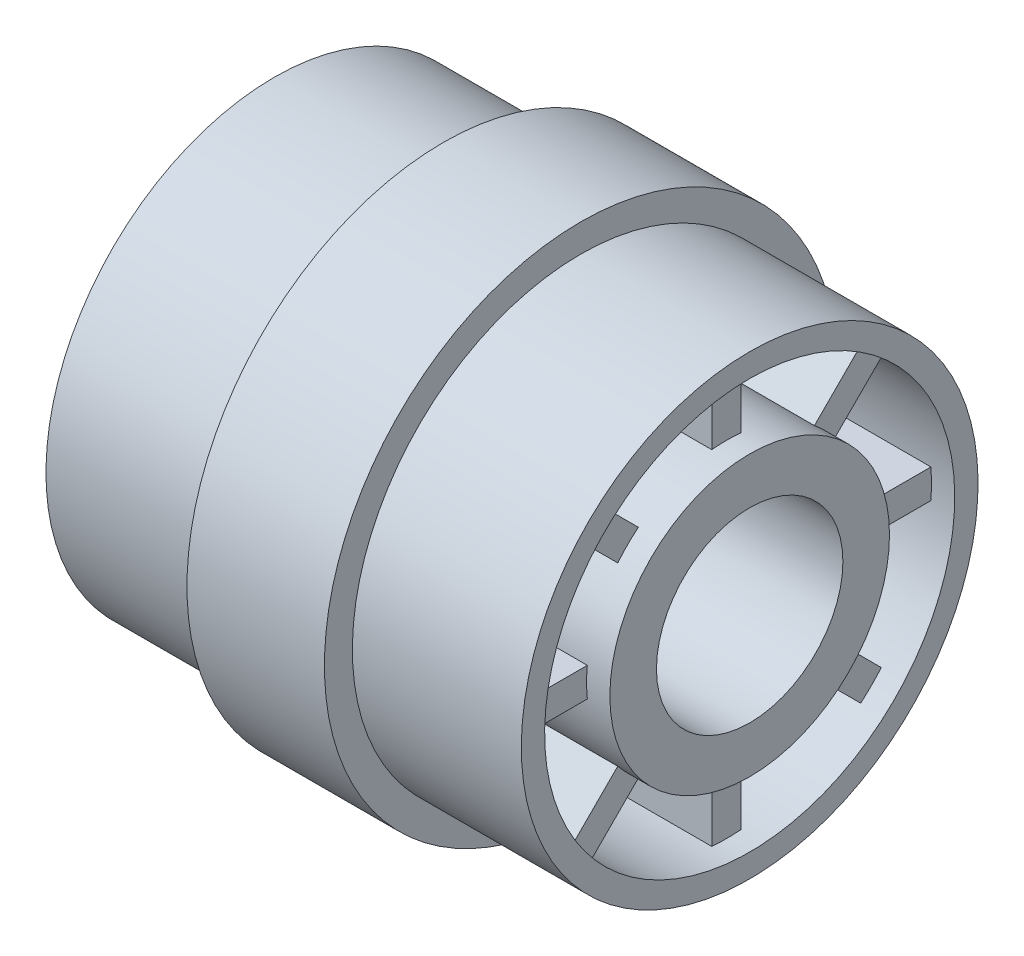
ISO-10303-21;
HEADER;
FILE_DESCRIPTION(('STEP AP214'),'2;1');
FILE_NAME('part.step','',(''),(''),'','','');
FILE_SCHEMA(('AUTOMOTIVE_DESIGN { 1 0 10303 214 1 1 1 1 }'));
ENDSEC;
DATA;
#1=APPLICATION_CONTEXT('core data for automotive mechanical design processes');
#2=APPLICATION_PROTOCOL_DEFINITION('international standard','automotive_design',2000,#1);
#3=PRODUCT_CONTEXT('',#1,'mechanical');
#4=PRODUCT('Part','Part','',(#3));
#5=PRODUCT_RELATED_PRODUCT_CATEGORY('part','',(#4));
#6=PRODUCT_DEFINITION_FORMATION('','',#4);
#7=PRODUCT_DEFINITION_CONTEXT('part definition',#1,'design');
#8=PRODUCT_DEFINITION('design','',#6,#7);
#9=PRODUCT_DEFINITION_SHAPE('','',#8);
#10=(LENGTH_UNIT() NAMED_UNIT(*) SI_UNIT(.MILLI.,.METRE.));
#11=(NAMED_UNIT(*) PLANE_ANGLE_UNIT() SI_UNIT($,.RADIAN.));
#12=(NAMED_UNIT(*) SI_UNIT($,.STERADIAN.) SOLID_ANGLE_UNIT());
#13=UNCERTAINTY_MEASURE_WITH_UNIT(LENGTH_MEASURE(1.E-05),#10,'distance_accuracy_value','');
#14=(GEOMETRIC_REPRESENTATION_CONTEXT(3) GLOBAL_UNCERTAINTY_ASSIGNED_CONTEXT((#13)) GLOBAL_UNIT_ASSIGNED_CONTEXT((#10,
#11,#12)) REPRESENTATION_CONTEXT('',''));
#15=CARTESIAN_POINT('',(0.,0.,0.));
#16=DIRECTION('',(0.,0.,1.));
#17=DIRECTION('',(1.,0.,0.));
#18=AXIS2_PLACEMENT_3D('',#15,#16,#17);
#19=CARTESIAN_POINT('',(-20.4,0.,0.));
#20=DIRECTION('',(1.,0.,0.));
#21=DIRECTION('',(0.,1.,0.));
#22=AXIS2_PLACEMENT_3D('',#19,#20,#21);
#23=CYLINDRICAL_SURFACE('',#22,22.);
#24=CARTESIAN_POINT('',(-14.5,0.,0.));
#25=DIRECTION('',(1.,0.,0.));
#26=DIRECTION('',(0.,1.,0.));
#27=AXIS2_PLACEMENT_3D('',#24,#25,#26);
#28=CIRCLE('',#27,22.);
#29=CARTESIAN_POINT('',(-14.5,22.,0.));
#30=VERTEX_POINT('',#29);
#31=EDGE_CURVE('E21',#30,#30,#28,.T.);
#32=ORIENTED_EDGE('',*,*,#31,.F.);
#33=EDGE_LOOP('',(#32));
#34=FACE_BOUND('',#33,.T.);
#35=CARTESIAN_POINT('',(-26.3,0.,0.));
#36=DIRECTION('',(1.,0.,0.));
#37=DIRECTION('',(0.,1.,0.));
#38=AXIS2_PLACEMENT_3D('',#35,#36,#37);
#39=CIRCLE('',#38,22.);
#40=CARTESIAN_POINT('',(-26.3,22.,0.));
#41=VERTEX_POINT('',#40);
#42=EDGE_CURVE('E1306',#41,#41,#39,.F.);
#43=ORIENTED_EDGE('',*,*,#42,.F.);
#44=EDGE_LOOP('',(#43));
#45=FACE_BOUND('',#44,.T.);
#46=ADVANCED_FACE('F17',(#34,#45),#23,.T.);
#47=CARTESIAN_POINT('',(-14.5,20.8,0.));
#48=DIRECTION('',(1.,0.,0.));
#49=DIRECTION('',(0.,0.,-1.));
#50=AXIS2_PLACEMENT_3D('',#47,#48,#49);
#51=PLANE('',#50);
#52=ORIENTED_EDGE('',*,*,#31,.T.);
#53=EDGE_LOOP('',(#52));
#54=FACE_BOUND('',#53,.T.);
#55=CARTESIAN_POINT('',(-14.5,0.,0.));
#56=DIRECTION('',(1.,0.,0.));
#57=DIRECTION('',(0.,1.,0.));
#58=AXIS2_PLACEMENT_3D('',#55,#56,#57);
#59=CIRCLE('',#58,19.6);
#60=CARTESIAN_POINT('',(-14.5,19.6,0.));
#61=VERTEX_POINT('',#60);
#62=EDGE_CURVE('E1304',#61,#61,#59,.T.);
#63=ORIENTED_EDGE('',*,*,#62,.F.);
#64=EDGE_LOOP('',(#63));
#65=FACE_BOUND('',#64,.T.);
#66=ADVANCED_FACE('F1313',(#54,#65),#51,.T.);
#67=CARTESIAN_POINT('',(-26.3,20.8,0.));
#68=DIRECTION('',(-1.,0.,0.));
#69=DIRECTION('',(0.,-1.,0.));
#70=AXIS2_PLACEMENT_3D('',#67,#68,#69);
#71=PLANE('',#70);
#72=CARTESIAN_POINT('',(-26.3,0.,0.));
#73=DIRECTION('',(1.,0.,0.));
#74=DIRECTION('',(0.,1.,0.));
#75=AXIS2_PLACEMENT_3D('',#72,#73,#74);
#76=CIRCLE('',#75,19.6);
#77=CARTESIAN_POINT('',(-26.3,19.6,0.));
#78=VERTEX_POINT('',#77);
#79=EDGE_CURVE('E1301',#78,#78,#76,.F.);
#80=ORIENTED_EDGE('',*,*,#79,.F.);
#81=EDGE_LOOP('',(#80));
#82=FACE_BOUND('',#81,.T.);
#83=ORIENTED_EDGE('',*,*,#42,.T.);
#84=EDGE_LOOP('',(#83));
#85=FACE_BOUND('',#84,.T.);
#86=ADVANCED_FACE('F1323',(#82,#85),#71,.T.);
#87=CARTESIAN_POINT('',(-7.24999999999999,0.,0.));
#88=DIRECTION('',(1.,0.,0.));
#89=DIRECTION('',(0.,1.,0.));
#90=AXIS2_PLACEMENT_3D('',#87,#88,#89);
#91=CYLINDRICAL_SURFACE('',#90,19.6);
#92=CARTESIAN_POINT('',(0.,0.,0.));
#93=DIRECTION('',(1.,0.,0.));
#94=DIRECTION('',(0.,1.,0.));
#95=AXIS2_PLACEMENT_3D('',#92,#93,#94);
#96=CIRCLE('',#95,19.6);
#97=CARTESIAN_POINT('',(0.,19.6,0.));
#98=VERTEX_POINT('',#97);
#99=EDGE_CURVE('E1298',#98,#98,#96,.T.);
#100=ORIENTED_EDGE('',*,*,#99,.F.);
#101=EDGE_LOOP('',(#100));
#102=FACE_BOUND('',#101,.T.);
#103=ORIENTED_EDGE('',*,*,#62,.T.);
#104=EDGE_LOOP('',(#103));
#105=FACE_BOUND('',#104,.T.);
#106=ADVANCED_FACE('F1747',(#102,#105),#91,.T.);
#107=CARTESIAN_POINT('',(-33.55,0.,0.));
#108=DIRECTION('',(1.,0.,0.));
#109=DIRECTION('',(0.,1.,0.));
#110=AXIS2_PLACEMENT_3D('',#107,#108,#109);
#111=CYLINDRICAL_SURFACE('',#110,19.6);
#112=ORIENTED_EDGE('',*,*,#79,.T.);
#113=EDGE_LOOP('',(#112));
#114=FACE_BOUND('',#113,.T.);
#115=CARTESIAN_POINT('',(-40.8,0.,0.));
#116=DIRECTION('',(1.,0.,0.));
#117=DIRECTION('',(0.,1.,0.));
#118=AXIS2_PLACEMENT_3D('',#115,#116,#117);
#119=CIRCLE('',#118,19.6);
#120=CARTESIAN_POINT('',(-40.8,19.6,0.));
#121=VERTEX_POINT('',#120);
#122=EDGE_CURVE('E1295',#121,#121,#119,.F.);
#123=ORIENTED_EDGE('',*,*,#122,.F.);
#124=EDGE_LOOP('',(#123));
#125=FACE_BOUND('',#124,.T.);
#126=ADVANCED_FACE('F1743',(#114,#125),#111,.T.);
#127=CARTESIAN_POINT('',(0.,9.8,0.));
#128=DIRECTION('',(1.,0.,0.));
#129=DIRECTION('',(0.,0.,-1.));
#130=AXIS2_PLACEMENT_3D('',#127,#128,#129);
#131=PLANE('',#130);
#132=CARTESIAN_POINT('',(0.,0.,0.));
#133=DIRECTION('',(1.,0.,0.));
#134=DIRECTION('',(0.,1.,0.));
#135=AXIS2_PLACEMENT_3D('',#132,#133,#134);
#136=CIRCLE('',#135,17.6);
#137=CARTESIAN_POINT('',(0.,17.6,0.));
#138=VERTEX_POINT('',#137);
#139=EDGE_CURVE('E1288',#138,#138,#136,.F.);
#140=ORIENTED_EDGE('',*,*,#139,.T.);
#141=EDGE_LOOP('',(#140));
#142=FACE_BOUND('',#141,.T.);
#143=ORIENTED_EDGE('',*,*,#99,.T.);
#144=EDGE_LOOP('',(#143));
#145=FACE_BOUND('',#144,.T.);
#146=ADVANCED_FACE('F1739',(#142,#145),#131,.T.);
#147=CARTESIAN_POINT('',(-40.8,9.79999999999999,0.));
#148=DIRECTION('',(-1.,0.,0.));
#149=DIRECTION('',(0.,-1.,0.));
#150=AXIS2_PLACEMENT_3D('',#147,#148,#149);
#151=PLANE('',#150);
#152=CARTESIAN_POINT('',(-40.8,0.,0.));
#153=DIRECTION('',(1.,0.,0.));
#154=DIRECTION('',(0.,1.,0.));
#155=AXIS2_PLACEMENT_3D('',#152,#153,#154);
#156=CIRCLE('',#155,17.6);
#157=CARTESIAN_POINT('',(-40.8,17.6,0.));
#158=VERTEX_POINT('',#157);
#159=EDGE_CURVE('E1279',#158,#158,#156,.T.);
#160=ORIENTED_EDGE('',*,*,#159,.T.);
#161=EDGE_LOOP('',(#160));
#162=FACE_BOUND('',#161,.T.);
#163=ORIENTED_EDGE('',*,*,#122,.T.);
#164=EDGE_LOOP('',(#163));
#165=FACE_BOUND('',#164,.T.);
#166=ADVANCED_FACE('F1736',(#162,#165),#151,.T.);
#167=CARTESIAN_POINT('',(-2.,0.,-14.76735913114));
#168=DIRECTION('',(1.,0.,0.));
#169=DIRECTION('',(0.,0.,-1.));
#170=AXIS2_PLACEMENT_3D('',#167,#168,#169);
#171=PLANE('',#170);
#172=DIRECTION('',(0.,0.,1.));
#173=VECTOR('',#172,1.);
#174=CARTESIAN_POINT('',(-1.99999999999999,-1.25,-17.5555546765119));
#175=LINE('',#174,#173);
#176=CARTESIAN_POINT('',(-1.99999999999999,-1.25,-17.5555546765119));
#177=VERTEX_POINT('',#176);
#178=CARTESIAN_POINT('',(-1.99999999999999,-1.25000000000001,-11.93471826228));
#179=VERTEX_POINT('',#178);
#180=EDGE_CURVE('E951',#177,#179,#175,.T.);
#181=ORIENTED_EDGE('',*,*,#180,.F.);
#182=CARTESIAN_POINT('',(-1.99999999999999,0.,0.));
#183=DIRECTION('',(1.,0.,0.));
#184=DIRECTION('',(0.,1.,0.));
#185=AXIS2_PLACEMENT_3D('',#182,#183,#184);
#186=CIRCLE('',#185,17.6);
#187=CARTESIAN_POINT('',(-2.,1.24999999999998,-17.5555546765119));
#188=VERTEX_POINT('',#187);
#189=EDGE_CURVE('E1291',#177,#188,#186,.T.);
#190=ORIENTED_EDGE('',*,*,#189,.T.);
#191=DIRECTION('',(0.,0.,1.));
#192=VECTOR('',#191,1.);
#193=CARTESIAN_POINT('',(-2.,1.24999999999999,-11.93471826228));
#194=LINE('',#193,#192);
#195=CARTESIAN_POINT('',(-2.,1.24999999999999,-11.93471826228));
#196=VERTEX_POINT('',#195);
#197=EDGE_CURVE('E948',#196,#188,#194,.F.);
#198=ORIENTED_EDGE('',*,*,#197,.F.);
#199=CARTESIAN_POINT('',(-1.99999999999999,0.,0.));
#200=DIRECTION('',(1.,0.,0.));
#201=DIRECTION('',(0.,1.,0.));
#202=AXIS2_PLACEMENT_3D('',#199,#200,#201);
#203=CIRCLE('',#202,12.);
#204=EDGE_CURVE('E102',#196,#179,#203,.F.);
#205=ORIENTED_EDGE('',*,*,#204,.T.);
#206=EDGE_LOOP('',(#181,#190,#198,#205));
#207=FACE_BOUND('',#206,.T.);
#208=ADVANCED_FACE('F1732',(#207),#171,.T.);
#209=CARTESIAN_POINT('',(-40.8,0.,0.));
#210=DIRECTION('',(1.,0.,0.));
#211=DIRECTION('',(0.,1.,0.));
#212=AXIS2_PLACEMENT_3D('',#209,#210,#211);
#213=CYLINDRICAL_SURFACE('',#212,17.6);
#214=ORIENTED_EDGE('',*,*,#139,.F.);
#215=EDGE_LOOP('',(#214));
#216=FACE_BOUND('',#215,.T.);
#217=CARTESIAN_POINT('',(-1.99999999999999,0.,0.));
#218=DIRECTION('',(1.,0.,0.));
#219=DIRECTION('',(0.,1.,0.));
#220=AXIS2_PLACEMENT_3D('',#217,#218,#219);
#221=CIRCLE('',#220,17.6);
#222=CARTESIAN_POINT('',(-1.99999999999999,1.24999999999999,17.5555546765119));
#223=VERTEX_POINT('',#222);
#224=CARTESIAN_POINT('',(-1.99999999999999,-1.25,17.5555546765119));
#225=VERTEX_POINT('',#224);
#226=EDGE_CURVE('E1103',#223,#225,#221,.T.);
#227=ORIENTED_EDGE('',*,*,#226,.F.);
#228=DIRECTION('',(1.,0.,0.));
#229=VECTOR('',#228,1.);
#230=CARTESIAN_POINT('',(-38.8,1.24999999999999,17.5555546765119));
#231=LINE('',#230,#229);
#232=CARTESIAN_POINT('',(-19.9,1.24999999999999,17.5555546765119));
#233=VERTEX_POINT('',#232);
#234=EDGE_CURVE('E903',#233,#223,#231,.T.);
#235=ORIENTED_EDGE('',*,*,#234,.F.);
#236=CARTESIAN_POINT('',(-19.9,0.,0.));
#237=DIRECTION('',(1.,0.,0.));
#238=DIRECTION('',(0.,1.,0.));
#239=AXIS2_PLACEMENT_3D('',#236,#237,#238);
#240=CIRCLE('',#239,17.6);
#241=CARTESIAN_POINT('',(-19.9,11.5297682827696,13.297535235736));
#242=VERTEX_POINT('',#241);
#243=EDGE_CURVE('E642',#242,#233,#240,.T.);
#244=ORIENTED_EDGE('',*,*,#243,.F.);
#245=DIRECTION('',(1.,0.,0.));
#246=VECTOR('',#245,1.);
#247=CARTESIAN_POINT('',(-38.8,11.5297682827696,13.297535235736));
#248=LINE('',#247,#246);
#249=CARTESIAN_POINT('',(-2.,11.5297682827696,13.297535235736));
#250=VERTEX_POINT('',#249);
#251=EDGE_CURVE('E909',#250,#242,#248,.F.);
#252=ORIENTED_EDGE('',*,*,#251,.F.);
#253=CARTESIAN_POINT('',(-1.99999999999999,0.,0.));
#254=DIRECTION('',(1.,0.,0.));
#255=DIRECTION('',(0.,1.,0.));
#256=AXIS2_PLACEMENT_3D('',#253,#254,#255);
#257=CIRCLE('',#256,17.6);
#258=CARTESIAN_POINT('',(-2.,13.297535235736,11.5297682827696));
#259=VERTEX_POINT('',#258);
#260=EDGE_CURVE('E636',#259,#250,#257,.T.);
#261=ORIENTED_EDGE('',*,*,#260,.F.);
#262=DIRECTION('',(1.,0.,0.));
#263=VECTOR('',#262,1.);
#264=CARTESIAN_POINT('',(-38.8,13.297535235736,11.5297682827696));
#265=LINE('',#264,#263);
#266=CARTESIAN_POINT('',(-19.9,13.297535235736,11.5297682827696));
#267=VERTEX_POINT('',#266);
#268=EDGE_CURVE('E637',#267,#259,#265,.T.);
#269=ORIENTED_EDGE('',*,*,#268,.F.);
#270=CARTESIAN_POINT('',(-19.9,0.,0.));
#271=DIRECTION('',(1.,0.,0.));
#272=DIRECTION('',(0.,1.,0.));
#273=AXIS2_PLACEMENT_3D('',#270,#271,#272);
#274=CIRCLE('',#273,17.6);
#275=CARTESIAN_POINT('',(-19.9,17.5555546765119,1.25));
#276=VERTEX_POINT('',#275);
#277=EDGE_CURVE('E625',#276,#267,#274,.T.);
#278=ORIENTED_EDGE('',*,*,#277,.F.);
#279=DIRECTION('',(1.,0.,0.));
#280=VECTOR('',#279,1.);
#281=CARTESIAN_POINT('',(-38.8,17.5555546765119,1.25));
#282=LINE('',#281,#280);
#283=CARTESIAN_POINT('',(-2.,17.5555546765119,1.25));
#284=VERTEX_POINT('',#283);
#285=EDGE_CURVE('E923',#284,#276,#282,.F.);
#286=ORIENTED_EDGE('',*,*,#285,.F.);
#287=CARTESIAN_POINT('',(-1.99999999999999,0.,0.));
#288=DIRECTION('',(1.,0.,0.));
#289=DIRECTION('',(0.,1.,0.));
#290=AXIS2_PLACEMENT_3D('',#287,#288,#289);
#291=CIRCLE('',#290,17.6);
#292=CARTESIAN_POINT('',(-2.,17.5555546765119,-1.25));
#293=VERTEX_POINT('',#292);
#294=EDGE_CURVE('E619',#293,#284,#291,.T.);
#295=ORIENTED_EDGE('',*,*,#294,.F.);
#296=DIRECTION('',(-1.,0.,0.));
#297=VECTOR('',#296,1.);
#298=CARTESIAN_POINT('',(-38.8,17.5555546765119,-1.25));
#299=LINE('',#298,#297);
#300=CARTESIAN_POINT('',(-19.9,17.5555546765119,-1.25));
#301=VERTEX_POINT('',#300);
#302=EDGE_CURVE('E620',#301,#293,#299,.F.);
#303=ORIENTED_EDGE('',*,*,#302,.F.);
#304=CARTESIAN_POINT('',(-19.9,0.,0.));
#305=DIRECTION('',(1.,0.,0.));
#306=DIRECTION('',(0.,1.,0.));
#307=AXIS2_PLACEMENT_3D('',#304,#305,#306);
#308=CIRCLE('',#307,17.6);
#309=CARTESIAN_POINT('',(-19.9,13.297535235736,-11.5297682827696));
#310=VERTEX_POINT('',#309);
#311=EDGE_CURVE('E608',#310,#301,#308,.T.);
#312=ORIENTED_EDGE('',*,*,#311,.F.);
#313=DIRECTION('',(1.,0.,0.));
#314=VECTOR('',#313,1.);
#315=CARTESIAN_POINT('',(-38.8,13.297535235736,-11.5297682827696));
#316=LINE('',#315,#314);
#317=CARTESIAN_POINT('',(-2.,13.297535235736,-11.5297682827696));
#318=VERTEX_POINT('',#317);
#319=EDGE_CURVE('E937',#318,#310,#316,.F.);
#320=ORIENTED_EDGE('',*,*,#319,.F.);
#321=CARTESIAN_POINT('',(-1.99999999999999,0.,0.));
#322=DIRECTION('',(1.,0.,0.));
#323=DIRECTION('',(0.,1.,0.));
#324=AXIS2_PLACEMENT_3D('',#321,#322,#323);
#325=CIRCLE('',#324,17.6);
#326=CARTESIAN_POINT('',(-2.,11.5297682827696,-13.297535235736));
#327=VERTEX_POINT('',#326);
#328=EDGE_CURVE('E602',#327,#318,#325,.T.);
#329=ORIENTED_EDGE('',*,*,#328,.F.);
#330=DIRECTION('',(1.,0.,0.));
#331=VECTOR('',#330,1.);
#332=CARTESIAN_POINT('',(-38.8,11.5297682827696,-13.297535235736));
#333=LINE('',#332,#331);
#334=CARTESIAN_POINT('',(-19.9,11.5297682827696,-13.297535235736));
#335=VERTEX_POINT('',#334);
#336=EDGE_CURVE('E603',#335,#327,#333,.T.);
#337=ORIENTED_EDGE('',*,*,#336,.F.);
#338=CARTESIAN_POINT('',(-19.9,0.,0.));
#339=DIRECTION('',(1.,0.,0.));
#340=DIRECTION('',(0.,1.,0.));
#341=AXIS2_PLACEMENT_3D('',#338,#339,#340);
#342=CIRCLE('',#341,17.6);
#343=CARTESIAN_POINT('',(-19.9,1.24999999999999,-17.5555546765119));
#344=VERTEX_POINT('',#343);
#345=EDGE_CURVE('E591',#344,#335,#342,.T.);
#346=ORIENTED_EDGE('',*,*,#345,.F.);
#347=DIRECTION('',(1.,0.,0.));
#348=VECTOR('',#347,1.);
#349=CARTESIAN_POINT('',(-38.8,1.24999999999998,-17.5555546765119));
#350=LINE('',#349,#348);
#351=EDGE_CURVE('E950',#188,#344,#350,.F.);
#352=ORIENTED_EDGE('',*,*,#351,.F.);
#353=ORIENTED_EDGE('',*,*,#189,.F.);
#354=DIRECTION('',(1.,0.,0.));
#355=VECTOR('',#354,1.);
#356=CARTESIAN_POINT('',(-38.8,-1.25000000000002,-17.5555546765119));
#357=LINE('',#356,#355);
#358=CARTESIAN_POINT('',(-19.9,-1.25000000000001,-17.5555546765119));
#359=VERTEX_POINT('',#358);
#360=EDGE_CURVE('E957',#359,#177,#357,.T.);
#361=ORIENTED_EDGE('',*,*,#360,.F.);
#362=CARTESIAN_POINT('',(-19.9,0.,0.));
#363=DIRECTION('',(1.,0.,0.));
#364=DIRECTION('',(0.,1.,0.));
#365=AXIS2_PLACEMENT_3D('',#362,#363,#364);
#366=CIRCLE('',#365,17.6);
#367=CARTESIAN_POINT('',(-19.9,-11.5297682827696,-13.297535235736));
#368=VERTEX_POINT('',#367);
#369=EDGE_CURVE('E579',#368,#359,#366,.T.);
#370=ORIENTED_EDGE('',*,*,#369,.F.);
#371=DIRECTION('',(1.,0.,0.));
#372=VECTOR('',#371,1.);
#373=CARTESIAN_POINT('',(-38.8,-11.5297682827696,-13.297535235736));
#374=LINE('',#373,#372);
#375=CARTESIAN_POINT('',(-2.,-11.5297682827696,-13.297535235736));
#376=VERTEX_POINT('',#375);
#377=EDGE_CURVE('E962',#376,#368,#374,.F.);
#378=ORIENTED_EDGE('',*,*,#377,.F.);
#379=CARTESIAN_POINT('',(-2.,0.,0.));
#380=DIRECTION('',(1.,0.,0.));
#381=DIRECTION('',(0.,1.,0.));
#382=AXIS2_PLACEMENT_3D('',#379,#380,#381);
#383=CIRCLE('',#382,17.6);
#384=CARTESIAN_POINT('',(-2.,-13.297535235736,-11.5297682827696));
#385=VERTEX_POINT('',#384);
#386=EDGE_CURVE('E573',#385,#376,#383,.T.);
#387=ORIENTED_EDGE('',*,*,#386,.F.);
#388=DIRECTION('',(1.,0.,0.));
#389=VECTOR('',#388,1.);
#390=CARTESIAN_POINT('',(-38.8,-13.297535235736,-11.5297682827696));
#391=LINE('',#390,#389);
#392=CARTESIAN_POINT('',(-19.9,-13.297535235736,-11.5297682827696));
#393=VERTEX_POINT('',#392);
#394=EDGE_CURVE('E574',#393,#385,#391,.T.);
#395=ORIENTED_EDGE('',*,*,#394,.F.);
#396=CARTESIAN_POINT('',(-19.9,0.,0.));
#397=DIRECTION('',(1.,0.,0.));
#398=DIRECTION('',(0.,1.,0.));
#399=AXIS2_PLACEMENT_3D('',#396,#397,#398);
#400=CIRCLE('',#399,17.6);
#401=CARTESIAN_POINT('',(-19.9,-17.555554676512,-1.25));
#402=VERTEX_POINT('',#401);
#403=EDGE_CURVE('E562',#402,#393,#400,.T.);
#404=ORIENTED_EDGE('',*,*,#403,.F.);
#405=DIRECTION('',(1.,0.,0.));
#406=VECTOR('',#405,1.);
#407=CARTESIAN_POINT('',(-38.8,-17.5555546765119,-1.25));
#408=LINE('',#407,#406);
#409=CARTESIAN_POINT('',(-1.99999999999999,-17.5555546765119,-1.25));
#410=VERTEX_POINT('',#409);
#411=EDGE_CURVE('E974',#410,#402,#408,.F.);
#412=ORIENTED_EDGE('',*,*,#411,.F.);
#413=CARTESIAN_POINT('',(-1.99999999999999,0.,0.));
#414=DIRECTION('',(1.,0.,0.));
#415=DIRECTION('',(0.,1.,0.));
#416=AXIS2_PLACEMENT_3D('',#413,#414,#415);
#417=CIRCLE('',#416,17.6);
#418=CARTESIAN_POINT('',(-1.99999999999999,-17.555554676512,1.25));
#419=VERTEX_POINT('',#418);
#420=EDGE_CURVE('E556',#419,#410,#417,.T.);
#421=ORIENTED_EDGE('',*,*,#420,.F.);
#422=DIRECTION('',(1.,0.,0.));
#423=VECTOR('',#422,1.);
#424=CARTESIAN_POINT('',(-38.8,-17.555554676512,1.25));
#425=LINE('',#424,#423);
#426=CARTESIAN_POINT('',(-19.9,-17.555554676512,1.25));
#427=VERTEX_POINT('',#426);
#428=EDGE_CURVE('E557',#427,#419,#425,.T.);
#429=ORIENTED_EDGE('',*,*,#428,.F.);
#430=CARTESIAN_POINT('',(-19.9,0.,0.));
#431=DIRECTION('',(1.,0.,0.));
#432=DIRECTION('',(0.,1.,0.));
#433=AXIS2_PLACEMENT_3D('',#430,#431,#432);
#434=CIRCLE('',#433,17.6);
#435=CARTESIAN_POINT('',(-19.9,-13.297535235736,11.5297682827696));
#436=VERTEX_POINT('',#435);
#437=EDGE_CURVE('E545',#436,#427,#434,.T.);
#438=ORIENTED_EDGE('',*,*,#437,.F.);
#439=DIRECTION('',(1.,0.,0.));
#440=VECTOR('',#439,1.);
#441=CARTESIAN_POINT('',(-38.8,-13.297535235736,11.5297682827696));
#442=LINE('',#441,#440);
#443=CARTESIAN_POINT('',(-2.,-13.297535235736,11.5297682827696));
#444=VERTEX_POINT('',#443);
#445=EDGE_CURVE('E986',#444,#436,#442,.F.);
#446=ORIENTED_EDGE('',*,*,#445,.F.);
#447=CARTESIAN_POINT('',(-2.00000000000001,0.,0.));
#448=DIRECTION('',(1.,0.,0.));
#449=DIRECTION('',(0.,1.,0.));
#450=AXIS2_PLACEMENT_3D('',#447,#448,#449);
#451=CIRCLE('',#450,17.6);
#452=CARTESIAN_POINT('',(-2.,-11.5297682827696,13.297535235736));
#453=VERTEX_POINT('',#452);
#454=EDGE_CURVE('E539',#453,#444,#451,.T.);
#455=ORIENTED_EDGE('',*,*,#454,.F.);
#456=DIRECTION('',(1.,0.,0.));
#457=VECTOR('',#456,1.);
#458=CARTESIAN_POINT('',(-38.8,-11.5297682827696,13.297535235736));
#459=LINE('',#458,#457);
#460=CARTESIAN_POINT('',(-19.9,-11.5297682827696,13.297535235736));
#461=VERTEX_POINT('',#460);
#462=EDGE_CURVE('E540',#461,#453,#459,.T.);
#463=ORIENTED_EDGE('',*,*,#462,.F.);
#464=CARTESIAN_POINT('',(-19.9,0.,0.));
#465=DIRECTION('',(1.,0.,0.));
#466=DIRECTION('',(0.,1.,0.));
#467=AXIS2_PLACEMENT_3D('',#464,#465,#466);
#468=CIRCLE('',#467,17.6);
#469=CARTESIAN_POINT('',(-19.9,-1.25,17.5555546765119));
#470=VERTEX_POINT('',#469);
#471=EDGE_CURVE('E1273',#470,#461,#468,.T.);
#472=ORIENTED_EDGE('',*,*,#471,.F.);
#473=DIRECTION('',(1.,0.,0.));
#474=VECTOR('',#473,1.);
#475=CARTESIAN_POINT('',(-38.8,-1.25000000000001,17.5555546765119));
#476=LINE('',#475,#474);
#477=EDGE_CURVE('E525',#225,#470,#476,.F.);
#478=ORIENTED_EDGE('',*,*,#477,.F.);
#479=EDGE_LOOP('',(#227,#235,#244,#252,#261,#269,#278,#286,#295,#303,#312,#320,#329,#337,#346,
#352,#353,#361,#370,#378,#387,#395,#404,#412,#421,#429,#438,#446,#455,#463,#472,#478));
#480=FACE_BOUND('',#479,.T.);
#481=ADVANCED_FACE('F1728',(#216,#480),#213,.F.);
#482=CARTESIAN_POINT('',(-2.,0.,14.76735913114));
#483=DIRECTION('',(1.,0.,0.));
#484=DIRECTION('',(0.,0.,-1.));
#485=AXIS2_PLACEMENT_3D('',#482,#483,#484);
#486=PLANE('',#485);
#487=DIRECTION('',(0.,0.,1.));
#488=VECTOR('',#487,1.);
#489=CARTESIAN_POINT('',(-1.99999999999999,1.24999999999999,17.5555546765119));
#490=LINE('',#489,#488);
#491=CARTESIAN_POINT('',(-2.,1.25,11.93471826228));
#492=VERTEX_POINT('',#491);
#493=EDGE_CURVE('E895',#223,#492,#490,.F.);
#494=ORIENTED_EDGE('',*,*,#493,.F.);
#495=ORIENTED_EDGE('',*,*,#226,.T.);
#496=DIRECTION('',(0.,0.,-1.));
#497=VECTOR('',#496,1.);
#498=CARTESIAN_POINT('',(-1.99999999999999,-1.25,11.93471826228));
#499=LINE('',#498,#497);
#500=CARTESIAN_POINT('',(-1.99999999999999,-1.25,11.93471826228));
#501=VERTEX_POINT('',#500);
#502=EDGE_CURVE('E997',#501,#225,#499,.F.);
#503=ORIENTED_EDGE('',*,*,#502,.F.);
#504=CARTESIAN_POINT('',(-2.,0.,0.));
#505=DIRECTION('',(1.,0.,0.));
#506=DIRECTION('',(0.,1.,0.));
#507=AXIS2_PLACEMENT_3D('',#504,#505,#506);
#508=CIRCLE('',#507,12.);
#509=EDGE_CURVE('E1286',#501,#492,#508,.F.);
#510=ORIENTED_EDGE('',*,*,#509,.T.);
#511=EDGE_LOOP('',(#494,#495,#503,#510));
#512=FACE_BOUND('',#511,.T.);
#513=ADVANCED_FACE('F1724',(#512),#486,.T.);
#514=CARTESIAN_POINT('',(-20.4,6.97570765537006,11.6145961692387));
#515=DIRECTION('',(0.,0.923879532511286,-0.382683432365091));
#516=DIRECTION('',(0.,0.382683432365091,0.923879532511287));
#517=AXIS2_PLACEMENT_3D('',#514,#515,#516);
#518=PLANE('',#517);
#519=DIRECTION('',(-1.,0.,0.));
#520=VECTOR('',#519,1.);
#521=CARTESIAN_POINT('',(-20.4,6.97570765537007,11.6145961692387));
#522=LINE('',#521,#520);
#523=CARTESIAN_POINT('',(-20.9,6.97570765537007,11.6145961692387));
#524=VERTEX_POINT('',#523);
#525=CARTESIAN_POINT('',(-19.9,6.97570765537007,11.6145961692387));
#526=VERTEX_POINT('',#525);
#527=EDGE_CURVE('E1100',#524,#526,#522,.F.);
#528=ORIENTED_EDGE('',*,*,#527,.T.);
#529=DIRECTION('',(0.,-0.382683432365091,-0.923879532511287));
#530=VECTOR('',#529,1.);
#531=CARTESIAN_POINT('',(-19.9,7.94134090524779,13.9458410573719));
#532=LINE('',#531,#530);
#533=CARTESIAN_POINT('',(-19.9,7.94134090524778,13.9458410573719));
#534=VERTEX_POINT('',#533);
#535=EDGE_CURVE('E647',#534,#526,#532,.T.);
#536=ORIENTED_EDGE('',*,*,#535,.F.);
#537=DIRECTION('',(-1.,0.,0.));
#538=VECTOR('',#537,1.);
#539=CARTESIAN_POINT('',(-20.4,7.94134090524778,13.9458410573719));
#540=LINE('',#539,#538);
#541=CARTESIAN_POINT('',(-20.9,7.94134090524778,13.9458410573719));
#542=VERTEX_POINT('',#541);
#543=EDGE_CURVE('E1090',#534,#542,#540,.T.);
#544=ORIENTED_EDGE('',*,*,#543,.T.);
#545=DIRECTION('',(0.,-0.382683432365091,-0.923879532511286));
#546=VECTOR('',#545,1.);
#547=CARTESIAN_POINT('',(-20.9,7.94134090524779,13.9458410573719));
#548=LINE('',#547,#546);
#549=EDGE_CURVE('E660',#542,#524,#548,.T.);
#550=ORIENTED_EDGE('',*,*,#549,.T.);
#551=EDGE_LOOP('',(#528,#536,#544,#550));
#552=FACE_BOUND('',#551,.T.);
#553=ADVANCED_FACE('F1720',(#552),#518,.F.);
#554=CARTESIAN_POINT('',(-19.9,0.,0.));
#555=DIRECTION('',(-1.,0.,0.));
#556=DIRECTION('',(0.,-1.,0.));
#557=AXIS2_PLACEMENT_3D('',#554,#555,#556);
#558=CYLINDRICAL_SURFACE('',#557,13.5484073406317);
#559=DIRECTION('',(1.,0.,0.));
#560=VECTOR('',#559,1.);
#561=CARTESIAN_POINT('',(-20.4,3.28018952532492,13.1453298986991));
#562=LINE('',#561,#560);
#563=CARTESIAN_POINT('',(-20.9,3.28018952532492,13.1453298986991));
#564=VERTEX_POINT('',#563);
#565=CARTESIAN_POINT('',(-19.9,3.28018952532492,13.1453298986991));
#566=VERTEX_POINT('',#565);
#567=EDGE_CURVE('E1097',#564,#566,#562,.T.);
#568=ORIENTED_EDGE('',*,*,#567,.T.);
#569=CARTESIAN_POINT('',(-19.9,0.,0.));
#570=DIRECTION('',(-1.,0.,0.));
#571=DIRECTION('',(0.,-1.,0.));
#572=AXIS2_PLACEMENT_3D('',#569,#570,#571);
#573=CIRCLE('',#572,13.5484073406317);
#574=EDGE_CURVE('E646',#526,#566,#573,.F.);
#575=ORIENTED_EDGE('',*,*,#574,.F.);
#576=ORIENTED_EDGE('',*,*,#527,.F.);
#577=CARTESIAN_POINT('',(-20.9,0.,0.));
#578=DIRECTION('',(-1.,0.,0.));
#579=DIRECTION('',(0.,-1.,0.));
#580=AXIS2_PLACEMENT_3D('',#577,#578,#579);
#581=CIRCLE('',#580,13.5484073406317);
#582=EDGE_CURVE('E659',#524,#564,#581,.F.);
#583=ORIENTED_EDGE('',*,*,#582,.T.);
#584=EDGE_LOOP('',(#568,#575,#576,#583));
#585=FACE_BOUND('',#584,.T.);
#586=ADVANCED_FACE('F1716',(#585),#558,.T.);
#587=CARTESIAN_POINT('',(-20.4,4.24582277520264,15.4765747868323));
#588=DIRECTION('',(0.,-0.923879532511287,0.38268343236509));
#589=DIRECTION('',(0.,-0.38268343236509,-0.923879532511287));
#590=AXIS2_PLACEMENT_3D('',#587,#588,#589);
#591=PLANE('',#590);
#592=DIRECTION('',(-1.,0.,0.));
#593=VECTOR('',#592,1.);
#594=CARTESIAN_POINT('',(-20.4,4.24582277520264,15.4765747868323));
#595=LINE('',#594,#593);
#596=CARTESIAN_POINT('',(-20.9,4.24582277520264,15.4765747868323));
#597=VERTEX_POINT('',#596);
#598=CARTESIAN_POINT('',(-19.9,4.24582277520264,15.4765747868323));
#599=VERTEX_POINT('',#598);
#600=EDGE_CURVE('E1095',#597,#599,#595,.F.);
#601=ORIENTED_EDGE('',*,*,#600,.T.);
#602=DIRECTION('',(0.,0.38268343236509,0.923879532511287));
#603=VECTOR('',#602,1.);
#604=CARTESIAN_POINT('',(-19.9,3.28018952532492,13.1453298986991));
#605=LINE('',#604,#603);
#606=EDGE_CURVE('E643',#566,#599,#605,.T.);
#607=ORIENTED_EDGE('',*,*,#606,.F.);
#608=ORIENTED_EDGE('',*,*,#567,.F.);
#609=DIRECTION('',(0.,0.38268343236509,0.923879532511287));
#610=VECTOR('',#609,1.);
#611=CARTESIAN_POINT('',(-20.9,3.28018952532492,13.1453298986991));
#612=LINE('',#611,#610);
#613=EDGE_CURVE('E655',#564,#597,#612,.T.);
#614=ORIENTED_EDGE('',*,*,#613,.T.);
#615=EDGE_LOOP('',(#601,#607,#608,#614));
#616=FACE_BOUND('',#615,.T.);
#617=ADVANCED_FACE('F1712',(#616),#591,.F.);
#618=CARTESIAN_POINT('',(-20.4,0.,0.));
#619=DIRECTION('',(-1.,0.,0.));
#620=DIRECTION('',(0.,0.,1.));
#621=AXIS2_PLACEMENT_3D('',#618,#619,#620);
#622=CYLINDRICAL_SURFACE('',#621,16.0484073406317);
#623=ORIENTED_EDGE('',*,*,#543,.F.);
#624=CARTESIAN_POINT('',(-19.9,0.,0.));
#625=DIRECTION('',(-1.,0.,0.));
#626=DIRECTION('',(0.,0.,1.));
#627=AXIS2_PLACEMENT_3D('',#624,#625,#626);
#628=CIRCLE('',#627,16.0484073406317);
#629=EDGE_CURVE('E649',#599,#534,#628,.T.);
#630=ORIENTED_EDGE('',*,*,#629,.F.);
#631=ORIENTED_EDGE('',*,*,#600,.F.);
#632=CARTESIAN_POINT('',(-20.9,0.,0.));
#633=DIRECTION('',(-1.,0.,0.));
#634=DIRECTION('',(0.,0.,1.));
#635=AXIS2_PLACEMENT_3D('',#632,#633,#634);
#636=CIRCLE('',#635,16.0484073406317);
#637=EDGE_CURVE('E658',#597,#542,#636,.T.);
#638=ORIENTED_EDGE('',*,*,#637,.T.);
#639=EDGE_LOOP('',(#623,#630,#631,#638));
#640=FACE_BOUND('',#639,.T.);
#641=ADVANCED_FACE('F1708',(#640),#622,.F.);
#642=CARTESIAN_POINT('',(-20.4,13.1453298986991,3.28018952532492));
#643=DIRECTION('',(0.,0.382683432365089,-0.923879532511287));
#644=DIRECTION('',(0.,0.923879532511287,0.382683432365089));
#645=AXIS2_PLACEMENT_3D('',#642,#643,#644);
#646=PLANE('',#645);
#647=DIRECTION('',(-1.,0.,0.));
#648=VECTOR('',#647,1.);
#649=CARTESIAN_POINT('',(-20.4,13.1453298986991,3.28018952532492));
#650=LINE('',#649,#648);
#651=CARTESIAN_POINT('',(-20.9,13.1453298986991,3.28018952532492));
#652=VERTEX_POINT('',#651);
#653=CARTESIAN_POINT('',(-19.9,13.1453298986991,3.28018952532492));
#654=VERTEX_POINT('',#653);
#655=EDGE_CURVE('E1087',#652,#654,#650,.F.);
#656=ORIENTED_EDGE('',*,*,#655,.T.);
#657=DIRECTION('',(0.,-0.923879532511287,-0.382683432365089));
#658=VECTOR('',#657,1.);
#659=CARTESIAN_POINT('',(-19.9,15.4765747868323,4.24582277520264));
#660=LINE('',#659,#658);
#661=CARTESIAN_POINT('',(-19.9,15.4765747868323,4.24582277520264));
#662=VERTEX_POINT('',#661);
#663=EDGE_CURVE('E630',#662,#654,#660,.T.);
#664=ORIENTED_EDGE('',*,*,#663,.F.);
#665=DIRECTION('',(-1.,0.,0.));
#666=VECTOR('',#665,1.);
#667=CARTESIAN_POINT('',(-20.4,15.4765747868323,4.24582277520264));
#668=LINE('',#667,#666);
#669=CARTESIAN_POINT('',(-20.9,15.4765747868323,4.24582277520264));
#670=VERTEX_POINT('',#669);
#671=EDGE_CURVE('E1077',#662,#670,#668,.T.);
#672=ORIENTED_EDGE('',*,*,#671,.T.);
#673=DIRECTION('',(0.,-0.923879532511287,-0.382683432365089));
#674=VECTOR('',#673,1.);
#675=CARTESIAN_POINT('',(-20.9,15.4765747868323,4.24582277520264));
#676=LINE('',#675,#674);
#677=EDGE_CURVE('E679',#670,#652,#676,.T.);
#678=ORIENTED_EDGE('',*,*,#677,.T.);
#679=EDGE_LOOP('',(#656,#664,#672,#678));
#680=FACE_BOUND('',#679,.T.);
#681=ADVANCED_FACE('F1704',(#680),#646,.F.);
#682=CARTESIAN_POINT('',(-19.9,0.,0.));
#683=DIRECTION('',(-1.,0.,0.));
#684=DIRECTION('',(0.,0.,1.));
#685=AXIS2_PLACEMENT_3D('',#682,#683,#684);
#686=CYLINDRICAL_SURFACE('',#685,13.5484073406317);
#687=DIRECTION('',(1.,0.,0.));
#688=VECTOR('',#687,1.);
#689=CARTESIAN_POINT('',(-20.4,11.6145961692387,6.97570765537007));
#690=LINE('',#689,#688);
#691=CARTESIAN_POINT('',(-20.9,11.6145961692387,6.97570765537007));
#692=VERTEX_POINT('',#691);
#693=CARTESIAN_POINT('',(-19.9,11.6145961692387,6.97570765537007));
#694=VERTEX_POINT('',#693);
#695=EDGE_CURVE('E1084',#692,#694,#690,.T.);
#696=ORIENTED_EDGE('',*,*,#695,.T.);
#697=CARTESIAN_POINT('',(-19.9,0.,0.));
#698=DIRECTION('',(-1.,0.,0.));
#699=DIRECTION('',(0.,0.,1.));
#700=AXIS2_PLACEMENT_3D('',#697,#698,#699);
#701=CIRCLE('',#700,13.5484073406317);
#702=EDGE_CURVE('E629',#654,#694,#701,.F.);
#703=ORIENTED_EDGE('',*,*,#702,.F.);
#704=ORIENTED_EDGE('',*,*,#655,.F.);
#705=CARTESIAN_POINT('',(-20.9,0.,0.));
#706=DIRECTION('',(-1.,0.,0.));
#707=DIRECTION('',(0.,0.,1.));
#708=AXIS2_PLACEMENT_3D('',#705,#706,#707);
#709=CIRCLE('',#708,13.5484073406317);
#710=EDGE_CURVE('E678',#652,#692,#709,.F.);
#711=ORIENTED_EDGE('',*,*,#710,.T.);
#712=EDGE_LOOP('',(#696,#703,#704,#711));
#713=FACE_BOUND('',#712,.T.);
#714=ADVANCED_FACE('F1700',(#713),#686,.T.);
#715=CARTESIAN_POINT('',(-20.4,13.9458410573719,7.94134090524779));
#716=DIRECTION('',(0.,-0.38268343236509,0.923879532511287));
#717=DIRECTION('',(0.,-0.923879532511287,-0.38268343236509));
#718=AXIS2_PLACEMENT_3D('',#715,#716,#717);
#719=PLANE('',#718);
#720=DIRECTION('',(-1.,0.,0.));
#721=VECTOR('',#720,1.);
#722=CARTESIAN_POINT('',(-20.4,13.9458410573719,7.94134090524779));
#723=LINE('',#722,#721);
#724=CARTESIAN_POINT('',(-20.9,13.9458410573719,7.94134090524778));
#725=VERTEX_POINT('',#724);
#726=CARTESIAN_POINT('',(-19.9,13.9458410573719,7.94134090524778));
#727=VERTEX_POINT('',#726);
#728=EDGE_CURVE('E1082',#725,#727,#723,.F.);
#729=ORIENTED_EDGE('',*,*,#728,.T.);
#730=DIRECTION('',(0.,0.923879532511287,0.382683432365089));
#731=VECTOR('',#730,1.);
#732=CARTESIAN_POINT('',(-19.9,11.6145961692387,6.97570765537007));
#733=LINE('',#732,#731);
#734=EDGE_CURVE('E626',#694,#727,#733,.T.);
#735=ORIENTED_EDGE('',*,*,#734,.F.);
#736=ORIENTED_EDGE('',*,*,#695,.F.);
#737=DIRECTION('',(0.,0.923879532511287,0.382683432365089));
#738=VECTOR('',#737,1.);
#739=CARTESIAN_POINT('',(-20.9,11.6145961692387,6.97570765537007));
#740=LINE('',#739,#738);
#741=EDGE_CURVE('E674',#692,#725,#740,.T.);
#742=ORIENTED_EDGE('',*,*,#741,.T.);
#743=EDGE_LOOP('',(#729,#735,#736,#742));
#744=FACE_BOUND('',#743,.T.);
#745=ADVANCED_FACE('F1696',(#744),#719,.F.);
#746=CARTESIAN_POINT('',(-20.4,0.,0.));
#747=DIRECTION('',(-1.,0.,0.));
#748=DIRECTION('',(0.,0.,1.));
#749=AXIS2_PLACEMENT_3D('',#746,#747,#748);
#750=CYLINDRICAL_SURFACE('',#749,16.0484073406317);
#751=ORIENTED_EDGE('',*,*,#671,.F.);
#752=CARTESIAN_POINT('',(-19.9,0.,0.));
#753=DIRECTION('',(-1.,0.,0.));
#754=DIRECTION('',(0.,0.,1.));
#755=AXIS2_PLACEMENT_3D('',#752,#753,#754);
#756=CIRCLE('',#755,16.0484073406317);
#757=EDGE_CURVE('E632',#727,#662,#756,.T.);
#758=ORIENTED_EDGE('',*,*,#757,.F.);
#759=ORIENTED_EDGE('',*,*,#728,.F.);
#760=CARTESIAN_POINT('',(-20.9,0.,0.));
#761=DIRECTION('',(-1.,0.,0.));
#762=DIRECTION('',(0.,0.,1.));
#763=AXIS2_PLACEMENT_3D('',#760,#761,#762);
#764=CIRCLE('',#763,16.0484073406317);
#765=EDGE_CURVE('E677',#725,#670,#764,.T.);
#766=ORIENTED_EDGE('',*,*,#765,.T.);
#767=EDGE_LOOP('',(#751,#758,#759,#766));
#768=FACE_BOUND('',#767,.T.);
#769=ADVANCED_FACE('F1692',(#768),#750,.F.);
#770=CARTESIAN_POINT('',(-20.4,11.6145961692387,-6.97570765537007));
#771=DIRECTION('',(0.,-0.38268343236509,-0.923879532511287));
#772=DIRECTION('',(0.,0.923879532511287,-0.38268343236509));
#773=AXIS2_PLACEMENT_3D('',#770,#771,#772);
#774=PLANE('',#773);
#775=DIRECTION('',(-1.,0.,0.));
#776=VECTOR('',#775,1.);
#777=CARTESIAN_POINT('',(-20.4,11.6145961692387,-6.97570765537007));
#778=LINE('',#777,#776);
#779=CARTESIAN_POINT('',(-20.9,11.6145961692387,-6.97570765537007));
#780=VERTEX_POINT('',#779);
#781=CARTESIAN_POINT('',(-19.9,11.6145961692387,-6.97570765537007));
#782=VERTEX_POINT('',#781);
#783=EDGE_CURVE('E1074',#780,#782,#778,.F.);
#784=ORIENTED_EDGE('',*,*,#783,.T.);
#785=DIRECTION('',(0.,-0.923879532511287,0.382683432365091));
#786=VECTOR('',#785,1.);
#787=CARTESIAN_POINT('',(-19.9,13.9458410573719,-7.94134090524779));
#788=LINE('',#787,#786);
#789=CARTESIAN_POINT('',(-19.9,13.9458410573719,-7.94134090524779));
#790=VERTEX_POINT('',#789);
#791=EDGE_CURVE('E613',#790,#782,#788,.T.);
#792=ORIENTED_EDGE('',*,*,#791,.F.);
#793=DIRECTION('',(-1.,0.,0.));
#794=VECTOR('',#793,1.);
#795=CARTESIAN_POINT('',(-20.4,13.9458410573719,-7.94134090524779));
#796=LINE('',#795,#794);
#797=CARTESIAN_POINT('',(-20.9,13.9458410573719,-7.94134090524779));
#798=VERTEX_POINT('',#797);
#799=EDGE_CURVE('E1064',#790,#798,#796,.T.);
#800=ORIENTED_EDGE('',*,*,#799,.T.);
#801=DIRECTION('',(0.,-0.923879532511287,0.382683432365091));
#802=VECTOR('',#801,1.);
#803=CARTESIAN_POINT('',(-20.9,13.9458410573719,-7.94134090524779));
#804=LINE('',#803,#802);
#805=EDGE_CURVE('E698',#798,#780,#804,.T.);
#806=ORIENTED_EDGE('',*,*,#805,.T.);
#807=EDGE_LOOP('',(#784,#792,#800,#806));
#808=FACE_BOUND('',#807,.T.);
#809=ADVANCED_FACE('F1688',(#808),#774,.F.);
#810=CARTESIAN_POINT('',(-19.9,0.,0.));
#811=DIRECTION('',(-1.,0.,0.));
#812=DIRECTION('',(0.,0.,1.));
#813=AXIS2_PLACEMENT_3D('',#810,#811,#812);
#814=CYLINDRICAL_SURFACE('',#813,13.5484073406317);
#815=DIRECTION('',(1.,0.,0.));
#816=VECTOR('',#815,1.);
#817=CARTESIAN_POINT('',(-20.4,13.1453298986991,-3.28018952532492));
#818=LINE('',#817,#816);
#819=CARTESIAN_POINT('',(-20.9,13.1453298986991,-3.28018952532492));
#820=VERTEX_POINT('',#819);
#821=CARTESIAN_POINT('',(-19.9,13.1453298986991,-3.28018952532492));
#822=VERTEX_POINT('',#821);
#823=EDGE_CURVE('E1071',#820,#822,#818,.T.);
#824=ORIENTED_EDGE('',*,*,#823,.T.);
#825=CARTESIAN_POINT('',(-19.9,0.,0.));
#826=DIRECTION('',(-1.,0.,0.));
#827=DIRECTION('',(0.,0.,1.));
#828=AXIS2_PLACEMENT_3D('',#825,#826,#827);
#829=CIRCLE('',#828,13.5484073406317);
#830=EDGE_CURVE('E612',#782,#822,#829,.F.);
#831=ORIENTED_EDGE('',*,*,#830,.F.);
#832=ORIENTED_EDGE('',*,*,#783,.F.);
#833=CARTESIAN_POINT('',(-20.9,0.,0.));
#834=DIRECTION('',(-1.,0.,0.));
#835=DIRECTION('',(0.,0.,1.));
#836=AXIS2_PLACEMENT_3D('',#833,#834,#835);
#837=CIRCLE('',#836,13.5484073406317);
#838=EDGE_CURVE('E697',#780,#820,#837,.F.);
#839=ORIENTED_EDGE('',*,*,#838,.T.);
#840=EDGE_LOOP('',(#824,#831,#832,#839));
#841=FACE_BOUND('',#840,.T.);
#842=ADVANCED_FACE('F1684',(#841),#814,.T.);
#843=CARTESIAN_POINT('',(-20.4,15.4765747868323,-4.24582277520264));
#844=DIRECTION('',(0.,0.38268343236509,0.923879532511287));
#845=DIRECTION('',(0.,-0.923879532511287,0.38268343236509));
#846=AXIS2_PLACEMENT_3D('',#843,#844,#845);
#847=PLANE('',#846);
#848=DIRECTION('',(-1.,0.,0.));
#849=VECTOR('',#848,1.);
#850=CARTESIAN_POINT('',(-20.4,15.4765747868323,-4.24582277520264));
#851=LINE('',#850,#849);
#852=CARTESIAN_POINT('',(-20.9,15.4765747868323,-4.24582277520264));
#853=VERTEX_POINT('',#852);
#854=CARTESIAN_POINT('',(-19.9,15.4765747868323,-4.24582277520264));
#855=VERTEX_POINT('',#854);
#856=EDGE_CURVE('E1069',#853,#855,#851,.F.);
#857=ORIENTED_EDGE('',*,*,#856,.T.);
#858=DIRECTION('',(0.,0.923879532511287,-0.38268343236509));
#859=VECTOR('',#858,1.);
#860=CARTESIAN_POINT('',(-19.9,13.1453298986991,-3.28018952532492));
#861=LINE('',#860,#859);
#862=EDGE_CURVE('E609',#822,#855,#861,.T.);
#863=ORIENTED_EDGE('',*,*,#862,.F.);
#864=ORIENTED_EDGE('',*,*,#823,.F.);
#865=DIRECTION('',(0.,0.923879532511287,-0.38268343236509));
#866=VECTOR('',#865,1.);
#867=CARTESIAN_POINT('',(-20.9,13.1453298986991,-3.28018952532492));
#868=LINE('',#867,#866);
#869=EDGE_CURVE('E693',#820,#853,#868,.T.);
#870=ORIENTED_EDGE('',*,*,#869,.T.);
#871=EDGE_LOOP('',(#857,#863,#864,#870));
#872=FACE_BOUND('',#871,.T.);
#873=ADVANCED_FACE('F1680',(#872),#847,.F.);
#874=CARTESIAN_POINT('',(-20.4,0.,0.));
#875=DIRECTION('',(-1.,0.,0.));
#876=DIRECTION('',(0.,0.,1.));
#877=AXIS2_PLACEMENT_3D('',#874,#875,#876);
#878=CYLINDRICAL_SURFACE('',#877,16.0484073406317);
#879=ORIENTED_EDGE('',*,*,#799,.F.);
#880=CARTESIAN_POINT('',(-19.9,0.,0.));
#881=DIRECTION('',(-1.,0.,0.));
#882=DIRECTION('',(0.,0.,1.));
#883=AXIS2_PLACEMENT_3D('',#880,#881,#882);
#884=CIRCLE('',#883,16.0484073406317);
#885=EDGE_CURVE('E615',#855,#790,#884,.T.);
#886=ORIENTED_EDGE('',*,*,#885,.F.);
#887=ORIENTED_EDGE('',*,*,#856,.F.);
#888=CARTESIAN_POINT('',(-20.9,0.,0.));
#889=DIRECTION('',(-1.,0.,0.));
#890=DIRECTION('',(0.,0.,1.));
#891=AXIS2_PLACEMENT_3D('',#888,#889,#890);
#892=CIRCLE('',#891,16.0484073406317);
#893=EDGE_CURVE('E696',#853,#798,#892,.T.);
#894=ORIENTED_EDGE('',*,*,#893,.T.);
#895=EDGE_LOOP('',(#879,#886,#887,#894));
#896=FACE_BOUND('',#895,.T.);
#897=ADVANCED_FACE('F1676',(#896),#878,.F.);
#898=CARTESIAN_POINT('',(-20.4,3.28018952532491,-13.1453298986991));
#899=DIRECTION('',(0.,-0.923879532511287,-0.382683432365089));
#900=DIRECTION('',(0.,0.382683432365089,-0.923879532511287));
#901=AXIS2_PLACEMENT_3D('',#898,#899,#900);
#902=PLANE('',#901);
#903=DIRECTION('',(-1.,0.,0.));
#904=VECTOR('',#903,1.);
#905=CARTESIAN_POINT('',(-20.4,3.28018952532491,-13.1453298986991));
#906=LINE('',#905,#904);
#907=CARTESIAN_POINT('',(-20.9,3.28018952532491,-13.1453298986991));
#908=VERTEX_POINT('',#907);
#909=CARTESIAN_POINT('',(-19.9,3.28018952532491,-13.1453298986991));
#910=VERTEX_POINT('',#909);
#911=EDGE_CURVE('E1061',#908,#910,#906,.F.);
#912=ORIENTED_EDGE('',*,*,#911,.T.);
#913=DIRECTION('',(0.,-0.382683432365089,0.923879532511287));
#914=VECTOR('',#913,1.);
#915=CARTESIAN_POINT('',(-19.9,4.24582277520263,-15.4765747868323));
#916=LINE('',#915,#914);
#917=CARTESIAN_POINT('',(-19.9,4.24582277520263,-15.4765747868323));
#918=VERTEX_POINT('',#917);
#919=EDGE_CURVE('E596',#918,#910,#916,.T.);
#920=ORIENTED_EDGE('',*,*,#919,.F.);
#921=DIRECTION('',(-1.,0.,0.));
#922=VECTOR('',#921,1.);
#923=CARTESIAN_POINT('',(-20.4,4.24582277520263,-15.4765747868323));
#924=LINE('',#923,#922);
#925=CARTESIAN_POINT('',(-20.9,4.24582277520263,-15.4765747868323));
#926=VERTEX_POINT('',#925);
#927=EDGE_CURVE('E1053',#918,#926,#924,.T.);
#928=ORIENTED_EDGE('',*,*,#927,.T.);
#929=DIRECTION('',(0.,-0.382683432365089,0.923879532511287));
#930=VECTOR('',#929,1.);
#931=CARTESIAN_POINT('',(-20.9,4.24582277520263,-15.4765747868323));
#932=LINE('',#931,#930);
#933=EDGE_CURVE('E717',#926,#908,#932,.T.);
#934=ORIENTED_EDGE('',*,*,#933,.T.);
#935=EDGE_LOOP('',(#912,#920,#928,#934));
#936=FACE_BOUND('',#935,.T.);
#937=ADVANCED_FACE('F1672',(#936),#902,.F.);
#938=CARTESIAN_POINT('',(-19.9,0.,0.));
#939=DIRECTION('',(-1.,0.,0.));
#940=DIRECTION('',(0.,0.,1.));
#941=AXIS2_PLACEMENT_3D('',#938,#939,#940);
#942=CYLINDRICAL_SURFACE('',#941,13.5484073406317);
#943=DIRECTION('',(1.,0.,0.));
#944=VECTOR('',#943,1.);
#945=CARTESIAN_POINT('',(-20.4,6.97570765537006,-11.6145961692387));
#946=LINE('',#945,#944);
#947=CARTESIAN_POINT('',(-20.9,6.97570765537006,-11.6145961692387));
#948=VERTEX_POINT('',#947);
#949=CARTESIAN_POINT('',(-19.9,6.97570765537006,-11.6145961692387));
#950=VERTEX_POINT('',#949);
#951=EDGE_CURVE('E1058',#948,#950,#946,.T.);
#952=ORIENTED_EDGE('',*,*,#951,.T.);
#953=CARTESIAN_POINT('',(-19.9,0.,0.));
#954=DIRECTION('',(-1.,0.,0.));
#955=DIRECTION('',(0.,0.,1.));
#956=AXIS2_PLACEMENT_3D('',#953,#954,#955);
#957=CIRCLE('',#956,13.5484073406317);
#958=EDGE_CURVE('E595',#910,#950,#957,.F.);
#959=ORIENTED_EDGE('',*,*,#958,.F.);
#960=ORIENTED_EDGE('',*,*,#911,.F.);
#961=CARTESIAN_POINT('',(-20.9,0.,0.));
#962=DIRECTION('',(-1.,0.,0.));
#963=DIRECTION('',(0.,0.,1.));
#964=AXIS2_PLACEMENT_3D('',#961,#962,#963);
#965=CIRCLE('',#964,13.5484073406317);
#966=EDGE_CURVE('E716',#908,#948,#965,.F.);
#967=ORIENTED_EDGE('',*,*,#966,.T.);
#968=EDGE_LOOP('',(#952,#959,#960,#967));
#969=FACE_BOUND('',#968,.T.);
#970=ADVANCED_FACE('F1668',(#969),#942,.T.);
#971=CARTESIAN_POINT('',(-20.4,7.94134090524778,-13.9458410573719));
#972=DIRECTION('',(0.,0.923879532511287,0.38268343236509));
#973=DIRECTION('',(0.,-0.38268343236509,0.923879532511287));
#974=AXIS2_PLACEMENT_3D('',#971,#972,#973);
#975=PLANE('',#974);
#976=DIRECTION('',(-1.,0.,0.));
#977=VECTOR('',#976,1.);
#978=CARTESIAN_POINT('',(-20.4,7.94134090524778,-13.9458410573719));
#979=LINE('',#978,#977);
#980=CARTESIAN_POINT('',(-20.9,7.94134090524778,-13.9458410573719));
#981=VERTEX_POINT('',#980);
#982=CARTESIAN_POINT('',(-19.9,7.94134090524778,-13.9458410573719));
#983=VERTEX_POINT('',#982);
#984=EDGE_CURVE('E1056',#981,#983,#979,.F.);
#985=ORIENTED_EDGE('',*,*,#984,.T.);
#986=DIRECTION('',(0.,0.38268343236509,-0.923879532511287));
#987=VECTOR('',#986,1.);
#988=CARTESIAN_POINT('',(-19.9,6.97570765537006,-11.6145961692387));
#989=LINE('',#988,#987);
#990=EDGE_CURVE('E592',#950,#983,#989,.T.);
#991=ORIENTED_EDGE('',*,*,#990,.F.);
#992=ORIENTED_EDGE('',*,*,#951,.F.);
#993=DIRECTION('',(0.,0.38268343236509,-0.923879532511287));
#994=VECTOR('',#993,1.);
#995=CARTESIAN_POINT('',(-20.9,6.97570765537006,-11.6145961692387));
#996=LINE('',#995,#994);
#997=EDGE_CURVE('E712',#948,#981,#996,.T.);
#998=ORIENTED_EDGE('',*,*,#997,.T.);
#999=EDGE_LOOP('',(#985,#991,#992,#998));
#1000=FACE_BOUND('',#999,.T.);
#1001=ADVANCED_FACE('F1664',(#1000),#975,.F.);
#1002=CARTESIAN_POINT('',(-20.4,0.,0.));
#1003=DIRECTION('',(-1.,0.,0.));
#1004=DIRECTION('',(0.,0.,1.));
#1005=AXIS2_PLACEMENT_3D('',#1002,#1003,#1004);
#1006=CYLINDRICAL_SURFACE('',#1005,16.0484073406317);
#1007=ORIENTED_EDGE('',*,*,#927,.F.);
#1008=CARTESIAN_POINT('',(-19.9,0.,0.));
#1009=DIRECTION('',(-1.,0.,0.));
#1010=DIRECTION('',(0.,0.,1.));
#1011=AXIS2_PLACEMENT_3D('',#1008,#1009,#1010);
#1012=CIRCLE('',#1011,16.0484073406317);
#1013=EDGE_CURVE('E598',#983,#918,#1012,.T.);
#1014=ORIENTED_EDGE('',*,*,#1013,.F.);
#1015=ORIENTED_EDGE('',*,*,#984,.F.);
#1016=CARTESIAN_POINT('',(-20.9,0.,0.));
#1017=DIRECTION('',(-1.,0.,0.));
#1018=DIRECTION('',(0.,0.,1.));
#1019=AXIS2_PLACEMENT_3D('',#1016,#1017,#1018);
#1020=CIRCLE('',#1019,16.0484073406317);
#1021=EDGE_CURVE('E715',#981,#926,#1020,.T.);
#1022=ORIENTED_EDGE('',*,*,#1021,.T.);
#1023=EDGE_LOOP('',(#1007,#1014,#1015,#1022));
#1024=FACE_BOUND('',#1023,.T.);
#1025=ADVANCED_FACE('F1660',(#1024),#1006,.F.);
#1026=CARTESIAN_POINT('',(-38.8,0.,-14.7548577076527));
#1027=DIRECTION('',(1.,0.,0.));
#1028=DIRECTION('',(0.,1.,0.));
#1029=AXIS2_PLACEMENT_3D('',#1026,#1027,#1028);
#1030=PLANE('',#1029);
#1031=DIRECTION('',(0.,0.,1.));
#1032=VECTOR('',#1031,1.);
#1033=CARTESIAN_POINT('',(-38.8,1.24999999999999,-11.93471826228));
#1034=LINE('',#1033,#1032);
#1035=CARTESIAN_POINT('',(-38.8,1.24999999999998,-17.5555546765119));
#1036=VERTEX_POINT('',#1035);
#1037=CARTESIAN_POINT('',(-38.8,1.24999999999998,-11.93471826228));
#1038=VERTEX_POINT('',#1037);
#1039=EDGE_CURVE('E842',#1036,#1038,#1034,.T.);
#1040=ORIENTED_EDGE('',*,*,#1039,.F.);
#1041=CARTESIAN_POINT('',(-38.8,0.,0.));
#1042=DIRECTION('',(1.,0.,0.));
#1043=DIRECTION('',(0.,1.,0.));
#1044=AXIS2_PLACEMENT_3D('',#1041,#1042,#1043);
#1045=CIRCLE('',#1044,17.6);
#1046=CARTESIAN_POINT('',(-38.8,-1.25000000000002,-17.5555546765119));
#1047=VERTEX_POINT('',#1046);
#1048=EDGE_CURVE('E518',#1036,#1047,#1045,.F.);
#1049=ORIENTED_EDGE('',*,*,#1048,.T.);
#1050=DIRECTION('',(0.,0.,1.));
#1051=VECTOR('',#1050,1.);
#1052=CARTESIAN_POINT('',(-38.8,-1.25000000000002,-17.5555546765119));
#1053=LINE('',#1052,#1051);
#1054=CARTESIAN_POINT('',(-38.8,-1.25000000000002,-11.93471826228));
#1055=VERTEX_POINT('',#1054);
#1056=EDGE_CURVE('E840',#1055,#1047,#1053,.F.);
#1057=ORIENTED_EDGE('',*,*,#1056,.F.);
#1058=CARTESIAN_POINT('',(-38.8,0.,0.));
#1059=DIRECTION('',(1.,0.,0.));
#1060=DIRECTION('',(0.,1.,0.));
#1061=AXIS2_PLACEMENT_3D('',#1058,#1059,#1060);
#1062=CIRCLE('',#1061,12.);
#1063=EDGE_CURVE('E1047',#1038,#1055,#1062,.F.);
#1064=ORIENTED_EDGE('',*,*,#1063,.F.);
#1065=EDGE_LOOP('',(#1040,#1049,#1057,#1064));
#1066=FACE_BOUND('',#1065,.T.);
#1067=ADVANCED_FACE('F1656',(#1066),#1030,.F.);
#1068=CARTESIAN_POINT('',(-20.4,-6.97570765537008,-11.6145961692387));
#1069=DIRECTION('',(0.,-0.923879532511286,0.382683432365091));
#1070=DIRECTION('',(0.,-0.382683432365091,-0.923879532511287));
#1071=AXIS2_PLACEMENT_3D('',#1068,#1069,#1070);
#1072=PLANE('',#1071);
#1073=DIRECTION('',(-1.,0.,0.));
#1074=VECTOR('',#1073,1.);
#1075=CARTESIAN_POINT('',(-20.4,-6.97570765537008,-11.6145961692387));
#1076=LINE('',#1075,#1074);
#1077=CARTESIAN_POINT('',(-20.9,-6.97570765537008,-11.6145961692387));
#1078=VERTEX_POINT('',#1077);
#1079=CARTESIAN_POINT('',(-19.9,-6.97570765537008,-11.6145961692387));
#1080=VERTEX_POINT('',#1079);
#1081=EDGE_CURVE('E1044',#1078,#1080,#1076,.F.);
#1082=ORIENTED_EDGE('',*,*,#1081,.T.);
#1083=DIRECTION('',(0.,0.382683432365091,0.923879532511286));
#1084=VECTOR('',#1083,1.);
#1085=CARTESIAN_POINT('',(-19.9,-7.9413409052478,-13.9458410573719));
#1086=LINE('',#1085,#1084);
#1087=CARTESIAN_POINT('',(-19.9,-7.9413409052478,-13.9458410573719));
#1088=VERTEX_POINT('',#1087);
#1089=EDGE_CURVE('E584',#1088,#1080,#1086,.T.);
#1090=ORIENTED_EDGE('',*,*,#1089,.F.);
#1091=DIRECTION('',(-1.,0.,0.));
#1092=VECTOR('',#1091,1.);
#1093=CARTESIAN_POINT('',(-20.4,-7.9413409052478,-13.9458410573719));
#1094=LINE('',#1093,#1092);
#1095=CARTESIAN_POINT('',(-20.9,-7.9413409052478,-13.9458410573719));
#1096=VERTEX_POINT('',#1095);
#1097=EDGE_CURVE('E1034',#1088,#1096,#1094,.T.);
#1098=ORIENTED_EDGE('',*,*,#1097,.T.);
#1099=DIRECTION('',(0.,0.382683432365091,0.923879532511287));
#1100=VECTOR('',#1099,1.);
#1101=CARTESIAN_POINT('',(-20.9,-7.9413409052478,-13.9458410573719));
#1102=LINE('',#1101,#1100);
#1103=EDGE_CURVE('E731',#1096,#1078,#1102,.T.);
#1104=ORIENTED_EDGE('',*,*,#1103,.T.);
#1105=EDGE_LOOP('',(#1082,#1090,#1098,#1104));
#1106=FACE_BOUND('',#1105,.T.);
#1107=ADVANCED_FACE('F1652',(#1106),#1072,.F.);
#1108=CARTESIAN_POINT('',(-19.9,0.,0.));
#1109=DIRECTION('',(-1.,0.,0.));
#1110=DIRECTION('',(0.,-1.,0.));
#1111=AXIS2_PLACEMENT_3D('',#1108,#1109,#1110);
#1112=CYLINDRICAL_SURFACE('',#1111,13.5484073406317);
#1113=DIRECTION('',(1.,0.,0.));
#1114=VECTOR('',#1113,1.);
#1115=CARTESIAN_POINT('',(-20.4,-3.28018952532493,-13.1453298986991));
#1116=LINE('',#1115,#1114);
#1117=CARTESIAN_POINT('',(-20.9,-3.28018952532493,-13.1453298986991));
#1118=VERTEX_POINT('',#1117);
#1119=CARTESIAN_POINT('',(-19.9,-3.28018952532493,-13.1453298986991));
#1120=VERTEX_POINT('',#1119);
#1121=EDGE_CURVE('E1041',#1118,#1120,#1116,.T.);
#1122=ORIENTED_EDGE('',*,*,#1121,.T.);
#1123=CARTESIAN_POINT('',(-19.9,0.,0.));
#1124=DIRECTION('',(-1.,0.,0.));
#1125=DIRECTION('',(0.,-1.,0.));
#1126=AXIS2_PLACEMENT_3D('',#1123,#1124,#1125);
#1127=CIRCLE('',#1126,13.5484073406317);
#1128=EDGE_CURVE('E583',#1080,#1120,#1127,.F.);
#1129=ORIENTED_EDGE('',*,*,#1128,.F.);
#1130=ORIENTED_EDGE('',*,*,#1081,.F.);
#1131=CARTESIAN_POINT('',(-20.9,0.,0.));
#1132=DIRECTION('',(-1.,0.,0.));
#1133=DIRECTION('',(0.,-1.,0.));
#1134=AXIS2_PLACEMENT_3D('',#1131,#1132,#1133);
#1135=CIRCLE('',#1134,13.5484073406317);
#1136=EDGE_CURVE('E730',#1078,#1118,#1135,.F.);
#1137=ORIENTED_EDGE('',*,*,#1136,.T.);
#1138=EDGE_LOOP('',(#1122,#1129,#1130,#1137));
#1139=FACE_BOUND('',#1138,.T.);
#1140=ADVANCED_FACE('F1648',(#1139),#1112,.T.);
#1141=CARTESIAN_POINT('',(-20.4,-4.24582277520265,-15.4765747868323));
#1142=DIRECTION('',(0.,0.923879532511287,-0.38268343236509));
#1143=DIRECTION('',(0.,0.38268343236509,0.923879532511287));
#1144=AXIS2_PLACEMENT_3D('',#1141,#1142,#1143);
#1145=PLANE('',#1144);
#1146=DIRECTION('',(-1.,0.,0.));
#1147=VECTOR('',#1146,1.);
#1148=CARTESIAN_POINT('',(-20.4,-4.24582277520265,-15.4765747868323));
#1149=LINE('',#1148,#1147);
#1150=CARTESIAN_POINT('',(-20.9,-4.24582277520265,-15.4765747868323));
#1151=VERTEX_POINT('',#1150);
#1152=CARTESIAN_POINT('',(-19.9,-4.24582277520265,-15.4765747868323));
#1153=VERTEX_POINT('',#1152);
#1154=EDGE_CURVE('E1039',#1151,#1153,#1149,.F.);
#1155=ORIENTED_EDGE('',*,*,#1154,.T.);
#1156=DIRECTION('',(0.,-0.38268343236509,-0.923879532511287));
#1157=VECTOR('',#1156,1.);
#1158=CARTESIAN_POINT('',(-19.9,-3.28018952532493,-13.1453298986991));
#1159=LINE('',#1158,#1157);
#1160=EDGE_CURVE('E580',#1120,#1153,#1159,.T.);
#1161=ORIENTED_EDGE('',*,*,#1160,.F.);
#1162=ORIENTED_EDGE('',*,*,#1121,.F.);
#1163=DIRECTION('',(0.,-0.38268343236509,-0.923879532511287));
#1164=VECTOR('',#1163,1.);
#1165=CARTESIAN_POINT('',(-20.9,-3.28018952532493,-13.1453298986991));
#1166=LINE('',#1165,#1164);
#1167=EDGE_CURVE('E726',#1118,#1151,#1166,.T.);
#1168=ORIENTED_EDGE('',*,*,#1167,.T.);
#1169=EDGE_LOOP('',(#1155,#1161,#1162,#1168));
#1170=FACE_BOUND('',#1169,.T.);
#1171=ADVANCED_FACE('F1644',(#1170),#1145,.F.);
#1172=CARTESIAN_POINT('',(-20.4,0.,0.));
#1173=DIRECTION('',(-1.,0.,0.));
#1174=DIRECTION('',(0.,-1.,0.));
#1175=AXIS2_PLACEMENT_3D('',#1172,#1173,#1174);
#1176=CYLINDRICAL_SURFACE('',#1175,16.0484073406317);
#1177=ORIENTED_EDGE('',*,*,#1097,.F.);
#1178=CARTESIAN_POINT('',(-19.9,0.,0.));
#1179=DIRECTION('',(-1.,0.,0.));
#1180=DIRECTION('',(0.,-1.,0.));
#1181=AXIS2_PLACEMENT_3D('',#1178,#1179,#1180);
#1182=CIRCLE('',#1181,16.0484073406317);
#1183=EDGE_CURVE('E586',#1153,#1088,#1182,.T.);
#1184=ORIENTED_EDGE('',*,*,#1183,.F.);
#1185=ORIENTED_EDGE('',*,*,#1154,.F.);
#1186=CARTESIAN_POINT('',(-20.9,0.,0.));
#1187=DIRECTION('',(-1.,0.,0.));
#1188=DIRECTION('',(0.,-1.,0.));
#1189=AXIS2_PLACEMENT_3D('',#1186,#1187,#1188);
#1190=CIRCLE('',#1189,16.0484073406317);
#1191=EDGE_CURVE('E729',#1151,#1096,#1190,.T.);
#1192=ORIENTED_EDGE('',*,*,#1191,.T.);
#1193=EDGE_LOOP('',(#1177,#1184,#1185,#1192));
#1194=FACE_BOUND('',#1193,.T.);
#1195=ADVANCED_FACE('F1640',(#1194),#1176,.F.);
#1196=CARTESIAN_POINT('',(-20.4,-13.1453298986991,-3.28018952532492));
#1197=DIRECTION('',(0.,-0.382683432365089,0.923879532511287));
#1198=DIRECTION('',(0.,-0.923879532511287,-0.382683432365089));
#1199=AXIS2_PLACEMENT_3D('',#1196,#1197,#1198);
#1200=PLANE('',#1199);
#1201=DIRECTION('',(-1.,0.,0.));
#1202=VECTOR('',#1201,1.);
#1203=CARTESIAN_POINT('',(-20.4,-13.1453298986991,-3.28018952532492));
#1204=LINE('',#1203,#1202);
#1205=CARTESIAN_POINT('',(-20.9,-13.1453298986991,-3.28018952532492));
#1206=VERTEX_POINT('',#1205);
#1207=CARTESIAN_POINT('',(-19.9,-13.1453298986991,-3.28018952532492));
#1208=VERTEX_POINT('',#1207);
#1209=EDGE_CURVE('E1031',#1206,#1208,#1204,.F.);
#1210=ORIENTED_EDGE('',*,*,#1209,.T.);
#1211=DIRECTION('',(0.,0.923879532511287,0.382683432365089));
#1212=VECTOR('',#1211,1.);
#1213=CARTESIAN_POINT('',(-19.9,-15.4765747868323,-4.24582277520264));
#1214=LINE('',#1213,#1212);
#1215=CARTESIAN_POINT('',(-19.9,-15.4765747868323,-4.24582277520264));
#1216=VERTEX_POINT('',#1215);
#1217=EDGE_CURVE('E567',#1216,#1208,#1214,.T.);
#1218=ORIENTED_EDGE('',*,*,#1217,.F.);
#1219=DIRECTION('',(-1.,0.,0.));
#1220=VECTOR('',#1219,1.);
#1221=CARTESIAN_POINT('',(-20.4,-15.4765747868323,-4.24582277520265));
#1222=LINE('',#1221,#1220);
#1223=CARTESIAN_POINT('',(-20.9,-15.4765747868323,-4.24582277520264));
#1224=VERTEX_POINT('',#1223);
#1225=EDGE_CURVE('E1021',#1216,#1224,#1222,.T.);
#1226=ORIENTED_EDGE('',*,*,#1225,.T.);
#1227=DIRECTION('',(0.,0.923879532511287,0.382683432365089));
#1228=VECTOR('',#1227,1.);
#1229=CARTESIAN_POINT('',(-20.9,-15.4765747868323,-4.24582277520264));
#1230=LINE('',#1229,#1228);
#1231=EDGE_CURVE('E750',#1224,#1206,#1230,.T.);
#1232=ORIENTED_EDGE('',*,*,#1231,.T.);
#1233=EDGE_LOOP('',(#1210,#1218,#1226,#1232));
#1234=FACE_BOUND('',#1233,.T.);
#1235=ADVANCED_FACE('F1636',(#1234),#1200,.F.);
#1236=CARTESIAN_POINT('',(-19.9,0.,0.));
#1237=DIRECTION('',(-1.,0.,0.));
#1238=DIRECTION('',(0.,0.,1.));
#1239=AXIS2_PLACEMENT_3D('',#1236,#1237,#1238);
#1240=CYLINDRICAL_SURFACE('',#1239,13.5484073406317);
#1241=DIRECTION('',(1.,0.,0.));
#1242=VECTOR('',#1241,1.);
#1243=CARTESIAN_POINT('',(-20.4,-11.6145961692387,-6.97570765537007));
#1244=LINE('',#1243,#1242);
#1245=CARTESIAN_POINT('',(-20.9,-11.6145961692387,-6.97570765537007));
#1246=VERTEX_POINT('',#1245);
#1247=CARTESIAN_POINT('',(-19.9,-11.6145961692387,-6.97570765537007));
#1248=VERTEX_POINT('',#1247);
#1249=EDGE_CURVE('E1028',#1246,#1248,#1244,.T.);
#1250=ORIENTED_EDGE('',*,*,#1249,.T.);
#1251=CARTESIAN_POINT('',(-19.9,0.,0.));
#1252=DIRECTION('',(-1.,0.,0.));
#1253=DIRECTION('',(0.,0.,1.));
#1254=AXIS2_PLACEMENT_3D('',#1251,#1252,#1253);
#1255=CIRCLE('',#1254,13.5484073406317);
#1256=EDGE_CURVE('E566',#1208,#1248,#1255,.F.);
#1257=ORIENTED_EDGE('',*,*,#1256,.F.);
#1258=ORIENTED_EDGE('',*,*,#1209,.F.);
#1259=CARTESIAN_POINT('',(-20.9,0.,0.));
#1260=DIRECTION('',(-1.,0.,0.));
#1261=DIRECTION('',(0.,0.,1.));
#1262=AXIS2_PLACEMENT_3D('',#1259,#1260,#1261);
#1263=CIRCLE('',#1262,13.5484073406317);
#1264=EDGE_CURVE('E749',#1206,#1246,#1263,.F.);
#1265=ORIENTED_EDGE('',*,*,#1264,.T.);
#1266=EDGE_LOOP('',(#1250,#1257,#1258,#1265));
#1267=FACE_BOUND('',#1266,.T.);
#1268=ADVANCED_FACE('F1632',(#1267),#1240,.T.);
#1269=CARTESIAN_POINT('',(-20.4,-13.9458410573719,-7.94134090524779));
#1270=DIRECTION('',(0.,0.38268343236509,-0.923879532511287));
#1271=DIRECTION('',(0.,0.923879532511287,0.38268343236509));
#1272=AXIS2_PLACEMENT_3D('',#1269,#1270,#1271);
#1273=PLANE('',#1272);
#1274=DIRECTION('',(-1.,0.,0.));
#1275=VECTOR('',#1274,1.);
#1276=CARTESIAN_POINT('',(-20.4,-13.9458410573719,-7.94134090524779));
#1277=LINE('',#1276,#1275);
#1278=CARTESIAN_POINT('',(-20.9,-13.9458410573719,-7.94134090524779));
#1279=VERTEX_POINT('',#1278);
#1280=CARTESIAN_POINT('',(-19.9,-13.9458410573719,-7.94134090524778));
#1281=VERTEX_POINT('',#1280);
#1282=EDGE_CURVE('E1026',#1279,#1281,#1277,.F.);
#1283=ORIENTED_EDGE('',*,*,#1282,.T.);
#1284=DIRECTION('',(0.,-0.923879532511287,-0.382683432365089));
#1285=VECTOR('',#1284,1.);
#1286=CARTESIAN_POINT('',(-19.9,-11.6145961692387,-6.97570765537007));
#1287=LINE('',#1286,#1285);
#1288=EDGE_CURVE('E563',#1248,#1281,#1287,.T.);
#1289=ORIENTED_EDGE('',*,*,#1288,.F.);
#1290=ORIENTED_EDGE('',*,*,#1249,.F.);
#1291=DIRECTION('',(0.,-0.923879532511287,-0.382683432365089));
#1292=VECTOR('',#1291,1.);
#1293=CARTESIAN_POINT('',(-20.9,-11.6145961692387,-6.97570765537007));
#1294=LINE('',#1293,#1292);
#1295=EDGE_CURVE('E745',#1246,#1279,#1294,.T.);
#1296=ORIENTED_EDGE('',*,*,#1295,.T.);
#1297=EDGE_LOOP('',(#1283,#1289,#1290,#1296));
#1298=FACE_BOUND('',#1297,.T.);
#1299=ADVANCED_FACE('F1628',(#1298),#1273,.F.);
#1300=CARTESIAN_POINT('',(-20.4,0.,0.));
#1301=DIRECTION('',(-1.,0.,0.));
#1302=DIRECTION('',(0.,-1.,0.));
#1303=AXIS2_PLACEMENT_3D('',#1300,#1301,#1302);
#1304=CYLINDRICAL_SURFACE('',#1303,16.0484073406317);
#1305=ORIENTED_EDGE('',*,*,#1225,.F.);
#1306=CARTESIAN_POINT('',(-19.9,0.,0.));
#1307=DIRECTION('',(-1.,0.,0.));
#1308=DIRECTION('',(0.,-1.,0.));
#1309=AXIS2_PLACEMENT_3D('',#1306,#1307,#1308);
#1310=CIRCLE('',#1309,16.0484073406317);
#1311=EDGE_CURVE('E569',#1281,#1216,#1310,.T.);
#1312=ORIENTED_EDGE('',*,*,#1311,.F.);
#1313=ORIENTED_EDGE('',*,*,#1282,.F.);
#1314=CARTESIAN_POINT('',(-20.9,0.,0.));
#1315=DIRECTION('',(-1.,0.,0.));
#1316=DIRECTION('',(0.,-1.,0.));
#1317=AXIS2_PLACEMENT_3D('',#1314,#1315,#1316);
#1318=CIRCLE('',#1317,16.0484073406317);
#1319=EDGE_CURVE('E748',#1279,#1224,#1318,.T.);
#1320=ORIENTED_EDGE('',*,*,#1319,.T.);
#1321=EDGE_LOOP('',(#1305,#1312,#1313,#1320));
#1322=FACE_BOUND('',#1321,.T.);
#1323=ADVANCED_FACE('F1624',(#1322),#1304,.F.);
#1324=CARTESIAN_POINT('',(-20.4,-11.6145961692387,6.97570765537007));
#1325=DIRECTION('',(0.,0.38268343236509,0.923879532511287));
#1326=DIRECTION('',(0.,-0.923879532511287,0.38268343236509));
#1327=AXIS2_PLACEMENT_3D('',#1324,#1325,#1326);
#1328=PLANE('',#1327);
#1329=DIRECTION('',(-1.,0.,0.));
#1330=VECTOR('',#1329,1.);
#1331=CARTESIAN_POINT('',(-20.4,-11.6145961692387,6.97570765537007));
#1332=LINE('',#1331,#1330);
#1333=CARTESIAN_POINT('',(-20.9,-11.6145961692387,6.97570765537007));
#1334=VERTEX_POINT('',#1333);
#1335=CARTESIAN_POINT('',(-19.9,-11.6145961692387,6.97570765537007));
#1336=VERTEX_POINT('',#1335);
#1337=EDGE_CURVE('E1018',#1334,#1336,#1332,.F.);
#1338=ORIENTED_EDGE('',*,*,#1337,.T.);
#1339=DIRECTION('',(0.,0.923879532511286,-0.382683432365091));
#1340=VECTOR('',#1339,1.);
#1341=CARTESIAN_POINT('',(-19.9,-13.9458410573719,7.94134090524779));
#1342=LINE('',#1341,#1340);
#1343=CARTESIAN_POINT('',(-19.9,-13.9458410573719,7.94134090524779));
#1344=VERTEX_POINT('',#1343);
#1345=EDGE_CURVE('E550',#1344,#1336,#1342,.T.);
#1346=ORIENTED_EDGE('',*,*,#1345,.F.);
#1347=DIRECTION('',(-1.,0.,0.));
#1348=VECTOR('',#1347,1.);
#1349=CARTESIAN_POINT('',(-20.4,-13.9458410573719,7.94134090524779));
#1350=LINE('',#1349,#1348);
#1351=CARTESIAN_POINT('',(-20.9,-13.9458410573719,7.94134090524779));
#1352=VERTEX_POINT('',#1351);
#1353=EDGE_CURVE('E1008',#1344,#1352,#1350,.T.);
#1354=ORIENTED_EDGE('',*,*,#1353,.T.);
#1355=DIRECTION('',(0.,0.923879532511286,-0.382683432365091));
#1356=VECTOR('',#1355,1.);
#1357=CARTESIAN_POINT('',(-20.9,-13.9458410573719,7.94134090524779));
#1358=LINE('',#1357,#1356);
#1359=EDGE_CURVE('E769',#1352,#1334,#1358,.T.);
#1360=ORIENTED_EDGE('',*,*,#1359,.T.);
#1361=EDGE_LOOP('',(#1338,#1346,#1354,#1360));
#1362=FACE_BOUND('',#1361,.T.);
#1363=ADVANCED_FACE('F1620',(#1362),#1328,.F.);
#1364=CARTESIAN_POINT('',(-19.9,0.,0.));
#1365=DIRECTION('',(-1.,0.,0.));
#1366=DIRECTION('',(0.,0.,1.));
#1367=AXIS2_PLACEMENT_3D('',#1364,#1365,#1366);
#1368=CYLINDRICAL_SURFACE('',#1367,13.5484073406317);
#1369=DIRECTION('',(1.,0.,0.));
#1370=VECTOR('',#1369,1.);
#1371=CARTESIAN_POINT('',(-20.4,-13.1453298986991,3.28018952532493));
#1372=LINE('',#1371,#1370);
#1373=CARTESIAN_POINT('',(-20.9,-13.1453298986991,3.28018952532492));
#1374=VERTEX_POINT('',#1373);
#1375=CARTESIAN_POINT('',(-19.9,-13.1453298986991,3.28018952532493));
#1376=VERTEX_POINT('',#1375);
#1377=EDGE_CURVE('E1015',#1374,#1376,#1372,.T.);
#1378=ORIENTED_EDGE('',*,*,#1377,.T.);
#1379=CARTESIAN_POINT('',(-19.9,0.,0.));
#1380=DIRECTION('',(-1.,0.,0.));
#1381=DIRECTION('',(0.,0.,1.));
#1382=AXIS2_PLACEMENT_3D('',#1379,#1380,#1381);
#1383=CIRCLE('',#1382,13.5484073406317);
#1384=EDGE_CURVE('E549',#1336,#1376,#1383,.F.);
#1385=ORIENTED_EDGE('',*,*,#1384,.F.);
#1386=ORIENTED_EDGE('',*,*,#1337,.F.);
#1387=CARTESIAN_POINT('',(-20.9,0.,0.));
#1388=DIRECTION('',(-1.,0.,0.));
#1389=DIRECTION('',(0.,0.,1.));
#1390=AXIS2_PLACEMENT_3D('',#1387,#1388,#1389);
#1391=CIRCLE('',#1390,13.5484073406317);
#1392=EDGE_CURVE('E768',#1334,#1374,#1391,.F.);
#1393=ORIENTED_EDGE('',*,*,#1392,.T.);
#1394=EDGE_LOOP('',(#1378,#1385,#1386,#1393));
#1395=FACE_BOUND('',#1394,.T.);
#1396=ADVANCED_FACE('F1616',(#1395),#1368,.T.);
#1397=CARTESIAN_POINT('',(-20.4,-15.4765747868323,4.24582277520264));
#1398=DIRECTION('',(0.,-0.38268343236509,-0.923879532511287));
#1399=DIRECTION('',(0.,0.923879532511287,-0.38268343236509));
#1400=AXIS2_PLACEMENT_3D('',#1397,#1398,#1399);
#1401=PLANE('',#1400);
#1402=DIRECTION('',(-1.,0.,0.));
#1403=VECTOR('',#1402,1.);
#1404=CARTESIAN_POINT('',(-20.4,-15.4765747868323,4.24582277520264));
#1405=LINE('',#1404,#1403);
#1406=CARTESIAN_POINT('',(-20.9,-15.4765747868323,4.24582277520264));
#1407=VERTEX_POINT('',#1406);
#1408=CARTESIAN_POINT('',(-19.9,-15.4765747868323,4.24582277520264));
#1409=VERTEX_POINT('',#1408);
#1410=EDGE_CURVE('E1013',#1407,#1409,#1405,.F.);
#1411=ORIENTED_EDGE('',*,*,#1410,.T.);
#1412=DIRECTION('',(0.,-0.923879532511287,0.382683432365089));
#1413=VECTOR('',#1412,1.);
#1414=CARTESIAN_POINT('',(-19.9,-13.1453298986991,3.28018952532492));
#1415=LINE('',#1414,#1413);
#1416=EDGE_CURVE('E546',#1376,#1409,#1415,.T.);
#1417=ORIENTED_EDGE('',*,*,#1416,.F.);
#1418=ORIENTED_EDGE('',*,*,#1377,.F.);
#1419=DIRECTION('',(0.,-0.923879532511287,0.38268343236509));
#1420=VECTOR('',#1419,1.);
#1421=CARTESIAN_POINT('',(-20.9,-13.1453298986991,3.28018952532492));
#1422=LINE('',#1421,#1420);
#1423=EDGE_CURVE('E764',#1374,#1407,#1422,.T.);
#1424=ORIENTED_EDGE('',*,*,#1423,.T.);
#1425=EDGE_LOOP('',(#1411,#1417,#1418,#1424));
#1426=FACE_BOUND('',#1425,.T.);
#1427=ADVANCED_FACE('F1612',(#1426),#1401,.F.);
#1428=CARTESIAN_POINT('',(-20.4,0.,0.));
#1429=DIRECTION('',(-1.,0.,0.));
#1430=DIRECTION('',(0.,-1.,0.));
#1431=AXIS2_PLACEMENT_3D('',#1428,#1429,#1430);
#1432=CYLINDRICAL_SURFACE('',#1431,16.0484073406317);
#1433=ORIENTED_EDGE('',*,*,#1353,.F.);
#1434=CARTESIAN_POINT('',(-19.9,0.,0.));
#1435=DIRECTION('',(-1.,0.,0.));
#1436=DIRECTION('',(0.,-1.,0.));
#1437=AXIS2_PLACEMENT_3D('',#1434,#1435,#1436);
#1438=CIRCLE('',#1437,16.0484073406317);
#1439=EDGE_CURVE('E552',#1409,#1344,#1438,.T.);
#1440=ORIENTED_EDGE('',*,*,#1439,.F.);
#1441=ORIENTED_EDGE('',*,*,#1410,.F.);
#1442=CARTESIAN_POINT('',(-20.9,0.,0.));
#1443=DIRECTION('',(-1.,0.,0.));
#1444=DIRECTION('',(0.,-1.,0.));
#1445=AXIS2_PLACEMENT_3D('',#1442,#1443,#1444);
#1446=CIRCLE('',#1445,16.0484073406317);
#1447=EDGE_CURVE('E767',#1407,#1352,#1446,.T.);
#1448=ORIENTED_EDGE('',*,*,#1447,.T.);
#1449=EDGE_LOOP('',(#1433,#1440,#1441,#1448));
#1450=FACE_BOUND('',#1449,.T.);
#1451=ADVANCED_FACE('F1609',(#1450),#1432,.F.);
#1452=CARTESIAN_POINT('',(-20.4,-3.28018952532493,13.1453298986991));
#1453=DIRECTION('',(0.,0.923879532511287,0.382683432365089));
#1454=DIRECTION('',(0.,-0.382683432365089,0.923879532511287));
#1455=AXIS2_PLACEMENT_3D('',#1452,#1453,#1454);
#1456=PLANE('',#1455);
#1457=DIRECTION('',(-1.,0.,0.));
#1458=VECTOR('',#1457,1.);
#1459=CARTESIAN_POINT('',(-20.4,-3.28018952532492,13.1453298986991));
#1460=LINE('',#1459,#1458);
#1461=CARTESIAN_POINT('',(-20.9,-3.28018952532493,13.1453298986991));
#1462=VERTEX_POINT('',#1461);
#1463=CARTESIAN_POINT('',(-19.9,-3.28018952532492,13.1453298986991));
#1464=VERTEX_POINT('',#1463);
#1465=EDGE_CURVE('E528',#1462,#1464,#1460,.F.);
#1466=ORIENTED_EDGE('',*,*,#1465,.T.);
#1467=DIRECTION('',(0.,0.382683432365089,-0.923879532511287));
#1468=VECTOR('',#1467,1.);
#1469=CARTESIAN_POINT('',(-19.9,-4.24582277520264,15.4765747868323));
#1470=LINE('',#1469,#1468);
#1471=CARTESIAN_POINT('',(-19.9,-4.24582277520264,15.4765747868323));
#1472=VERTEX_POINT('',#1471);
#1473=EDGE_CURVE('E522',#1472,#1464,#1470,.T.);
#1474=ORIENTED_EDGE('',*,*,#1473,.F.);
#1475=DIRECTION('',(-1.,0.,0.));
#1476=VECTOR('',#1475,1.);
#1477=CARTESIAN_POINT('',(-20.4,-4.24582277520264,15.4765747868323));
#1478=LINE('',#1477,#1476);
#1479=CARTESIAN_POINT('',(-20.9,-4.24582277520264,15.4765747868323));
#1480=VERTEX_POINT('',#1479);
#1481=EDGE_CURVE('E509',#1472,#1480,#1478,.T.);
#1482=ORIENTED_EDGE('',*,*,#1481,.T.);
#1483=DIRECTION('',(0.,0.382683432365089,-0.923879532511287));
#1484=VECTOR('',#1483,1.);
#1485=CARTESIAN_POINT('',(-20.9,-4.24582277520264,15.4765747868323));
#1486=LINE('',#1485,#1484);
#1487=EDGE_CURVE('E786',#1480,#1462,#1486,.T.);
#1488=ORIENTED_EDGE('',*,*,#1487,.T.);
#1489=EDGE_LOOP('',(#1466,#1474,#1482,#1488));
#1490=FACE_BOUND('',#1489,.T.);
#1491=ADVANCED_FACE('F527',(#1490),#1456,.F.);
#1492=CARTESIAN_POINT('',(-19.9,0.,0.));
#1493=DIRECTION('',(-1.,0.,0.));
#1494=DIRECTION('',(0.,-1.,0.));
#1495=AXIS2_PLACEMENT_3D('',#1492,#1493,#1494);
#1496=CYLINDRICAL_SURFACE('',#1495,13.5484073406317);
#1497=DIRECTION('',(1.,0.,0.));
#1498=VECTOR('',#1497,1.);
#1499=CARTESIAN_POINT('',(-20.4,-6.97570765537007,11.6145961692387));
#1500=LINE('',#1499,#1498);
#1501=CARTESIAN_POINT('',(-20.9,-6.97570765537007,11.6145961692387));
#1502=VERTEX_POINT('',#1501);
#1503=CARTESIAN_POINT('',(-19.9,-6.97570765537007,11.6145961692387));
#1504=VERTEX_POINT('',#1503);
#1505=EDGE_CURVE('E1004',#1502,#1504,#1500,.T.);
#1506=ORIENTED_EDGE('',*,*,#1505,.T.);
#1507=CARTESIAN_POINT('',(-19.9,0.,0.));
#1508=DIRECTION('',(-1.,0.,0.));
#1509=DIRECTION('',(0.,-1.,0.));
#1510=AXIS2_PLACEMENT_3D('',#1507,#1508,#1509);
#1511=CIRCLE('',#1510,13.5484073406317);
#1512=EDGE_CURVE('E530',#1464,#1504,#1511,.F.);
#1513=ORIENTED_EDGE('',*,*,#1512,.F.);
#1514=ORIENTED_EDGE('',*,*,#1465,.F.);
#1515=CARTESIAN_POINT('',(-20.9,0.,0.));
#1516=DIRECTION('',(-1.,0.,0.));
#1517=DIRECTION('',(0.,-1.,0.));
#1518=AXIS2_PLACEMENT_3D('',#1515,#1516,#1517);
#1519=CIRCLE('',#1518,13.5484073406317);
#1520=EDGE_CURVE('E785',#1462,#1502,#1519,.F.);
#1521=ORIENTED_EDGE('',*,*,#1520,.T.);
#1522=EDGE_LOOP('',(#1506,#1513,#1514,#1521));
#1523=FACE_BOUND('',#1522,.T.);
#1524=ADVANCED_FACE('F1603',(#1523),#1496,.T.);
#1525=CARTESIAN_POINT('',(-20.4,-7.94134090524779,13.9458410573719));
#1526=DIRECTION('',(0.,-0.923879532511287,-0.38268343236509));
#1527=DIRECTION('',(0.,0.38268343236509,-0.923879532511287));
#1528=AXIS2_PLACEMENT_3D('',#1525,#1526,#1527);
#1529=PLANE('',#1528);
#1530=DIRECTION('',(-1.,0.,0.));
#1531=VECTOR('',#1530,1.);
#1532=CARTESIAN_POINT('',(-20.4,-7.94134090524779,13.9458410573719));
#1533=LINE('',#1532,#1531);
#1534=CARTESIAN_POINT('',(-20.9,-7.94134090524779,13.9458410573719));
#1535=VERTEX_POINT('',#1534);
#1536=CARTESIAN_POINT('',(-19.9,-7.94134090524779,13.9458410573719));
#1537=VERTEX_POINT('',#1536);
#1538=EDGE_CURVE('E502',#1535,#1537,#1533,.F.);
#1539=ORIENTED_EDGE('',*,*,#1538,.T.);
#1540=DIRECTION('',(0.,-0.382683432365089,0.923879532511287));
#1541=VECTOR('',#1540,1.);
#1542=CARTESIAN_POINT('',(-19.9,-6.97570765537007,11.6145961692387));
#1543=LINE('',#1542,#1541);
#1544=EDGE_CURVE('E524',#1504,#1537,#1543,.T.);
#1545=ORIENTED_EDGE('',*,*,#1544,.F.);
#1546=ORIENTED_EDGE('',*,*,#1505,.F.);
#1547=DIRECTION('',(0.,-0.382683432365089,0.923879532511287));
#1548=VECTOR('',#1547,1.);
#1549=CARTESIAN_POINT('',(-20.9,-6.97570765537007,11.6145961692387));
#1550=LINE('',#1549,#1548);
#1551=EDGE_CURVE('E783',#1502,#1535,#1550,.T.);
#1552=ORIENTED_EDGE('',*,*,#1551,.T.);
#1553=EDGE_LOOP('',(#1539,#1545,#1546,#1552));
#1554=FACE_BOUND('',#1553,.T.);
#1555=ADVANCED_FACE('F1600',(#1554),#1529,.F.);
#1556=CARTESIAN_POINT('',(-20.4,0.,0.));
#1557=DIRECTION('',(-1.,0.,0.));
#1558=DIRECTION('',(0.,-1.,0.));
#1559=AXIS2_PLACEMENT_3D('',#1556,#1557,#1558);
#1560=CYLINDRICAL_SURFACE('',#1559,16.0484073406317);
#1561=ORIENTED_EDGE('',*,*,#1481,.F.);
#1562=CARTESIAN_POINT('',(-19.9,0.,0.));
#1563=DIRECTION('',(-1.,0.,0.));
#1564=DIRECTION('',(0.,-1.,0.));
#1565=AXIS2_PLACEMENT_3D('',#1562,#1563,#1564);
#1566=CIRCLE('',#1565,16.0484073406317);
#1567=EDGE_CURVE('E512',#1537,#1472,#1566,.T.);
#1568=ORIENTED_EDGE('',*,*,#1567,.F.);
#1569=ORIENTED_EDGE('',*,*,#1538,.F.);
#1570=CARTESIAN_POINT('',(-20.9,0.,0.));
#1571=DIRECTION('',(-1.,0.,0.));
#1572=DIRECTION('',(0.,-1.,0.));
#1573=AXIS2_PLACEMENT_3D('',#1570,#1571,#1572);
#1574=CIRCLE('',#1573,16.0484073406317);
#1575=EDGE_CURVE('E514',#1535,#1480,#1574,.T.);
#1576=ORIENTED_EDGE('',*,*,#1575,.T.);
#1577=EDGE_LOOP('',(#1561,#1568,#1569,#1576));
#1578=FACE_BOUND('',#1577,.T.);
#1579=ADVANCED_FACE('F511',(#1578),#1560,.F.);
#1580=CARTESIAN_POINT('',(-40.8,0.,0.));
#1581=DIRECTION('',(1.,0.,0.));
#1582=DIRECTION('',(0.,1.,0.));
#1583=AXIS2_PLACEMENT_3D('',#1580,#1581,#1582);
#1584=CYLINDRICAL_SURFACE('',#1583,17.6);
#1585=ORIENTED_EDGE('',*,*,#159,.F.);
#1586=EDGE_LOOP('',(#1585));
#1587=FACE_BOUND('',#1586,.T.);
#1588=DIRECTION('',(1.,0.,0.));
#1589=VECTOR('',#1588,1.);
#1590=CARTESIAN_POINT('',(-38.8,1.24999999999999,17.5555546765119));
#1591=LINE('',#1590,#1589);
#1592=CARTESIAN_POINT('',(-38.8,1.24999999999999,17.5555546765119));
#1593=VERTEX_POINT('',#1592);
#1594=CARTESIAN_POINT('',(-20.9,1.24999999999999,17.5555546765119));
#1595=VERTEX_POINT('',#1594);
#1596=EDGE_CURVE('E663',#1593,#1595,#1591,.T.);
#1597=ORIENTED_EDGE('',*,*,#1596,.F.);
#1598=CARTESIAN_POINT('',(-38.8,0.,0.));
#1599=DIRECTION('',(1.,0.,0.));
#1600=DIRECTION('',(0.,1.,0.));
#1601=AXIS2_PLACEMENT_3D('',#1598,#1599,#1600);
#1602=CIRCLE('',#1601,17.6);
#1603=CARTESIAN_POINT('',(-38.8,-1.25000000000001,17.5555546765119));
#1604=VERTEX_POINT('',#1603);
#1605=EDGE_CURVE('E1276',#1593,#1604,#1602,.T.);
#1606=ORIENTED_EDGE('',*,*,#1605,.T.);
#1607=DIRECTION('',(1.,0.,0.));
#1608=VECTOR('',#1607,1.);
#1609=CARTESIAN_POINT('',(-38.8,-1.25000000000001,17.5555546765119));
#1610=LINE('',#1609,#1608);
#1611=CARTESIAN_POINT('',(-20.9,-1.25,17.5555546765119));
#1612=VERTEX_POINT('',#1611);
#1613=EDGE_CURVE('E796',#1612,#1604,#1610,.F.);
#1614=ORIENTED_EDGE('',*,*,#1613,.F.);
#1615=CARTESIAN_POINT('',(-20.9,0.,0.));
#1616=DIRECTION('',(1.,0.,0.));
#1617=DIRECTION('',(0.,1.,0.));
#1618=AXIS2_PLACEMENT_3D('',#1615,#1616,#1617);
#1619=CIRCLE('',#1618,17.6);
#1620=CARTESIAN_POINT('',(-20.9,-11.5297682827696,13.297535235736));
#1621=VERTEX_POINT('',#1620);
#1622=EDGE_CURVE('E782',#1612,#1621,#1619,.T.);
#1623=ORIENTED_EDGE('',*,*,#1622,.T.);
#1624=DIRECTION('',(1.,0.,0.));
#1625=VECTOR('',#1624,1.);
#1626=CARTESIAN_POINT('',(-38.8,-11.5297682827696,13.297535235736));
#1627=LINE('',#1626,#1625);
#1628=CARTESIAN_POINT('',(-38.8,-11.5297682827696,13.297535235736));
#1629=VERTEX_POINT('',#1628);
#1630=EDGE_CURVE('E788',#1629,#1621,#1627,.T.);
#1631=ORIENTED_EDGE('',*,*,#1630,.F.);
#1632=CARTESIAN_POINT('',(-38.8,0.,0.));
#1633=DIRECTION('',(1.,0.,0.));
#1634=DIRECTION('',(0.,1.,0.));
#1635=AXIS2_PLACEMENT_3D('',#1632,#1633,#1634);
#1636=CIRCLE('',#1635,17.6);
#1637=CARTESIAN_POINT('',(-38.8,-13.297535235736,11.5297682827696));
#1638=VERTEX_POINT('',#1637);
#1639=EDGE_CURVE('E777',#1629,#1638,#1636,.T.);
#1640=ORIENTED_EDGE('',*,*,#1639,.T.);
#1641=DIRECTION('',(1.,0.,0.));
#1642=VECTOR('',#1641,1.);
#1643=CARTESIAN_POINT('',(-38.8,-13.297535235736,11.5297682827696));
#1644=LINE('',#1643,#1642);
#1645=CARTESIAN_POINT('',(-20.9,-13.297535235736,11.5297682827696));
#1646=VERTEX_POINT('',#1645);
#1647=EDGE_CURVE('E809',#1646,#1638,#1644,.F.);
#1648=ORIENTED_EDGE('',*,*,#1647,.F.);
#1649=CARTESIAN_POINT('',(-20.9,0.,0.));
#1650=DIRECTION('',(1.,0.,0.));
#1651=DIRECTION('',(0.,1.,0.));
#1652=AXIS2_PLACEMENT_3D('',#1649,#1650,#1651);
#1653=CIRCLE('',#1652,17.6);
#1654=CARTESIAN_POINT('',(-20.9,-17.555554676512,1.25));
#1655=VERTEX_POINT('',#1654);
#1656=EDGE_CURVE('E763',#1646,#1655,#1653,.T.);
#1657=ORIENTED_EDGE('',*,*,#1656,.T.);
#1658=DIRECTION('',(1.,0.,0.));
#1659=VECTOR('',#1658,1.);
#1660=CARTESIAN_POINT('',(-38.8,-17.555554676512,1.25));
#1661=LINE('',#1660,#1659);
#1662=CARTESIAN_POINT('',(-38.8,-17.555554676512,1.25));
#1663=VERTEX_POINT('',#1662);
#1664=EDGE_CURVE('E772',#1663,#1655,#1661,.T.);
#1665=ORIENTED_EDGE('',*,*,#1664,.F.);
#1666=CARTESIAN_POINT('',(-38.8,0.,0.));
#1667=DIRECTION('',(1.,0.,0.));
#1668=DIRECTION('',(0.,1.,0.));
#1669=AXIS2_PLACEMENT_3D('',#1666,#1667,#1668);
#1670=CIRCLE('',#1669,17.6);
#1671=CARTESIAN_POINT('',(-38.8,-17.555554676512,-1.25));
#1672=VERTEX_POINT('',#1671);
#1673=EDGE_CURVE('E758',#1663,#1672,#1670,.T.);
#1674=ORIENTED_EDGE('',*,*,#1673,.T.);
#1675=DIRECTION('',(1.,0.,0.));
#1676=VECTOR('',#1675,1.);
#1677=CARTESIAN_POINT('',(-38.8,-17.555554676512,-1.25));
#1678=LINE('',#1677,#1676);
#1679=CARTESIAN_POINT('',(-20.9,-17.555554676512,-1.25));
#1680=VERTEX_POINT('',#1679);
#1681=EDGE_CURVE('E822',#1680,#1672,#1678,.F.);
#1682=ORIENTED_EDGE('',*,*,#1681,.F.);
#1683=CARTESIAN_POINT('',(-20.9,0.,0.));
#1684=DIRECTION('',(1.,0.,0.));
#1685=DIRECTION('',(0.,1.,0.));
#1686=AXIS2_PLACEMENT_3D('',#1683,#1684,#1685);
#1687=CIRCLE('',#1686,17.6);
#1688=CARTESIAN_POINT('',(-20.9,-13.297535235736,-11.5297682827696));
#1689=VERTEX_POINT('',#1688);
#1690=EDGE_CURVE('E744',#1680,#1689,#1687,.T.);
#1691=ORIENTED_EDGE('',*,*,#1690,.T.);
#1692=DIRECTION('',(1.,0.,0.));
#1693=VECTOR('',#1692,1.);
#1694=CARTESIAN_POINT('',(-38.8,-13.297535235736,-11.5297682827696));
#1695=LINE('',#1694,#1693);
#1696=CARTESIAN_POINT('',(-38.8,-13.297535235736,-11.5297682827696));
#1697=VERTEX_POINT('',#1696);
#1698=EDGE_CURVE('E753',#1697,#1689,#1695,.T.);
#1699=ORIENTED_EDGE('',*,*,#1698,.F.);
#1700=CARTESIAN_POINT('',(-38.8,0.,0.));
#1701=DIRECTION('',(1.,0.,0.));
#1702=DIRECTION('',(0.,1.,0.));
#1703=AXIS2_PLACEMENT_3D('',#1700,#1701,#1702);
#1704=CIRCLE('',#1703,17.6);
#1705=CARTESIAN_POINT('',(-38.8,-11.5297682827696,-13.297535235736));
#1706=VERTEX_POINT('',#1705);
#1707=EDGE_CURVE('E739',#1697,#1706,#1704,.T.);
#1708=ORIENTED_EDGE('',*,*,#1707,.T.);
#1709=DIRECTION('',(1.,0.,0.));
#1710=VECTOR('',#1709,1.);
#1711=CARTESIAN_POINT('',(-38.8,-11.5297682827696,-13.297535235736));
#1712=LINE('',#1711,#1710);
#1713=CARTESIAN_POINT('',(-20.9,-11.5297682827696,-13.297535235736));
#1714=VERTEX_POINT('',#1713);
#1715=EDGE_CURVE('E835',#1714,#1706,#1712,.F.);
#1716=ORIENTED_EDGE('',*,*,#1715,.F.);
#1717=CARTESIAN_POINT('',(-20.9,0.,0.));
#1718=DIRECTION('',(1.,0.,0.));
#1719=DIRECTION('',(0.,1.,0.));
#1720=AXIS2_PLACEMENT_3D('',#1717,#1718,#1719);
#1721=CIRCLE('',#1720,17.6);
#1722=CARTESIAN_POINT('',(-20.9,-1.25000000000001,-17.5555546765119));
#1723=VERTEX_POINT('',#1722);
#1724=EDGE_CURVE('E725',#1714,#1723,#1721,.T.);
#1725=ORIENTED_EDGE('',*,*,#1724,.T.);
#1726=DIRECTION('',(1.,0.,0.));
#1727=VECTOR('',#1726,1.);
#1728=CARTESIAN_POINT('',(-38.8,-1.25000000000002,-17.5555546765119));
#1729=LINE('',#1728,#1727);
#1730=EDGE_CURVE('E734',#1047,#1723,#1729,.T.);
#1731=ORIENTED_EDGE('',*,*,#1730,.F.);
#1732=ORIENTED_EDGE('',*,*,#1048,.F.);
#1733=DIRECTION('',(1.,0.,0.));
#1734=VECTOR('',#1733,1.);
#1735=CARTESIAN_POINT('',(-38.8,1.24999999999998,-17.5555546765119));
#1736=LINE('',#1735,#1734);
#1737=CARTESIAN_POINT('',(-20.9,1.24999999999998,-17.5555546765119));
#1738=VERTEX_POINT('',#1737);
#1739=EDGE_CURVE('E850',#1738,#1036,#1736,.F.);
#1740=ORIENTED_EDGE('',*,*,#1739,.F.);
#1741=CARTESIAN_POINT('',(-20.9,0.,0.));
#1742=DIRECTION('',(1.,0.,0.));
#1743=DIRECTION('',(0.,1.,0.));
#1744=AXIS2_PLACEMENT_3D('',#1741,#1742,#1743);
#1745=CIRCLE('',#1744,17.6);
#1746=CARTESIAN_POINT('',(-20.9,11.5297682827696,-13.297535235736));
#1747=VERTEX_POINT('',#1746);
#1748=EDGE_CURVE('E711',#1738,#1747,#1745,.T.);
#1749=ORIENTED_EDGE('',*,*,#1748,.T.);
#1750=DIRECTION('',(1.,0.,0.));
#1751=VECTOR('',#1750,1.);
#1752=CARTESIAN_POINT('',(-38.8,11.5297682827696,-13.297535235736));
#1753=LINE('',#1752,#1751);
#1754=CARTESIAN_POINT('',(-38.8,11.5297682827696,-13.297535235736));
#1755=VERTEX_POINT('',#1754);
#1756=EDGE_CURVE('E720',#1755,#1747,#1753,.T.);
#1757=ORIENTED_EDGE('',*,*,#1756,.F.);
#1758=CARTESIAN_POINT('',(-38.8,0.,0.));
#1759=DIRECTION('',(1.,0.,0.));
#1760=DIRECTION('',(0.,1.,0.));
#1761=AXIS2_PLACEMENT_3D('',#1758,#1759,#1760);
#1762=CIRCLE('',#1761,17.6);
#1763=CARTESIAN_POINT('',(-38.8,13.297535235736,-11.5297682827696));
#1764=VERTEX_POINT('',#1763);
#1765=EDGE_CURVE('E706',#1755,#1764,#1762,.T.);
#1766=ORIENTED_EDGE('',*,*,#1765,.T.);
#1767=DIRECTION('',(1.,0.,0.));
#1768=VECTOR('',#1767,1.);
#1769=CARTESIAN_POINT('',(-38.8,13.297535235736,-11.5297682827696));
#1770=LINE('',#1769,#1768);
#1771=CARTESIAN_POINT('',(-20.9,13.297535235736,-11.5297682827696));
#1772=VERTEX_POINT('',#1771);
#1773=EDGE_CURVE('E861',#1772,#1764,#1770,.F.);
#1774=ORIENTED_EDGE('',*,*,#1773,.F.);
#1775=CARTESIAN_POINT('',(-20.9,0.,0.));
#1776=DIRECTION('',(1.,0.,0.));
#1777=DIRECTION('',(0.,1.,0.));
#1778=AXIS2_PLACEMENT_3D('',#1775,#1776,#1777);
#1779=CIRCLE('',#1778,17.6);
#1780=CARTESIAN_POINT('',(-20.9,17.5555546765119,-1.25));
#1781=VERTEX_POINT('',#1780);
#1782=EDGE_CURVE('E692',#1772,#1781,#1779,.T.);
#1783=ORIENTED_EDGE('',*,*,#1782,.T.);
#1784=DIRECTION('',(-1.,0.,0.));
#1785=VECTOR('',#1784,1.);
#1786=CARTESIAN_POINT('',(-38.8,17.5555546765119,-1.25));
#1787=LINE('',#1786,#1785);
#1788=CARTESIAN_POINT('',(-38.8,17.5555546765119,-1.25));
#1789=VERTEX_POINT('',#1788);
#1790=EDGE_CURVE('E701',#1789,#1781,#1787,.F.);
#1791=ORIENTED_EDGE('',*,*,#1790,.F.);
#1792=CARTESIAN_POINT('',(-38.8,0.,0.));
#1793=DIRECTION('',(1.,0.,0.));
#1794=DIRECTION('',(0.,1.,0.));
#1795=AXIS2_PLACEMENT_3D('',#1792,#1793,#1794);
#1796=CIRCLE('',#1795,17.6);
#1797=CARTESIAN_POINT('',(-38.8,17.5555546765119,1.25));
#1798=VERTEX_POINT('',#1797);
#1799=EDGE_CURVE('E687',#1789,#1798,#1796,.T.);
#1800=ORIENTED_EDGE('',*,*,#1799,.T.);
#1801=DIRECTION('',(1.,0.,0.));
#1802=VECTOR('',#1801,1.);
#1803=CARTESIAN_POINT('',(-38.8,17.5555546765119,1.25));
#1804=LINE('',#1803,#1802);
#1805=CARTESIAN_POINT('',(-20.9,17.5555546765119,1.25));
#1806=VERTEX_POINT('',#1805);
#1807=EDGE_CURVE('E874',#1806,#1798,#1804,.F.);
#1808=ORIENTED_EDGE('',*,*,#1807,.F.);
#1809=CARTESIAN_POINT('',(-20.9,0.,0.));
#1810=DIRECTION('',(1.,0.,0.));
#1811=DIRECTION('',(0.,1.,0.));
#1812=AXIS2_PLACEMENT_3D('',#1809,#1810,#1811);
#1813=CIRCLE('',#1812,17.6);
#1814=CARTESIAN_POINT('',(-20.9,13.297535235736,11.5297682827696));
#1815=VERTEX_POINT('',#1814);
#1816=EDGE_CURVE('E673',#1806,#1815,#1813,.T.);
#1817=ORIENTED_EDGE('',*,*,#1816,.T.);
#1818=DIRECTION('',(1.,0.,0.));
#1819=VECTOR('',#1818,1.);
#1820=CARTESIAN_POINT('',(-38.8,13.297535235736,11.5297682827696));
#1821=LINE('',#1820,#1819);
#1822=CARTESIAN_POINT('',(-38.8,13.297535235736,11.5297682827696));
#1823=VERTEX_POINT('',#1822);
#1824=EDGE_CURVE('E682',#1823,#1815,#1821,.T.);
#1825=ORIENTED_EDGE('',*,*,#1824,.F.);
#1826=CARTESIAN_POINT('',(-38.8,0.,0.));
#1827=DIRECTION('',(1.,0.,0.));
#1828=DIRECTION('',(0.,1.,0.));
#1829=AXIS2_PLACEMENT_3D('',#1826,#1827,#1828);
#1830=CIRCLE('',#1829,17.6);
#1831=CARTESIAN_POINT('',(-38.8,11.5297682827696,13.297535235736));
#1832=VERTEX_POINT('',#1831);
#1833=EDGE_CURVE('E668',#1823,#1832,#1830,.T.);
#1834=ORIENTED_EDGE('',*,*,#1833,.T.);
#1835=DIRECTION('',(1.,0.,0.));
#1836=VECTOR('',#1835,1.);
#1837=CARTESIAN_POINT('',(-38.8,11.5297682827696,13.297535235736));
#1838=LINE('',#1837,#1836);
#1839=CARTESIAN_POINT('',(-20.9,11.5297682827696,13.297535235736));
#1840=VERTEX_POINT('',#1839);
#1841=EDGE_CURVE('E887',#1840,#1832,#1838,.F.);
#1842=ORIENTED_EDGE('',*,*,#1841,.F.);
#1843=CARTESIAN_POINT('',(-20.9,0.,0.));
#1844=DIRECTION('',(1.,0.,0.));
#1845=DIRECTION('',(0.,1.,0.));
#1846=AXIS2_PLACEMENT_3D('',#1843,#1844,#1845);
#1847=CIRCLE('',#1846,17.6);
#1848=EDGE_CURVE('E654',#1840,#1595,#1847,.T.);
#1849=ORIENTED_EDGE('',*,*,#1848,.T.);
#1850=EDGE_LOOP('',(#1597,#1606,#1614,#1623,#1631,#1640,#1648,#1657,#1665,#1674,#1682,#1691,
#1699,#1708,#1716,#1725,#1731,#1732,#1740,#1749,#1757,#1766,#1774,#1783,#1791,#1800,#1808,#1817,
#1825,#1834,#1842,#1849));
#1851=FACE_BOUND('',#1850,.T.);
#1852=ADVANCED_FACE('F1594',(#1587,#1851),#1584,.F.);
#1853=CARTESIAN_POINT('',(-38.8,0.,14.7548577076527));
#1854=DIRECTION('',(1.,0.,0.));
#1855=DIRECTION('',(0.,0.,-1.));
#1856=AXIS2_PLACEMENT_3D('',#1853,#1854,#1855);
#1857=PLANE('',#1856);
#1858=DIRECTION('',(0.,0.,-1.));
#1859=VECTOR('',#1858,1.);
#1860=CARTESIAN_POINT('',(-38.8,-1.25000000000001,11.93471826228));
#1861=LINE('',#1860,#1859);
#1862=CARTESIAN_POINT('',(-38.8,-1.25000000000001,11.93471826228));
#1863=VERTEX_POINT('',#1862);
#1864=EDGE_CURVE('E996',#1604,#1863,#1861,.T.);
#1865=ORIENTED_EDGE('',*,*,#1864,.F.);
#1866=ORIENTED_EDGE('',*,*,#1605,.F.);
#1867=DIRECTION('',(0.,0.,1.));
#1868=VECTOR('',#1867,1.);
#1869=CARTESIAN_POINT('',(-38.8,1.24999999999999,17.5555546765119));
#1870=LINE('',#1869,#1868);
#1871=CARTESIAN_POINT('',(-38.8,1.24999999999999,11.93471826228));
#1872=VERTEX_POINT('',#1871);
#1873=EDGE_CURVE('E892',#1872,#1593,#1870,.T.);
#1874=ORIENTED_EDGE('',*,*,#1873,.F.);
#1875=CARTESIAN_POINT('',(-38.8,0.,0.));
#1876=DIRECTION('',(1.,0.,0.));
#1877=DIRECTION('',(0.,1.,0.));
#1878=AXIS2_PLACEMENT_3D('',#1875,#1876,#1877);
#1879=CIRCLE('',#1878,12.);
#1880=EDGE_CURVE('E36',#1863,#1872,#1879,.F.);
#1881=ORIENTED_EDGE('',*,*,#1880,.F.);
#1882=EDGE_LOOP('',(#1865,#1866,#1874,#1881));
#1883=FACE_BOUND('',#1882,.T.);
#1884=ADVANCED_FACE('F1590',(#1883),#1857,.F.);
#1885=CARTESIAN_POINT('',(-38.8,-1.25000000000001,11.93471826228));
#1886=DIRECTION('',(0.,-1.,0.));
#1887=DIRECTION('',(0.,0.,-1.));
#1888=AXIS2_PLACEMENT_3D('',#1885,#1886,#1887);
#1889=PLANE('',#1888);
#1890=ORIENTED_EDGE('',*,*,#502,.T.);
#1891=ORIENTED_EDGE('',*,*,#477,.T.);
#1892=DIRECTION('',(0.,0.,-1.));
#1893=VECTOR('',#1892,1.);
#1894=CARTESIAN_POINT('',(-19.9,-1.25,13.6418963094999));
#1895=LINE('',#1894,#1893);
#1896=CARTESIAN_POINT('',(-19.9,-1.25,11.93471826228));
#1897=VERTEX_POINT('',#1896);
#1898=EDGE_CURVE('E993',#1897,#470,#1895,.F.);
#1899=ORIENTED_EDGE('',*,*,#1898,.F.);
#1900=DIRECTION('',(1.,0.,0.));
#1901=VECTOR('',#1900,1.);
#1902=CARTESIAN_POINT('',(-40.8,-1.25000000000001,11.93471826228));
#1903=LINE('',#1902,#1901);
#1904=EDGE_CURVE('E994',#501,#1897,#1903,.F.);
#1905=ORIENTED_EDGE('',*,*,#1904,.F.);
#1906=EDGE_LOOP('',(#1890,#1891,#1899,#1905));
#1907=FACE_BOUND('',#1906,.T.);
#1908=ADVANCED_FACE('F1586',(#1907),#1889,.T.);
#1909=CARTESIAN_POINT('',(-19.9,-5.65065846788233,13.6418963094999));
#1910=DIRECTION('',(1.,0.,0.));
#1911=DIRECTION('',(0.,0.,-1.));
#1912=AXIS2_PLACEMENT_3D('',#1909,#1910,#1911);
#1913=PLANE('',#1912);
#1914=CARTESIAN_POINT('',(-19.9,0.,0.));
#1915=DIRECTION('',(1.,0.,0.));
#1916=DIRECTION('',(0.,1.,0.));
#1917=AXIS2_PLACEMENT_3D('',#1914,#1915,#1916);
#1918=CIRCLE('',#1917,12.);
#1919=CARTESIAN_POINT('',(-19.9,-7.55523673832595,9.32300369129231));
#1920=VERTEX_POINT('',#1919);
#1921=EDGE_CURVE('E989',#1897,#1920,#1918,.T.);
#1922=ORIENTED_EDGE('',*,*,#1921,.F.);
#1923=ORIENTED_EDGE('',*,*,#1898,.T.);
#1924=ORIENTED_EDGE('',*,*,#471,.T.);
#1925=DIRECTION('',(0.,-0.707106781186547,0.707106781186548));
#1926=VECTOR('',#1925,1.);
#1927=CARTESIAN_POINT('',(-19.9,-11.5297682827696,13.297535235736));
#1928=LINE('',#1927,#1926);
#1929=EDGE_CURVE('E990',#1920,#461,#1928,.T.);
#1930=ORIENTED_EDGE('',*,*,#1929,.F.);
#1931=EDGE_LOOP('',(#1922,#1923,#1924,#1930));
#1932=FACE_BOUND('',#1931,.T.);
#1933=ORIENTED_EDGE('',*,*,#1512,.T.);
#1934=ORIENTED_EDGE('',*,*,#1544,.T.);
#1935=ORIENTED_EDGE('',*,*,#1567,.T.);
#1936=ORIENTED_EDGE('',*,*,#1473,.T.);
#1937=EDGE_LOOP('',(#1933,#1934,#1935,#1936));
#1938=FACE_BOUND('',#1937,.T.);
#1939=ADVANCED_FACE('F521',(#1932,#1938),#1913,.T.);
#1940=CARTESIAN_POINT('',(-38.8,-11.5297682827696,13.297535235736));
#1941=DIRECTION('',(0.,0.707106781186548,0.707106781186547));
#1942=DIRECTION('',(0.,-0.707106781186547,0.707106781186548));
#1943=AXIS2_PLACEMENT_3D('',#1940,#1941,#1942);
#1944=PLANE('',#1943);
#1945=DIRECTION('',(0.,-0.707106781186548,0.707106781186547));
#1946=VECTOR('',#1945,1.);
#1947=CARTESIAN_POINT('',(-1.99999999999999,-7.55523673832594,9.32300369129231));
#1948=LINE('',#1947,#1946);
#1949=CARTESIAN_POINT('',(-1.99999999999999,-7.55523673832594,9.32300369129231));
#1950=VERTEX_POINT('',#1949);
#1951=EDGE_CURVE('E536',#1950,#453,#1948,.T.);
#1952=ORIENTED_EDGE('',*,*,#1951,.F.);
#1953=DIRECTION('',(1.,0.,0.));
#1954=VECTOR('',#1953,1.);
#1955=CARTESIAN_POINT('',(-40.8,-7.55523673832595,9.32300369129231));
#1956=LINE('',#1955,#1954);
#1957=EDGE_CURVE('E987',#1920,#1950,#1956,.T.);
#1958=ORIENTED_EDGE('',*,*,#1957,.F.);
#1959=ORIENTED_EDGE('',*,*,#1929,.T.);
#1960=ORIENTED_EDGE('',*,*,#462,.T.);
#1961=EDGE_LOOP('',(#1952,#1958,#1959,#1960));
#1962=FACE_BOUND('',#1961,.T.);
#1963=ADVANCED_FACE('F1579',(#1962),#1944,.T.);
#1964=CARTESIAN_POINT('',(-1.99999999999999,-10.4420997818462,10.4420997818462));
#1965=DIRECTION('',(1.,0.,0.));
#1966=DIRECTION('',(0.,0.,-1.));
#1967=AXIS2_PLACEMENT_3D('',#1964,#1965,#1966);
#1968=PLANE('',#1967);
#1969=ORIENTED_EDGE('',*,*,#1951,.T.);
#1970=ORIENTED_EDGE('',*,*,#454,.T.);
#1971=DIRECTION('',(0.,0.707106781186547,-0.707106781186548));
#1972=VECTOR('',#1971,1.);
#1973=CARTESIAN_POINT('',(-1.99999999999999,-9.32300369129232,7.55523673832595));
#1974=LINE('',#1973,#1972);
#1975=CARTESIAN_POINT('',(-1.99999999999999,-9.32300369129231,7.55523673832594));
#1976=VERTEX_POINT('',#1975);
#1977=EDGE_CURVE('E983',#1976,#444,#1974,.F.);
#1978=ORIENTED_EDGE('',*,*,#1977,.F.);
#1979=CARTESIAN_POINT('',(-1.99999999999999,0.,0.));
#1980=DIRECTION('',(1.,0.,0.));
#1981=DIRECTION('',(0.,1.,0.));
#1982=AXIS2_PLACEMENT_3D('',#1979,#1980,#1981);
#1983=CIRCLE('',#1982,12.);
#1984=EDGE_CURVE('E982',#1950,#1976,#1983,.T.);
#1985=ORIENTED_EDGE('',*,*,#1984,.F.);
#1986=EDGE_LOOP('',(#1969,#1970,#1978,#1985));
#1987=FACE_BOUND('',#1986,.T.);
#1988=ADVANCED_FACE('F1575',(#1987),#1968,.T.);
#1989=CARTESIAN_POINT('',(-38.8,-9.32300369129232,7.55523673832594));
#1990=DIRECTION('',(0.,-0.707106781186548,-0.707106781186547));
#1991=DIRECTION('',(0.,0.707106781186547,-0.707106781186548));
#1992=AXIS2_PLACEMENT_3D('',#1989,#1990,#1991);
#1993=PLANE('',#1992);
#1994=ORIENTED_EDGE('',*,*,#1977,.T.);
#1995=ORIENTED_EDGE('',*,*,#445,.T.);
#1996=DIRECTION('',(0.,-0.707106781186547,0.707106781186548));
#1997=VECTOR('',#1996,1.);
#1998=CARTESIAN_POINT('',(-19.9,-9.32300369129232,7.55523673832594));
#1999=LINE('',#1998,#1997);
#2000=CARTESIAN_POINT('',(-19.9,-9.32300369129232,7.55523673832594));
#2001=VERTEX_POINT('',#2000);
#2002=EDGE_CURVE('E541',#2001,#436,#1999,.T.);
#2003=ORIENTED_EDGE('',*,*,#2002,.F.);
#2004=DIRECTION('',(1.,0.,0.));
#2005=VECTOR('',#2004,1.);
#2006=CARTESIAN_POINT('',(-40.8,-9.32300369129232,7.55523673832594));
#2007=LINE('',#2006,#2005);
#2008=EDGE_CURVE('E980',#1976,#2001,#2007,.F.);
#2009=ORIENTED_EDGE('',*,*,#2008,.F.);
#2010=EDGE_LOOP('',(#1994,#1995,#2003,#2009));
#2011=FACE_BOUND('',#2010,.T.);
#2012=ADVANCED_FACE('F1571',(#2011),#1993,.T.);
#2013=CARTESIAN_POINT('',(-19.9,-13.6418963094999,5.65065846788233));
#2014=DIRECTION('',(1.,0.,0.));
#2015=DIRECTION('',(0.,0.,-1.));
#2016=AXIS2_PLACEMENT_3D('',#2013,#2014,#2015);
#2017=PLANE('',#2016);
#2018=CARTESIAN_POINT('',(-19.9,0.,0.));
#2019=DIRECTION('',(1.,0.,0.));
#2020=DIRECTION('',(0.,1.,0.));
#2021=AXIS2_PLACEMENT_3D('',#2018,#2019,#2020);
#2022=CIRCLE('',#2021,12.);
#2023=CARTESIAN_POINT('',(-19.9,-11.93471826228,1.25));
#2024=VERTEX_POINT('',#2023);
#2025=EDGE_CURVE('E977',#2001,#2024,#2022,.T.);
#2026=ORIENTED_EDGE('',*,*,#2025,.F.);
#2027=ORIENTED_EDGE('',*,*,#2002,.T.);
#2028=ORIENTED_EDGE('',*,*,#437,.T.);
#2029=DIRECTION('',(0.,-1.,0.));
#2030=VECTOR('',#2029,1.);
#2031=CARTESIAN_POINT('',(-19.9,-17.555554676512,1.25));
#2032=LINE('',#2031,#2030);
#2033=EDGE_CURVE('E544',#2024,#427,#2032,.T.);
#2034=ORIENTED_EDGE('',*,*,#2033,.F.);
#2035=EDGE_LOOP('',(#2026,#2027,#2028,#2034));
#2036=FACE_BOUND('',#2035,.T.);
#2037=ORIENTED_EDGE('',*,*,#1384,.T.);
#2038=ORIENTED_EDGE('',*,*,#1416,.T.);
#2039=ORIENTED_EDGE('',*,*,#1439,.T.);
#2040=ORIENTED_EDGE('',*,*,#1345,.T.);
#2041=EDGE_LOOP('',(#2037,#2038,#2039,#2040));
#2042=FACE_BOUND('',#2041,.T.);
#2043=ADVANCED_FACE('F1567',(#2036,#2042),#2017,.T.);
#2044=CARTESIAN_POINT('',(-38.8,-17.555554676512,1.25));
#2045=DIRECTION('',(0.,0.,1.));
#2046=DIRECTION('',(0.,-1.,0.));
#2047=AXIS2_PLACEMENT_3D('',#2044,#2045,#2046);
#2048=PLANE('',#2047);
#2049=DIRECTION('',(0.,1.,0.));
#2050=VECTOR('',#2049,1.);
#2051=CARTESIAN_POINT('',(-1.99999999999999,-14.76735913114,1.25));
#2052=LINE('',#2051,#2050);
#2053=CARTESIAN_POINT('',(-2.,-11.93471826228,1.25));
#2054=VERTEX_POINT('',#2053);
#2055=EDGE_CURVE('E553',#2054,#419,#2052,.F.);
#2056=ORIENTED_EDGE('',*,*,#2055,.F.);
#2057=DIRECTION('',(1.,0.,0.));
#2058=VECTOR('',#2057,1.);
#2059=CARTESIAN_POINT('',(-40.8,-11.93471826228,1.25));
#2060=LINE('',#2059,#2058);
#2061=EDGE_CURVE('E975',#2024,#2054,#2060,.T.);
#2062=ORIENTED_EDGE('',*,*,#2061,.F.);
#2063=ORIENTED_EDGE('',*,*,#2033,.T.);
#2064=ORIENTED_EDGE('',*,*,#428,.T.);
#2065=EDGE_LOOP('',(#2056,#2062,#2063,#2064));
#2066=FACE_BOUND('',#2065,.T.);
#2067=ADVANCED_FACE('F1563',(#2066),#2048,.T.);
#2068=CARTESIAN_POINT('',(-1.99999999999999,-14.76735913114,0.));
#2069=DIRECTION('',(1.,0.,0.));
#2070=DIRECTION('',(0.,0.,-1.));
#2071=AXIS2_PLACEMENT_3D('',#2068,#2069,#2070);
#2072=PLANE('',#2071);
#2073=ORIENTED_EDGE('',*,*,#2055,.T.);
#2074=ORIENTED_EDGE('',*,*,#420,.T.);
#2075=DIRECTION('',(0.,1.,0.));
#2076=VECTOR('',#2075,1.);
#2077=CARTESIAN_POINT('',(-1.99999999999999,-11.93471826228,-1.25));
#2078=LINE('',#2077,#2076);
#2079=CARTESIAN_POINT('',(-2.,-11.93471826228,-1.25));
#2080=VERTEX_POINT('',#2079);
#2081=EDGE_CURVE('E971',#2080,#410,#2078,.F.);
#2082=ORIENTED_EDGE('',*,*,#2081,.F.);
#2083=CARTESIAN_POINT('',(-2.00000000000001,0.,0.));
#2084=DIRECTION('',(1.,0.,0.));
#2085=DIRECTION('',(0.,1.,0.));
#2086=AXIS2_PLACEMENT_3D('',#2083,#2084,#2085);
#2087=CIRCLE('',#2086,12.);
#2088=EDGE_CURVE('E970',#2054,#2080,#2087,.T.);
#2089=ORIENTED_EDGE('',*,*,#2088,.F.);
#2090=EDGE_LOOP('',(#2073,#2074,#2082,#2089));
#2091=FACE_BOUND('',#2090,.T.);
#2092=ADVANCED_FACE('F1559',(#2091),#2072,.T.);
#2093=CARTESIAN_POINT('',(-38.8,-11.93471826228,-1.25));
#2094=DIRECTION('',(0.,0.,-1.));
#2095=DIRECTION('',(0.,1.,0.));
#2096=AXIS2_PLACEMENT_3D('',#2093,#2094,#2095);
#2097=PLANE('',#2096);
#2098=ORIENTED_EDGE('',*,*,#2081,.T.);
#2099=ORIENTED_EDGE('',*,*,#411,.T.);
#2100=DIRECTION('',(0.,1.,0.));
#2101=VECTOR('',#2100,1.);
#2102=CARTESIAN_POINT('',(-19.9,-13.6418963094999,-1.25));
#2103=LINE('',#2102,#2101);
#2104=CARTESIAN_POINT('',(-19.9,-11.93471826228,-1.25));
#2105=VERTEX_POINT('',#2104);
#2106=EDGE_CURVE('E558',#2105,#402,#2103,.F.);
#2107=ORIENTED_EDGE('',*,*,#2106,.F.);
#2108=DIRECTION('',(1.,0.,0.));
#2109=VECTOR('',#2108,1.);
#2110=CARTESIAN_POINT('',(-40.8,-11.93471826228,-1.25));
#2111=LINE('',#2110,#2109);
#2112=EDGE_CURVE('E968',#2080,#2105,#2111,.F.);
#2113=ORIENTED_EDGE('',*,*,#2112,.F.);
#2114=EDGE_LOOP('',(#2098,#2099,#2107,#2113));
#2115=FACE_BOUND('',#2114,.T.);
#2116=ADVANCED_FACE('F1555',(#2115),#2097,.T.);
#2117=CARTESIAN_POINT('',(-19.9,-13.6418963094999,-5.65065846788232));
#2118=DIRECTION('',(1.,0.,0.));
#2119=DIRECTION('',(0.,0.,-1.));
#2120=AXIS2_PLACEMENT_3D('',#2117,#2118,#2119);
#2121=PLANE('',#2120);
#2122=CARTESIAN_POINT('',(-19.9,0.,0.));
#2123=DIRECTION('',(1.,0.,0.));
#2124=DIRECTION('',(0.,1.,0.));
#2125=AXIS2_PLACEMENT_3D('',#2122,#2123,#2124);
#2126=CIRCLE('',#2125,12.);
#2127=CARTESIAN_POINT('',(-19.9,-9.32300369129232,-7.55523673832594));
#2128=VERTEX_POINT('',#2127);
#2129=EDGE_CURVE('E965',#2105,#2128,#2126,.T.);
#2130=ORIENTED_EDGE('',*,*,#2129,.F.);
#2131=ORIENTED_EDGE('',*,*,#2106,.T.);
#2132=ORIENTED_EDGE('',*,*,#403,.T.);
#2133=DIRECTION('',(0.,-0.707106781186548,-0.707106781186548));
#2134=VECTOR('',#2133,1.);
#2135=CARTESIAN_POINT('',(-19.9,-13.297535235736,-11.5297682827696));
#2136=LINE('',#2135,#2134);
#2137=EDGE_CURVE('E561',#2128,#393,#2136,.T.);
#2138=ORIENTED_EDGE('',*,*,#2137,.F.);
#2139=EDGE_LOOP('',(#2130,#2131,#2132,#2138));
#2140=FACE_BOUND('',#2139,.T.);
#2141=ORIENTED_EDGE('',*,*,#1256,.T.);
#2142=ORIENTED_EDGE('',*,*,#1288,.T.);
#2143=ORIENTED_EDGE('',*,*,#1311,.T.);
#2144=ORIENTED_EDGE('',*,*,#1217,.T.);
#2145=EDGE_LOOP('',(#2141,#2142,#2143,#2144));
#2146=FACE_BOUND('',#2145,.T.);
#2147=ADVANCED_FACE('F1551',(#2140,#2146),#2121,.T.);
#2148=CARTESIAN_POINT('',(-38.8,-13.297535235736,-11.5297682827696));
#2149=DIRECTION('',(0.,-0.707106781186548,0.707106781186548));
#2150=DIRECTION('',(0.,-0.707106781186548,-0.707106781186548));
#2151=AXIS2_PLACEMENT_3D('',#2148,#2149,#2150);
#2152=PLANE('',#2151);
#2153=DIRECTION('',(0.,-0.707106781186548,-0.707106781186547));
#2154=VECTOR('',#2153,1.);
#2155=CARTESIAN_POINT('',(-1.99999999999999,-9.32300369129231,-7.55523673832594));
#2156=LINE('',#2155,#2154);
#2157=CARTESIAN_POINT('',(-1.99999999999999,-9.32300369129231,-7.55523673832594));
#2158=VERTEX_POINT('',#2157);
#2159=EDGE_CURVE('E570',#2158,#385,#2156,.T.);
#2160=ORIENTED_EDGE('',*,*,#2159,.F.);
#2161=DIRECTION('',(1.,0.,0.));
#2162=VECTOR('',#2161,1.);
#2163=CARTESIAN_POINT('',(-40.8,-9.32300369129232,-7.55523673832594));
#2164=LINE('',#2163,#2162);
#2165=EDGE_CURVE('E963',#2128,#2158,#2164,.T.);
#2166=ORIENTED_EDGE('',*,*,#2165,.F.);
#2167=ORIENTED_EDGE('',*,*,#2137,.T.);
#2168=ORIENTED_EDGE('',*,*,#394,.T.);
#2169=EDGE_LOOP('',(#2160,#2166,#2167,#2168));
#2170=FACE_BOUND('',#2169,.T.);
#2171=ADVANCED_FACE('F1547',(#2170),#2152,.T.);
#2172=CARTESIAN_POINT('',(-1.99999999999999,-10.4420997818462,-10.4420997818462));
#2173=DIRECTION('',(1.,0.,0.));
#2174=DIRECTION('',(0.,0.,-1.));
#2175=AXIS2_PLACEMENT_3D('',#2172,#2173,#2174);
#2176=PLANE('',#2175);
#2177=ORIENTED_EDGE('',*,*,#2159,.T.);
#2178=ORIENTED_EDGE('',*,*,#386,.T.);
#2179=DIRECTION('',(0.,0.707106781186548,0.707106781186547));
#2180=VECTOR('',#2179,1.);
#2181=CARTESIAN_POINT('',(-1.99999999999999,-7.55523673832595,-9.32300369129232));
#2182=LINE('',#2181,#2180);
#2183=CARTESIAN_POINT('',(-1.99999999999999,-7.55523673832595,-9.32300369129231));
#2184=VERTEX_POINT('',#2183);
#2185=EDGE_CURVE('E959',#2184,#376,#2182,.F.);
#2186=ORIENTED_EDGE('',*,*,#2185,.F.);
#2187=CARTESIAN_POINT('',(-1.99999999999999,0.,0.));
#2188=DIRECTION('',(1.,0.,0.));
#2189=DIRECTION('',(0.,1.,0.));
#2190=AXIS2_PLACEMENT_3D('',#2187,#2188,#2189);
#2191=CIRCLE('',#2190,12.);
#2192=EDGE_CURVE('E954',#2158,#2184,#2191,.T.);
#2193=ORIENTED_EDGE('',*,*,#2192,.F.);
#2194=EDGE_LOOP('',(#2177,#2178,#2186,#2193));
#2195=FACE_BOUND('',#2194,.T.);
#2196=ADVANCED_FACE('F1543',(#2195),#2176,.T.);
#2197=CARTESIAN_POINT('',(-38.8,-7.55523673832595,-9.32300369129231));
#2198=DIRECTION('',(0.,0.707106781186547,-0.707106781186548));
#2199=DIRECTION('',(0.,0.707106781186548,0.707106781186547));
#2200=AXIS2_PLACEMENT_3D('',#2197,#2198,#2199);
#2201=PLANE('',#2200);
#2202=ORIENTED_EDGE('',*,*,#2185,.T.);
#2203=ORIENTED_EDGE('',*,*,#377,.T.);
#2204=DIRECTION('',(0.,-0.707106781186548,-0.707106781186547));
#2205=VECTOR('',#2204,1.);
#2206=CARTESIAN_POINT('',(-19.9,-7.55523673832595,-9.32300369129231));
#2207=LINE('',#2206,#2205);
#2208=CARTESIAN_POINT('',(-19.9,-7.55523673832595,-9.32300369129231));
#2209=VERTEX_POINT('',#2208);
#2210=EDGE_CURVE('E575',#2209,#368,#2207,.T.);
#2211=ORIENTED_EDGE('',*,*,#2210,.F.);
#2212=DIRECTION('',(1.,0.,0.));
#2213=VECTOR('',#2212,1.);
#2214=CARTESIAN_POINT('',(-40.8,-7.55523673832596,-9.32300369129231));
#2215=LINE('',#2214,#2213);
#2216=EDGE_CURVE('E952',#2184,#2209,#2215,.F.);
#2217=ORIENTED_EDGE('',*,*,#2216,.F.);
#2218=EDGE_LOOP('',(#2202,#2203,#2211,#2217));
#2219=FACE_BOUND('',#2218,.T.);
#2220=ADVANCED_FACE('F1539',(#2219),#2201,.T.);
#2221=CARTESIAN_POINT('',(-19.9,-5.65065846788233,-13.6418963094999));
#2222=DIRECTION('',(1.,0.,0.));
#2223=DIRECTION('',(0.,0.,-1.));
#2224=AXIS2_PLACEMENT_3D('',#2221,#2222,#2223);
#2225=PLANE('',#2224);
#2226=CARTESIAN_POINT('',(-19.9,0.,0.));
#2227=DIRECTION('',(1.,0.,0.));
#2228=DIRECTION('',(0.,1.,0.));
#2229=AXIS2_PLACEMENT_3D('',#2226,#2227,#2228);
#2230=CIRCLE('',#2229,12.);
#2231=CARTESIAN_POINT('',(-19.9,-1.25000000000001,-11.93471826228));
#2232=VERTEX_POINT('',#2231);
#2233=EDGE_CURVE('E112',#2209,#2232,#2230,.T.);
#2234=ORIENTED_EDGE('',*,*,#2233,.F.);
#2235=ORIENTED_EDGE('',*,*,#2210,.T.);
#2236=ORIENTED_EDGE('',*,*,#369,.T.);
#2237=DIRECTION('',(0.,0.,1.));
#2238=VECTOR('',#2237,1.);
#2239=CARTESIAN_POINT('',(-19.9,-1.25000000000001,-17.5555546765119));
#2240=LINE('',#2239,#2238);
#2241=EDGE_CURVE('E578',#2232,#359,#2240,.F.);
#2242=ORIENTED_EDGE('',*,*,#2241,.F.);
#2243=EDGE_LOOP('',(#2234,#2235,#2236,#2242));
#2244=FACE_BOUND('',#2243,.T.);
#2245=ORIENTED_EDGE('',*,*,#1128,.T.);
#2246=ORIENTED_EDGE('',*,*,#1160,.T.);
#2247=ORIENTED_EDGE('',*,*,#1183,.T.);
#2248=ORIENTED_EDGE('',*,*,#1089,.T.);
#2249=EDGE_LOOP('',(#2245,#2246,#2247,#2248));
#2250=FACE_BOUND('',#2249,.T.);
#2251=ADVANCED_FACE('F1535',(#2244,#2250),#2225,.T.);
#2252=CARTESIAN_POINT('',(-38.8,-1.25000000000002,-17.5555546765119));
#2253=DIRECTION('',(0.,-1.,0.));
#2254=DIRECTION('',(1.,0.,0.));
#2255=AXIS2_PLACEMENT_3D('',#2252,#2253,#2254);
#2256=PLANE('',#2255);
#2257=ORIENTED_EDGE('',*,*,#180,.T.);
#2258=DIRECTION('',(1.,0.,0.));
#2259=VECTOR('',#2258,1.);
#2260=CARTESIAN_POINT('',(-40.8,-1.25000000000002,-11.93471826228));
#2261=LINE('',#2260,#2259);
#2262=EDGE_CURVE('E947',#2232,#179,#2261,.T.);
#2263=ORIENTED_EDGE('',*,*,#2262,.F.);
#2264=ORIENTED_EDGE('',*,*,#2241,.T.);
#2265=ORIENTED_EDGE('',*,*,#360,.T.);
#2266=EDGE_LOOP('',(#2257,#2263,#2264,#2265));
#2267=FACE_BOUND('',#2266,.T.);
#2268=ADVANCED_FACE('F1531',(#2267),#2256,.T.);
#2269=CARTESIAN_POINT('',(-38.8,1.24999999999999,-11.93471826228));
#2270=DIRECTION('',(0.,1.,0.));
#2271=DIRECTION('',(0.,0.,1.));
#2272=AXIS2_PLACEMENT_3D('',#2269,#2270,#2271);
#2273=PLANE('',#2272);
#2274=ORIENTED_EDGE('',*,*,#197,.T.);
#2275=ORIENTED_EDGE('',*,*,#351,.T.);
#2276=DIRECTION('',(0.,0.,1.));
#2277=VECTOR('',#2276,1.);
#2278=CARTESIAN_POINT('',(-19.9,1.24999999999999,-13.6418963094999));
#2279=LINE('',#2278,#2277);
#2280=CARTESIAN_POINT('',(-19.9,1.24999999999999,-11.93471826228));
#2281=VERTEX_POINT('',#2280);
#2282=EDGE_CURVE('E587',#2281,#344,#2279,.F.);
#2283=ORIENTED_EDGE('',*,*,#2282,.F.);
#2284=DIRECTION('',(1.,0.,0.));
#2285=VECTOR('',#2284,1.);
#2286=CARTESIAN_POINT('',(-40.8,1.24999999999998,-11.93471826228));
#2287=LINE('',#2286,#2285);
#2288=EDGE_CURVE('E944',#196,#2281,#2287,.F.);
#2289=ORIENTED_EDGE('',*,*,#2288,.F.);
#2290=EDGE_LOOP('',(#2274,#2275,#2283,#2289));
#2291=FACE_BOUND('',#2290,.T.);
#2292=ADVANCED_FACE('F1527',(#2291),#2273,.T.);
#2293=CARTESIAN_POINT('',(-19.9,5.65065846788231,-13.6418963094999));
#2294=DIRECTION('',(1.,0.,0.));
#2295=DIRECTION('',(0.,1.,0.));
#2296=AXIS2_PLACEMENT_3D('',#2293,#2294,#2295);
#2297=PLANE('',#2296);
#2298=CARTESIAN_POINT('',(-19.9,0.,0.));
#2299=DIRECTION('',(1.,0.,0.));
#2300=DIRECTION('',(0.,1.,0.));
#2301=AXIS2_PLACEMENT_3D('',#2298,#2299,#2300);
#2302=CIRCLE('',#2301,12.);
#2303=CARTESIAN_POINT('',(-19.9,7.55523673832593,-9.32300369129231));
#2304=VERTEX_POINT('',#2303);
#2305=EDGE_CURVE('E941',#2281,#2304,#2302,.T.);
#2306=ORIENTED_EDGE('',*,*,#2305,.F.);
#2307=ORIENTED_EDGE('',*,*,#2282,.T.);
#2308=ORIENTED_EDGE('',*,*,#345,.T.);
#2309=DIRECTION('',(0.,0.707106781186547,-0.707106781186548));
#2310=VECTOR('',#2309,1.);
#2311=CARTESIAN_POINT('',(-19.9,11.5297682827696,-13.297535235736));
#2312=LINE('',#2311,#2310);
#2313=EDGE_CURVE('E590',#2304,#335,#2312,.T.);
#2314=ORIENTED_EDGE('',*,*,#2313,.F.);
#2315=EDGE_LOOP('',(#2306,#2307,#2308,#2314));
#2316=FACE_BOUND('',#2315,.T.);
#2317=ORIENTED_EDGE('',*,*,#958,.T.);
#2318=ORIENTED_EDGE('',*,*,#990,.T.);
#2319=ORIENTED_EDGE('',*,*,#1013,.T.);
#2320=ORIENTED_EDGE('',*,*,#919,.T.);
#2321=EDGE_LOOP('',(#2317,#2318,#2319,#2320));
#2322=FACE_BOUND('',#2321,.T.);
#2323=ADVANCED_FACE('F1523',(#2316,#2322),#2297,.T.);
#2324=CARTESIAN_POINT('',(-38.8,11.5297682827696,-13.297535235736));
#2325=DIRECTION('',(0.,-0.707106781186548,-0.707106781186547));
#2326=DIRECTION('',(0.,0.707106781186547,-0.707106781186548));
#2327=AXIS2_PLACEMENT_3D('',#2324,#2325,#2326);
#2328=PLANE('',#2327);
#2329=DIRECTION('',(0.,0.707106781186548,-0.707106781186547));
#2330=VECTOR('',#2329,1.);
#2331=CARTESIAN_POINT('',(-2.,7.55523673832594,-9.32300369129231));
#2332=LINE('',#2331,#2330);
#2333=CARTESIAN_POINT('',(-2.,7.55523673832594,-9.32300369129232));
#2334=VERTEX_POINT('',#2333);
#2335=EDGE_CURVE('E599',#2334,#327,#2332,.T.);
#2336=ORIENTED_EDGE('',*,*,#2335,.F.);
#2337=DIRECTION('',(1.,0.,0.));
#2338=VECTOR('',#2337,1.);
#2339=CARTESIAN_POINT('',(-40.8,7.55523673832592,-9.32300369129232));
#2340=LINE('',#2339,#2338);
#2341=EDGE_CURVE('E938',#2304,#2334,#2340,.T.);
#2342=ORIENTED_EDGE('',*,*,#2341,.F.);
#2343=ORIENTED_EDGE('',*,*,#2313,.T.);
#2344=ORIENTED_EDGE('',*,*,#336,.T.);
#2345=EDGE_LOOP('',(#2336,#2342,#2343,#2344));
#2346=FACE_BOUND('',#2345,.T.);
#2347=ADVANCED_FACE('F1519',(#2346),#2328,.T.);
#2348=CARTESIAN_POINT('',(-2.,10.4420997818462,-10.4420997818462));
#2349=DIRECTION('',(1.,0.,0.));
#2350=DIRECTION('',(0.,0.,-1.));
#2351=AXIS2_PLACEMENT_3D('',#2348,#2349,#2350);
#2352=PLANE('',#2351);
#2353=ORIENTED_EDGE('',*,*,#2335,.T.);
#2354=ORIENTED_EDGE('',*,*,#328,.T.);
#2355=DIRECTION('',(0.,-0.707106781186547,0.707106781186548));
#2356=VECTOR('',#2355,1.);
#2357=CARTESIAN_POINT('',(-2.,9.3230036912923,-7.55523673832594));
#2358=LINE('',#2357,#2356);
#2359=CARTESIAN_POINT('',(-2.,9.32300369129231,-7.55523673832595));
#2360=VERTEX_POINT('',#2359);
#2361=EDGE_CURVE('E934',#2360,#318,#2358,.F.);
#2362=ORIENTED_EDGE('',*,*,#2361,.F.);
#2363=CARTESIAN_POINT('',(-2.,0.,0.));
#2364=DIRECTION('',(1.,0.,0.));
#2365=DIRECTION('',(0.,1.,0.));
#2366=AXIS2_PLACEMENT_3D('',#2363,#2364,#2365);
#2367=CIRCLE('',#2366,12.);
#2368=EDGE_CURVE('E933',#2334,#2360,#2367,.T.);
#2369=ORIENTED_EDGE('',*,*,#2368,.F.);
#2370=EDGE_LOOP('',(#2353,#2354,#2362,#2369));
#2371=FACE_BOUND('',#2370,.T.);
#2372=ADVANCED_FACE('F1515',(#2371),#2352,.T.);
#2373=CARTESIAN_POINT('',(-38.8,9.3230036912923,-7.55523673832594));
#2374=DIRECTION('',(0.,0.707106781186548,0.707106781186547));
#2375=DIRECTION('',(0.,-0.707106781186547,0.707106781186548));
#2376=AXIS2_PLACEMENT_3D('',#2373,#2374,#2375);
#2377=PLANE('',#2376);
#2378=ORIENTED_EDGE('',*,*,#2361,.T.);
#2379=ORIENTED_EDGE('',*,*,#319,.T.);
#2380=DIRECTION('',(0.,0.707106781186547,-0.707106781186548));
#2381=VECTOR('',#2380,1.);
#2382=CARTESIAN_POINT('',(-19.9,9.3230036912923,-7.55523673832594));
#2383=LINE('',#2382,#2381);
#2384=CARTESIAN_POINT('',(-19.9,9.3230036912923,-7.55523673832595));
#2385=VERTEX_POINT('',#2384);
#2386=EDGE_CURVE('E604',#2385,#310,#2383,.T.);
#2387=ORIENTED_EDGE('',*,*,#2386,.F.);
#2388=DIRECTION('',(1.,0.,0.));
#2389=VECTOR('',#2388,1.);
#2390=CARTESIAN_POINT('',(-40.8,9.32300369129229,-7.55523673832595));
#2391=LINE('',#2390,#2389);
#2392=EDGE_CURVE('E930',#2360,#2385,#2391,.F.);
#2393=ORIENTED_EDGE('',*,*,#2392,.F.);
#2394=EDGE_LOOP('',(#2378,#2379,#2387,#2393));
#2395=FACE_BOUND('',#2394,.T.);
#2396=ADVANCED_FACE('F1511',(#2395),#2377,.T.);
#2397=CARTESIAN_POINT('',(-19.9,13.6418963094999,-5.65065846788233));
#2398=DIRECTION('',(1.,0.,0.));
#2399=DIRECTION('',(0.,1.,0.));
#2400=AXIS2_PLACEMENT_3D('',#2397,#2398,#2399);
#2401=PLANE('',#2400);
#2402=CARTESIAN_POINT('',(-19.9,0.,0.));
#2403=DIRECTION('',(1.,0.,0.));
#2404=DIRECTION('',(0.,1.,0.));
#2405=AXIS2_PLACEMENT_3D('',#2402,#2403,#2404);
#2406=CIRCLE('',#2405,12.);
#2407=CARTESIAN_POINT('',(-19.9,11.93471826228,-1.25));
#2408=VERTEX_POINT('',#2407);
#2409=EDGE_CURVE('E927',#2385,#2408,#2406,.T.);
#2410=ORIENTED_EDGE('',*,*,#2409,.F.);
#2411=ORIENTED_EDGE('',*,*,#2386,.T.);
#2412=ORIENTED_EDGE('',*,*,#311,.T.);
#2413=DIRECTION('',(0.,1.,0.));
#2414=VECTOR('',#2413,1.);
#2415=CARTESIAN_POINT('',(-19.9,17.5555546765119,-1.25));
#2416=LINE('',#2415,#2414);
#2417=EDGE_CURVE('E607',#2408,#301,#2416,.T.);
#2418=ORIENTED_EDGE('',*,*,#2417,.F.);
#2419=EDGE_LOOP('',(#2410,#2411,#2412,#2418));
#2420=FACE_BOUND('',#2419,.T.);
#2421=ORIENTED_EDGE('',*,*,#830,.T.);
#2422=ORIENTED_EDGE('',*,*,#862,.T.);
#2423=ORIENTED_EDGE('',*,*,#885,.T.);
#2424=ORIENTED_EDGE('',*,*,#791,.T.);
#2425=EDGE_LOOP('',(#2421,#2422,#2423,#2424));
#2426=FACE_BOUND('',#2425,.T.);
#2427=ADVANCED_FACE('F1507',(#2420,#2426),#2401,.T.);
#2428=CARTESIAN_POINT('',(-38.8,17.5555546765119,-1.25));
#2429=DIRECTION('',(0.,0.,-1.));
#2430=DIRECTION('',(-1.,0.,0.));
#2431=AXIS2_PLACEMENT_3D('',#2428,#2429,#2430);
#2432=PLANE('',#2431);
#2433=DIRECTION('',(0.,1.,0.));
#2434=VECTOR('',#2433,1.);
#2435=CARTESIAN_POINT('',(-2.,14.76735913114,-1.25));
#2436=LINE('',#2435,#2434);
#2437=CARTESIAN_POINT('',(-2.,11.93471826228,-1.25));
#2438=VERTEX_POINT('',#2437);
#2439=EDGE_CURVE('E616',#2438,#293,#2436,.T.);
#2440=ORIENTED_EDGE('',*,*,#2439,.F.);
#2441=DIRECTION('',(1.,0.,0.));
#2442=VECTOR('',#2441,1.);
#2443=CARTESIAN_POINT('',(-40.8,11.93471826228,-1.25000000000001));
#2444=LINE('',#2443,#2442);
#2445=EDGE_CURVE('E924',#2408,#2438,#2444,.T.);
#2446=ORIENTED_EDGE('',*,*,#2445,.F.);
#2447=ORIENTED_EDGE('',*,*,#2417,.T.);
#2448=ORIENTED_EDGE('',*,*,#302,.T.);
#2449=EDGE_LOOP('',(#2440,#2446,#2447,#2448));
#2450=FACE_BOUND('',#2449,.T.);
#2451=ADVANCED_FACE('F1503',(#2450),#2432,.T.);
#2452=CARTESIAN_POINT('',(-2.,14.76735913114,0.));
#2453=DIRECTION('',(1.,0.,0.));
#2454=DIRECTION('',(0.,0.,-1.));
#2455=AXIS2_PLACEMENT_3D('',#2452,#2453,#2454);
#2456=PLANE('',#2455);
#2457=ORIENTED_EDGE('',*,*,#2439,.T.);
#2458=ORIENTED_EDGE('',*,*,#294,.T.);
#2459=DIRECTION('',(0.,-1.,0.));
#2460=VECTOR('',#2459,1.);
#2461=CARTESIAN_POINT('',(-2.,11.93471826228,1.25));
#2462=LINE('',#2461,#2460);
#2463=CARTESIAN_POINT('',(-2.,11.93471826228,1.25));
#2464=VERTEX_POINT('',#2463);
#2465=EDGE_CURVE('E920',#2464,#284,#2462,.F.);
#2466=ORIENTED_EDGE('',*,*,#2465,.F.);
#2467=CARTESIAN_POINT('',(-1.99999999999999,0.,0.));
#2468=DIRECTION('',(1.,0.,0.));
#2469=DIRECTION('',(0.,1.,0.));
#2470=AXIS2_PLACEMENT_3D('',#2467,#2468,#2469);
#2471=CIRCLE('',#2470,12.);
#2472=EDGE_CURVE('E919',#2438,#2464,#2471,.T.);
#2473=ORIENTED_EDGE('',*,*,#2472,.F.);
#2474=EDGE_LOOP('',(#2457,#2458,#2466,#2473));
#2475=FACE_BOUND('',#2474,.T.);
#2476=ADVANCED_FACE('F1499',(#2475),#2456,.T.);
#2477=CARTESIAN_POINT('',(-38.8,11.93471826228,1.25));
#2478=DIRECTION('',(0.,0.,1.));
#2479=DIRECTION('',(0.,-1.,0.));
#2480=AXIS2_PLACEMENT_3D('',#2477,#2478,#2479);
#2481=PLANE('',#2480);
#2482=ORIENTED_EDGE('',*,*,#2465,.T.);
#2483=ORIENTED_EDGE('',*,*,#285,.T.);
#2484=DIRECTION('',(0.,1.,0.));
#2485=VECTOR('',#2484,1.);
#2486=CARTESIAN_POINT('',(-19.9,13.6418963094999,1.25));
#2487=LINE('',#2486,#2485);
#2488=CARTESIAN_POINT('',(-19.9,11.93471826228,1.25));
#2489=VERTEX_POINT('',#2488);
#2490=EDGE_CURVE('E621',#2489,#276,#2487,.T.);
#2491=ORIENTED_EDGE('',*,*,#2490,.F.);
#2492=DIRECTION('',(1.,0.,0.));
#2493=VECTOR('',#2492,1.);
#2494=CARTESIAN_POINT('',(-40.8,11.93471826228,1.25));
#2495=LINE('',#2494,#2493);
#2496=EDGE_CURVE('E916',#2464,#2489,#2495,.F.);
#2497=ORIENTED_EDGE('',*,*,#2496,.F.);
#2498=EDGE_LOOP('',(#2482,#2483,#2491,#2497));
#2499=FACE_BOUND('',#2498,.T.);
#2500=ADVANCED_FACE('F1495',(#2499),#2481,.T.);
#2501=CARTESIAN_POINT('',(-19.9,13.6418963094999,5.65065846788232));
#2502=DIRECTION('',(1.,0.,0.));
#2503=DIRECTION('',(0.,0.,-1.));
#2504=AXIS2_PLACEMENT_3D('',#2501,#2502,#2503);
#2505=PLANE('',#2504);
#2506=CARTESIAN_POINT('',(-19.9,0.,0.));
#2507=DIRECTION('',(1.,0.,0.));
#2508=DIRECTION('',(0.,1.,0.));
#2509=AXIS2_PLACEMENT_3D('',#2506,#2507,#2508);
#2510=CIRCLE('',#2509,12.);
#2511=CARTESIAN_POINT('',(-19.9,9.32300369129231,7.55523673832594));
#2512=VERTEX_POINT('',#2511);
#2513=EDGE_CURVE('E913',#2489,#2512,#2510,.T.);
#2514=ORIENTED_EDGE('',*,*,#2513,.F.);
#2515=ORIENTED_EDGE('',*,*,#2490,.T.);
#2516=ORIENTED_EDGE('',*,*,#277,.T.);
#2517=DIRECTION('',(0.,0.707106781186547,0.707106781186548));
#2518=VECTOR('',#2517,1.);
#2519=CARTESIAN_POINT('',(-19.9,13.297535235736,11.5297682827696));
#2520=LINE('',#2519,#2518);
#2521=EDGE_CURVE('E624',#2512,#267,#2520,.T.);
#2522=ORIENTED_EDGE('',*,*,#2521,.F.);
#2523=EDGE_LOOP('',(#2514,#2515,#2516,#2522));
#2524=FACE_BOUND('',#2523,.T.);
#2525=ORIENTED_EDGE('',*,*,#702,.T.);
#2526=ORIENTED_EDGE('',*,*,#734,.T.);
#2527=ORIENTED_EDGE('',*,*,#757,.T.);
#2528=ORIENTED_EDGE('',*,*,#663,.T.);
#2529=EDGE_LOOP('',(#2525,#2526,#2527,#2528));
#2530=FACE_BOUND('',#2529,.T.);
#2531=ADVANCED_FACE('F1491',(#2524,#2530),#2505,.T.);
#2532=CARTESIAN_POINT('',(-38.8,13.297535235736,11.5297682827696));
#2533=DIRECTION('',(0.,0.707106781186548,-0.707106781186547));
#2534=DIRECTION('',(0.,0.707106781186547,0.707106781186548));
#2535=AXIS2_PLACEMENT_3D('',#2532,#2533,#2534);
#2536=PLANE('',#2535);
#2537=DIRECTION('',(0.,0.707106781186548,0.707106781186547));
#2538=VECTOR('',#2537,1.);
#2539=CARTESIAN_POINT('',(-2.,9.32300369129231,7.55523673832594));
#2540=LINE('',#2539,#2538);
#2541=CARTESIAN_POINT('',(-2.,9.32300369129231,7.55523673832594));
#2542=VERTEX_POINT('',#2541);
#2543=EDGE_CURVE('E633',#2542,#259,#2540,.T.);
#2544=ORIENTED_EDGE('',*,*,#2543,.F.);
#2545=DIRECTION('',(1.,0.,0.));
#2546=VECTOR('',#2545,1.);
#2547=CARTESIAN_POINT('',(-40.8,9.3230036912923,7.55523673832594));
#2548=LINE('',#2547,#2546);
#2549=EDGE_CURVE('E910',#2512,#2542,#2548,.T.);
#2550=ORIENTED_EDGE('',*,*,#2549,.F.);
#2551=ORIENTED_EDGE('',*,*,#2521,.T.);
#2552=ORIENTED_EDGE('',*,*,#268,.T.);
#2553=EDGE_LOOP('',(#2544,#2550,#2551,#2552));
#2554=FACE_BOUND('',#2553,.T.);
#2555=ADVANCED_FACE('F1487',(#2554),#2536,.T.);
#2556=CARTESIAN_POINT('',(-2.,10.4420997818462,10.4420997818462));
#2557=DIRECTION('',(1.,0.,0.));
#2558=DIRECTION('',(0.,0.,-1.));
#2559=AXIS2_PLACEMENT_3D('',#2556,#2557,#2558);
#2560=PLANE('',#2559);
#2561=ORIENTED_EDGE('',*,*,#2543,.T.);
#2562=ORIENTED_EDGE('',*,*,#260,.T.);
#2563=DIRECTION('',(0.,-0.707106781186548,-0.707106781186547));
#2564=VECTOR('',#2563,1.);
#2565=CARTESIAN_POINT('',(-2.,7.55523673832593,9.32300369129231));
#2566=LINE('',#2565,#2564);
#2567=CARTESIAN_POINT('',(-2.,7.55523673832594,9.32300369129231));
#2568=VERTEX_POINT('',#2567);
#2569=EDGE_CURVE('E906',#2568,#250,#2566,.F.);
#2570=ORIENTED_EDGE('',*,*,#2569,.F.);
#2571=CARTESIAN_POINT('',(-2.,0.,0.));
#2572=DIRECTION('',(1.,0.,0.));
#2573=DIRECTION('',(0.,1.,0.));
#2574=AXIS2_PLACEMENT_3D('',#2571,#2572,#2573);
#2575=CIRCLE('',#2574,12.);
#2576=EDGE_CURVE('E900',#2542,#2568,#2575,.T.);
#2577=ORIENTED_EDGE('',*,*,#2576,.F.);
#2578=EDGE_LOOP('',(#2561,#2562,#2570,#2577));
#2579=FACE_BOUND('',#2578,.T.);
#2580=ADVANCED_FACE('F1483',(#2579),#2560,.T.);
#2581=CARTESIAN_POINT('',(-38.8,7.55523673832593,9.32300369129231));
#2582=DIRECTION('',(0.,-0.707106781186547,0.707106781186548));
#2583=DIRECTION('',(0.,-0.707106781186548,-0.707106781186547));
#2584=AXIS2_PLACEMENT_3D('',#2581,#2582,#2583);
#2585=PLANE('',#2584);
#2586=ORIENTED_EDGE('',*,*,#2569,.T.);
#2587=ORIENTED_EDGE('',*,*,#251,.T.);
#2588=DIRECTION('',(0.,0.707106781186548,0.707106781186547));
#2589=VECTOR('',#2588,1.);
#2590=CARTESIAN_POINT('',(-19.9,7.55523673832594,9.32300369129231));
#2591=LINE('',#2590,#2589);
#2592=CARTESIAN_POINT('',(-19.9,7.55523673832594,9.32300369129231));
#2593=VERTEX_POINT('',#2592);
#2594=EDGE_CURVE('E638',#2593,#242,#2591,.T.);
#2595=ORIENTED_EDGE('',*,*,#2594,.F.);
#2596=DIRECTION('',(1.,0.,0.));
#2597=VECTOR('',#2596,1.);
#2598=CARTESIAN_POINT('',(-40.8,7.55523673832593,9.32300369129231));
#2599=LINE('',#2598,#2597);
#2600=EDGE_CURVE('E896',#2568,#2593,#2599,.F.);
#2601=ORIENTED_EDGE('',*,*,#2600,.F.);
#2602=EDGE_LOOP('',(#2586,#2587,#2595,#2601));
#2603=FACE_BOUND('',#2602,.T.);
#2604=ADVANCED_FACE('F1479',(#2603),#2585,.T.);
#2605=CARTESIAN_POINT('',(-19.9,5.65065846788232,13.6418963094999));
#2606=DIRECTION('',(1.,0.,0.));
#2607=DIRECTION('',(0.,0.,-1.));
#2608=AXIS2_PLACEMENT_3D('',#2605,#2606,#2607);
#2609=PLANE('',#2608);
#2610=CARTESIAN_POINT('',(-19.9,0.,0.));
#2611=DIRECTION('',(1.,0.,0.));
#2612=DIRECTION('',(0.,1.,0.));
#2613=AXIS2_PLACEMENT_3D('',#2610,#2611,#2612);
#2614=CIRCLE('',#2613,12.);
#2615=CARTESIAN_POINT('',(-19.9,1.24999999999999,11.93471826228));
#2616=VERTEX_POINT('',#2615);
#2617=EDGE_CURVE('E899',#2593,#2616,#2614,.T.);
#2618=ORIENTED_EDGE('',*,*,#2617,.F.);
#2619=ORIENTED_EDGE('',*,*,#2594,.T.);
#2620=ORIENTED_EDGE('',*,*,#243,.T.);
#2621=DIRECTION('',(0.,0.,1.));
#2622=VECTOR('',#2621,1.);
#2623=CARTESIAN_POINT('',(-19.9,1.24999999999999,17.5555546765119));
#2624=LINE('',#2623,#2622);
#2625=EDGE_CURVE('E641',#2616,#233,#2624,.T.);
#2626=ORIENTED_EDGE('',*,*,#2625,.F.);
#2627=EDGE_LOOP('',(#2618,#2619,#2620,#2626));
#2628=FACE_BOUND('',#2627,.T.);
#2629=ORIENTED_EDGE('',*,*,#574,.T.);
#2630=ORIENTED_EDGE('',*,*,#606,.T.);
#2631=ORIENTED_EDGE('',*,*,#629,.T.);
#2632=ORIENTED_EDGE('',*,*,#535,.T.);
#2633=EDGE_LOOP('',(#2629,#2630,#2631,#2632));
#2634=FACE_BOUND('',#2633,.T.);
#2635=ADVANCED_FACE('F1475',(#2628,#2634),#2609,.T.);
#2636=CARTESIAN_POINT('',(-38.8,1.24999999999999,17.5555546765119));
#2637=DIRECTION('',(0.,1.,0.));
#2638=DIRECTION('',(0.,0.,1.));
#2639=AXIS2_PLACEMENT_3D('',#2636,#2637,#2638);
#2640=PLANE('',#2639);
#2641=ORIENTED_EDGE('',*,*,#493,.T.);
#2642=DIRECTION('',(1.,0.,0.));
#2643=VECTOR('',#2642,1.);
#2644=CARTESIAN_POINT('',(-40.8,1.24999999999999,11.93471826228));
#2645=LINE('',#2644,#2643);
#2646=EDGE_CURVE('E891',#2616,#492,#2645,.T.);
#2647=ORIENTED_EDGE('',*,*,#2646,.F.);
#2648=ORIENTED_EDGE('',*,*,#2625,.T.);
#2649=ORIENTED_EDGE('',*,*,#234,.T.);
#2650=EDGE_LOOP('',(#2641,#2647,#2648,#2649));
#2651=FACE_BOUND('',#2650,.T.);
#2652=ADVANCED_FACE('F1471',(#2651),#2640,.T.);
#2653=CARTESIAN_POINT('',(-38.8,1.24999999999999,17.5555546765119));
#2654=DIRECTION('',(0.,1.,0.));
#2655=DIRECTION('',(0.,0.,1.));
#2656=AXIS2_PLACEMENT_3D('',#2653,#2654,#2655);
#2657=PLANE('',#2656);
#2658=ORIENTED_EDGE('',*,*,#1873,.T.);
#2659=ORIENTED_EDGE('',*,*,#1596,.T.);
#2660=DIRECTION('',(0.,0.,-1.));
#2661=VECTOR('',#2660,1.);
#2662=CARTESIAN_POINT('',(-20.9,1.25,13.6418963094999));
#2663=LINE('',#2662,#2661);
#2664=CARTESIAN_POINT('',(-20.9,1.25,11.93471826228));
#2665=VERTEX_POINT('',#2664);
#2666=EDGE_CURVE('E650',#1595,#2665,#2663,.T.);
#2667=ORIENTED_EDGE('',*,*,#2666,.T.);
#2668=DIRECTION('',(1.,0.,0.));
#2669=VECTOR('',#2668,1.);
#2670=CARTESIAN_POINT('',(-40.8,1.24999999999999,11.93471826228));
#2671=LINE('',#2670,#2669);
#2672=EDGE_CURVE('E888',#1872,#2665,#2671,.T.);
#2673=ORIENTED_EDGE('',*,*,#2672,.F.);
#2674=EDGE_LOOP('',(#2658,#2659,#2667,#2673));
#2675=FACE_BOUND('',#2674,.T.);
#2676=ADVANCED_FACE('F1467',(#2675),#2657,.T.);
#2677=CARTESIAN_POINT('',(-20.9,5.65065846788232,13.6418963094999));
#2678=DIRECTION('',(1.,0.,0.));
#2679=DIRECTION('',(0.,0.,-1.));
#2680=AXIS2_PLACEMENT_3D('',#2677,#2678,#2679);
#2681=PLANE('',#2680);
#2682=ORIENTED_EDGE('',*,*,#2666,.F.);
#2683=ORIENTED_EDGE('',*,*,#1848,.F.);
#2684=DIRECTION('',(0.,-0.707106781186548,-0.707106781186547));
#2685=VECTOR('',#2684,1.);
#2686=CARTESIAN_POINT('',(-20.9,7.55523673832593,9.32300369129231));
#2687=LINE('',#2686,#2685);
#2688=CARTESIAN_POINT('',(-20.9,7.55523673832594,9.32300369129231));
#2689=VERTEX_POINT('',#2688);
#2690=EDGE_CURVE('E653',#2689,#1840,#2687,.F.);
#2691=ORIENTED_EDGE('',*,*,#2690,.F.);
#2692=CARTESIAN_POINT('',(-20.9,0.,0.));
#2693=DIRECTION('',(1.,0.,0.));
#2694=DIRECTION('',(0.,1.,0.));
#2695=AXIS2_PLACEMENT_3D('',#2692,#2693,#2694);
#2696=CIRCLE('',#2695,12.);
#2697=EDGE_CURVE('E884',#2665,#2689,#2696,.F.);
#2698=ORIENTED_EDGE('',*,*,#2697,.F.);
#2699=EDGE_LOOP('',(#2682,#2683,#2691,#2698));
#2700=FACE_BOUND('',#2699,.T.);
#2701=ORIENTED_EDGE('',*,*,#613,.F.);
#2702=ORIENTED_EDGE('',*,*,#582,.F.);
#2703=ORIENTED_EDGE('',*,*,#549,.F.);
#2704=ORIENTED_EDGE('',*,*,#637,.F.);
#2705=EDGE_LOOP('',(#2701,#2702,#2703,#2704));
#2706=FACE_BOUND('',#2705,.T.);
#2707=ADVANCED_FACE('F1463',(#2700,#2706),#2681,.F.);
#2708=CARTESIAN_POINT('',(-38.8,7.55523673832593,9.32300369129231));
#2709=DIRECTION('',(0.,-0.707106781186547,0.707106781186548));
#2710=DIRECTION('',(0.,-0.707106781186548,-0.707106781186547));
#2711=AXIS2_PLACEMENT_3D('',#2708,#2709,#2710);
#2712=PLANE('',#2711);
#2713=DIRECTION('',(0.,-0.707106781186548,-0.707106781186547));
#2714=VECTOR('',#2713,1.);
#2715=CARTESIAN_POINT('',(-38.8,11.5297682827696,13.297535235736));
#2716=LINE('',#2715,#2714);
#2717=CARTESIAN_POINT('',(-38.8,7.55523673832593,9.32300369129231));
#2718=VERTEX_POINT('',#2717);
#2719=EDGE_CURVE('E664',#1832,#2718,#2716,.T.);
#2720=ORIENTED_EDGE('',*,*,#2719,.T.);
#2721=DIRECTION('',(1.,0.,0.));
#2722=VECTOR('',#2721,1.);
#2723=CARTESIAN_POINT('',(-40.8,7.55523673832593,9.32300369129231));
#2724=LINE('',#2723,#2722);
#2725=EDGE_CURVE('E881',#2689,#2718,#2724,.F.);
#2726=ORIENTED_EDGE('',*,*,#2725,.F.);
#2727=ORIENTED_EDGE('',*,*,#2690,.T.);
#2728=ORIENTED_EDGE('',*,*,#1841,.T.);
#2729=EDGE_LOOP('',(#2720,#2726,#2727,#2728));
#2730=FACE_BOUND('',#2729,.T.);
#2731=ADVANCED_FACE('F1459',(#2730),#2712,.T.);
#2732=CARTESIAN_POINT('',(-38.8,10.4332599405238,10.4332599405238));
#2733=DIRECTION('',(1.,0.,0.));
#2734=DIRECTION('',(0.,0.,-1.));
#2735=AXIS2_PLACEMENT_3D('',#2732,#2733,#2734);
#2736=PLANE('',#2735);
#2737=ORIENTED_EDGE('',*,*,#2719,.F.);
#2738=ORIENTED_EDGE('',*,*,#1833,.F.);
#2739=DIRECTION('',(0.,0.707106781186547,0.707106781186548));
#2740=VECTOR('',#2739,1.);
#2741=CARTESIAN_POINT('',(-38.8,13.297535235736,11.5297682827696));
#2742=LINE('',#2741,#2740);
#2743=CARTESIAN_POINT('',(-38.8,9.3230036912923,7.55523673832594));
#2744=VERTEX_POINT('',#2743);
#2745=EDGE_CURVE('E667',#2744,#1823,#2742,.T.);
#2746=ORIENTED_EDGE('',*,*,#2745,.F.);
#2747=CARTESIAN_POINT('',(-38.8,0.,0.));
#2748=DIRECTION('',(1.,0.,0.));
#2749=DIRECTION('',(0.,1.,0.));
#2750=AXIS2_PLACEMENT_3D('',#2747,#2748,#2749);
#2751=CIRCLE('',#2750,12.);
#2752=EDGE_CURVE('E878',#2718,#2744,#2751,.F.);
#2753=ORIENTED_EDGE('',*,*,#2752,.F.);
#2754=EDGE_LOOP('',(#2737,#2738,#2746,#2753));
#2755=FACE_BOUND('',#2754,.T.);
#2756=ADVANCED_FACE('F1455',(#2755),#2736,.F.);
#2757=CARTESIAN_POINT('',(-38.8,13.297535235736,11.5297682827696));
#2758=DIRECTION('',(0.,0.707106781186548,-0.707106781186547));
#2759=DIRECTION('',(0.,0.707106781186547,0.707106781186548));
#2760=AXIS2_PLACEMENT_3D('',#2757,#2758,#2759);
#2761=PLANE('',#2760);
#2762=ORIENTED_EDGE('',*,*,#2745,.T.);
#2763=ORIENTED_EDGE('',*,*,#1824,.T.);
#2764=DIRECTION('',(0.,-0.707106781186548,-0.707106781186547));
#2765=VECTOR('',#2764,1.);
#2766=CARTESIAN_POINT('',(-20.9,13.297535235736,11.5297682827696));
#2767=LINE('',#2766,#2765);
#2768=CARTESIAN_POINT('',(-20.9,9.32300369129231,7.55523673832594));
#2769=VERTEX_POINT('',#2768);
#2770=EDGE_CURVE('E669',#1815,#2769,#2767,.T.);
#2771=ORIENTED_EDGE('',*,*,#2770,.T.);
#2772=DIRECTION('',(1.,0.,0.));
#2773=VECTOR('',#2772,1.);
#2774=CARTESIAN_POINT('',(-40.8,9.3230036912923,7.55523673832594));
#2775=LINE('',#2774,#2773);
#2776=EDGE_CURVE('E875',#2744,#2769,#2775,.T.);
#2777=ORIENTED_EDGE('',*,*,#2776,.F.);
#2778=EDGE_LOOP('',(#2762,#2763,#2771,#2777));
#2779=FACE_BOUND('',#2778,.T.);
#2780=ADVANCED_FACE('F1451',(#2779),#2761,.T.);
#2781=CARTESIAN_POINT('',(-20.9,13.6418963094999,5.65065846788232));
#2782=DIRECTION('',(1.,0.,0.));
#2783=DIRECTION('',(0.,0.,-1.));
#2784=AXIS2_PLACEMENT_3D('',#2781,#2782,#2783);
#2785=PLANE('',#2784);
#2786=ORIENTED_EDGE('',*,*,#2770,.F.);
#2787=ORIENTED_EDGE('',*,*,#1816,.F.);
#2788=DIRECTION('',(0.,-1.,0.));
#2789=VECTOR('',#2788,1.);
#2790=CARTESIAN_POINT('',(-20.9,11.93471826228,1.25));
#2791=LINE('',#2790,#2789);
#2792=CARTESIAN_POINT('',(-20.9,11.93471826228,1.25));
#2793=VERTEX_POINT('',#2792);
#2794=EDGE_CURVE('E672',#2793,#1806,#2791,.F.);
#2795=ORIENTED_EDGE('',*,*,#2794,.F.);
#2796=CARTESIAN_POINT('',(-20.9,0.,0.));
#2797=DIRECTION('',(1.,0.,0.));
#2798=DIRECTION('',(0.,1.,0.));
#2799=AXIS2_PLACEMENT_3D('',#2796,#2797,#2798);
#2800=CIRCLE('',#2799,12.);
#2801=EDGE_CURVE('E871',#2769,#2793,#2800,.F.);
#2802=ORIENTED_EDGE('',*,*,#2801,.F.);
#2803=EDGE_LOOP('',(#2786,#2787,#2795,#2802));
#2804=FACE_BOUND('',#2803,.T.);
#2805=ORIENTED_EDGE('',*,*,#741,.F.);
#2806=ORIENTED_EDGE('',*,*,#710,.F.);
#2807=ORIENTED_EDGE('',*,*,#677,.F.);
#2808=ORIENTED_EDGE('',*,*,#765,.F.);
#2809=EDGE_LOOP('',(#2805,#2806,#2807,#2808));
#2810=FACE_BOUND('',#2809,.T.);
#2811=ADVANCED_FACE('F1447',(#2804,#2810),#2785,.F.);
#2812=CARTESIAN_POINT('',(-38.8,11.93471826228,1.25));
#2813=DIRECTION('',(0.,0.,1.));
#2814=DIRECTION('',(0.,-1.,0.));
#2815=AXIS2_PLACEMENT_3D('',#2812,#2813,#2814);
#2816=PLANE('',#2815);
#2817=DIRECTION('',(0.,1.,0.));
#2818=VECTOR('',#2817,1.);
#2819=CARTESIAN_POINT('',(-38.8,14.7548577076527,1.25));
#2820=LINE('',#2819,#2818);
#2821=CARTESIAN_POINT('',(-38.8,11.93471826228,1.25));
#2822=VERTEX_POINT('',#2821);
#2823=EDGE_CURVE('E683',#1798,#2822,#2820,.F.);
#2824=ORIENTED_EDGE('',*,*,#2823,.T.);
#2825=DIRECTION('',(1.,0.,0.));
#2826=VECTOR('',#2825,1.);
#2827=CARTESIAN_POINT('',(-40.8,11.93471826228,1.25));
#2828=LINE('',#2827,#2826);
#2829=EDGE_CURVE('E868',#2793,#2822,#2828,.F.);
#2830=ORIENTED_EDGE('',*,*,#2829,.F.);
#2831=ORIENTED_EDGE('',*,*,#2794,.T.);
#2832=ORIENTED_EDGE('',*,*,#1807,.T.);
#2833=EDGE_LOOP('',(#2824,#2830,#2831,#2832));
#2834=FACE_BOUND('',#2833,.T.);
#2835=ADVANCED_FACE('F1443',(#2834),#2816,.T.);
#2836=CARTESIAN_POINT('',(-38.8,14.7548577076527,0.));
#2837=DIRECTION('',(1.,0.,0.));
#2838=DIRECTION('',(0.,1.,0.));
#2839=AXIS2_PLACEMENT_3D('',#2836,#2837,#2838);
#2840=PLANE('',#2839);
#2841=ORIENTED_EDGE('',*,*,#2823,.F.);
#2842=ORIENTED_EDGE('',*,*,#1799,.F.);
#2843=DIRECTION('',(0.,1.,0.));
#2844=VECTOR('',#2843,1.);
#2845=CARTESIAN_POINT('',(-38.8,17.5555546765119,-1.25));
#2846=LINE('',#2845,#2844);
#2847=CARTESIAN_POINT('',(-38.8,11.93471826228,-1.25));
#2848=VERTEX_POINT('',#2847);
#2849=EDGE_CURVE('E686',#2848,#1789,#2846,.T.);
#2850=ORIENTED_EDGE('',*,*,#2849,.F.);
#2851=CARTESIAN_POINT('',(-38.8,0.,0.));
#2852=DIRECTION('',(1.,0.,0.));
#2853=DIRECTION('',(0.,1.,0.));
#2854=AXIS2_PLACEMENT_3D('',#2851,#2852,#2853);
#2855=CIRCLE('',#2854,12.);
#2856=EDGE_CURVE('E865',#2822,#2848,#2855,.F.);
#2857=ORIENTED_EDGE('',*,*,#2856,.F.);
#2858=EDGE_LOOP('',(#2841,#2842,#2850,#2857));
#2859=FACE_BOUND('',#2858,.T.);
#2860=ADVANCED_FACE('F1439',(#2859),#2840,.F.);
#2861=CARTESIAN_POINT('',(-38.8,17.5555546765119,-1.25));
#2862=DIRECTION('',(0.,0.,-1.));
#2863=DIRECTION('',(-1.,0.,0.));
#2864=AXIS2_PLACEMENT_3D('',#2861,#2862,#2863);
#2865=PLANE('',#2864);
#2866=ORIENTED_EDGE('',*,*,#2849,.T.);
#2867=ORIENTED_EDGE('',*,*,#1790,.T.);
#2868=DIRECTION('',(0.,1.,0.));
#2869=VECTOR('',#2868,1.);
#2870=CARTESIAN_POINT('',(-20.9,13.6418963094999,-1.25));
#2871=LINE('',#2870,#2869);
#2872=CARTESIAN_POINT('',(-20.9,11.93471826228,-1.25));
#2873=VERTEX_POINT('',#2872);
#2874=EDGE_CURVE('E688',#1781,#2873,#2871,.F.);
#2875=ORIENTED_EDGE('',*,*,#2874,.T.);
#2876=DIRECTION('',(1.,0.,0.));
#2877=VECTOR('',#2876,1.);
#2878=CARTESIAN_POINT('',(-40.8,11.93471826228,-1.25000000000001));
#2879=LINE('',#2878,#2877);
#2880=EDGE_CURVE('E862',#2848,#2873,#2879,.T.);
#2881=ORIENTED_EDGE('',*,*,#2880,.F.);
#2882=EDGE_LOOP('',(#2866,#2867,#2875,#2881));
#2883=FACE_BOUND('',#2882,.T.);
#2884=ADVANCED_FACE('F1435',(#2883),#2865,.T.);
#2885=CARTESIAN_POINT('',(-20.9,13.6418963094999,-5.65065846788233));
#2886=DIRECTION('',(1.,0.,0.));
#2887=DIRECTION('',(0.,0.,-1.));
#2888=AXIS2_PLACEMENT_3D('',#2885,#2886,#2887);
#2889=PLANE('',#2888);
#2890=ORIENTED_EDGE('',*,*,#2874,.F.);
#2891=ORIENTED_EDGE('',*,*,#1782,.F.);
#2892=DIRECTION('',(0.,-0.707106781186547,0.707106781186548));
#2893=VECTOR('',#2892,1.);
#2894=CARTESIAN_POINT('',(-20.9,9.3230036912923,-7.55523673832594));
#2895=LINE('',#2894,#2893);
#2896=CARTESIAN_POINT('',(-20.9,9.3230036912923,-7.55523673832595));
#2897=VERTEX_POINT('',#2896);
#2898=EDGE_CURVE('E691',#2897,#1772,#2895,.F.);
#2899=ORIENTED_EDGE('',*,*,#2898,.F.);
#2900=CARTESIAN_POINT('',(-20.9,0.,0.));
#2901=DIRECTION('',(1.,0.,0.));
#2902=DIRECTION('',(0.,1.,0.));
#2903=AXIS2_PLACEMENT_3D('',#2900,#2901,#2902);
#2904=CIRCLE('',#2903,12.);
#2905=EDGE_CURVE('E858',#2873,#2897,#2904,.F.);
#2906=ORIENTED_EDGE('',*,*,#2905,.F.);
#2907=EDGE_LOOP('',(#2890,#2891,#2899,#2906));
#2908=FACE_BOUND('',#2907,.T.);
#2909=ORIENTED_EDGE('',*,*,#869,.F.);
#2910=ORIENTED_EDGE('',*,*,#838,.F.);
#2911=ORIENTED_EDGE('',*,*,#805,.F.);
#2912=ORIENTED_EDGE('',*,*,#893,.F.);
#2913=EDGE_LOOP('',(#2909,#2910,#2911,#2912));
#2914=FACE_BOUND('',#2913,.T.);
#2915=ADVANCED_FACE('F1431',(#2908,#2914),#2889,.F.);
#2916=CARTESIAN_POINT('',(-38.8,9.3230036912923,-7.55523673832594));
#2917=DIRECTION('',(0.,0.707106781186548,0.707106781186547));
#2918=DIRECTION('',(0.,-0.707106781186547,0.707106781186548));
#2919=AXIS2_PLACEMENT_3D('',#2916,#2917,#2918);
#2920=PLANE('',#2919);
#2921=DIRECTION('',(0.,-0.707106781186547,0.707106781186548));
#2922=VECTOR('',#2921,1.);
#2923=CARTESIAN_POINT('',(-38.8,13.297535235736,-11.5297682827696));
#2924=LINE('',#2923,#2922);
#2925=CARTESIAN_POINT('',(-38.8,9.3230036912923,-7.55523673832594));
#2926=VERTEX_POINT('',#2925);
#2927=EDGE_CURVE('E702',#1764,#2926,#2924,.T.);
#2928=ORIENTED_EDGE('',*,*,#2927,.T.);
#2929=DIRECTION('',(1.,0.,0.));
#2930=VECTOR('',#2929,1.);
#2931=CARTESIAN_POINT('',(-40.8,9.32300369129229,-7.55523673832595));
#2932=LINE('',#2931,#2930);
#2933=EDGE_CURVE('E855',#2897,#2926,#2932,.F.);
#2934=ORIENTED_EDGE('',*,*,#2933,.F.);
#2935=ORIENTED_EDGE('',*,*,#2898,.T.);
#2936=ORIENTED_EDGE('',*,*,#1773,.T.);
#2937=EDGE_LOOP('',(#2928,#2934,#2935,#2936));
#2938=FACE_BOUND('',#2937,.T.);
#2939=ADVANCED_FACE('F1427',(#2938),#2920,.T.);
#2940=CARTESIAN_POINT('',(-38.8,10.4332599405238,-10.4332599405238));
#2941=DIRECTION('',(1.,0.,0.));
#2942=DIRECTION('',(0.,1.,0.));
#2943=AXIS2_PLACEMENT_3D('',#2940,#2941,#2942);
#2944=PLANE('',#2943);
#2945=ORIENTED_EDGE('',*,*,#2927,.F.);
#2946=ORIENTED_EDGE('',*,*,#1765,.F.);
#2947=DIRECTION('',(0.,0.707106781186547,-0.707106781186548));
#2948=VECTOR('',#2947,1.);
#2949=CARTESIAN_POINT('',(-38.8,11.5297682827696,-13.297535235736));
#2950=LINE('',#2949,#2948);
#2951=CARTESIAN_POINT('',(-38.8,7.55523673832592,-9.32300369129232));
#2952=VERTEX_POINT('',#2951);
#2953=EDGE_CURVE('E705',#2952,#1755,#2950,.T.);
#2954=ORIENTED_EDGE('',*,*,#2953,.F.);
#2955=CARTESIAN_POINT('',(-38.8,0.,0.));
#2956=DIRECTION('',(1.,0.,0.));
#2957=DIRECTION('',(0.,1.,0.));
#2958=AXIS2_PLACEMENT_3D('',#2955,#2956,#2957);
#2959=CIRCLE('',#2958,12.);
#2960=EDGE_CURVE('E847',#2926,#2952,#2959,.F.);
#2961=ORIENTED_EDGE('',*,*,#2960,.F.);
#2962=EDGE_LOOP('',(#2945,#2946,#2954,#2961));
#2963=FACE_BOUND('',#2962,.T.);
#2964=ADVANCED_FACE('F1423',(#2963),#2944,.F.);
#2965=CARTESIAN_POINT('',(-38.8,11.5297682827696,-13.297535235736));
#2966=DIRECTION('',(0.,-0.707106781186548,-0.707106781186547));
#2967=DIRECTION('',(0.,0.707106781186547,-0.707106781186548));
#2968=AXIS2_PLACEMENT_3D('',#2965,#2966,#2967);
#2969=PLANE('',#2968);
#2970=ORIENTED_EDGE('',*,*,#2953,.T.);
#2971=ORIENTED_EDGE('',*,*,#1756,.T.);
#2972=DIRECTION('',(0.,-0.707106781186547,0.707106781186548));
#2973=VECTOR('',#2972,1.);
#2974=CARTESIAN_POINT('',(-20.9,11.5297682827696,-13.297535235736));
#2975=LINE('',#2974,#2973);
#2976=CARTESIAN_POINT('',(-20.9,7.55523673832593,-9.32300369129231));
#2977=VERTEX_POINT('',#2976);
#2978=EDGE_CURVE('E707',#1747,#2977,#2975,.T.);
#2979=ORIENTED_EDGE('',*,*,#2978,.T.);
#2980=DIRECTION('',(1.,0.,0.));
#2981=VECTOR('',#2980,1.);
#2982=CARTESIAN_POINT('',(-40.8,7.55523673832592,-9.32300369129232));
#2983=LINE('',#2982,#2981);
#2984=EDGE_CURVE('E843',#2952,#2977,#2983,.T.);
#2985=ORIENTED_EDGE('',*,*,#2984,.F.);
#2986=EDGE_LOOP('',(#2970,#2971,#2979,#2985));
#2987=FACE_BOUND('',#2986,.T.);
#2988=ADVANCED_FACE('F1419',(#2987),#2969,.T.);
#2989=CARTESIAN_POINT('',(-20.9,5.65065846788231,-13.6418963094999));
#2990=DIRECTION('',(1.,0.,0.));
#2991=DIRECTION('',(0.,1.,0.));
#2992=AXIS2_PLACEMENT_3D('',#2989,#2990,#2991);
#2993=PLANE('',#2992);
#2994=ORIENTED_EDGE('',*,*,#2978,.F.);
#2995=ORIENTED_EDGE('',*,*,#1748,.F.);
#2996=DIRECTION('',(0.,0.,1.));
#2997=VECTOR('',#2996,1.);
#2998=CARTESIAN_POINT('',(-20.9,1.24999999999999,-11.93471826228));
#2999=LINE('',#2998,#2997);
#3000=CARTESIAN_POINT('',(-20.9,1.24999999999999,-11.93471826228));
#3001=VERTEX_POINT('',#3000);
#3002=EDGE_CURVE('E710',#3001,#1738,#2999,.F.);
#3003=ORIENTED_EDGE('',*,*,#3002,.F.);
#3004=CARTESIAN_POINT('',(-20.9,0.,0.));
#3005=DIRECTION('',(1.,0.,0.));
#3006=DIRECTION('',(0.,1.,0.));
#3007=AXIS2_PLACEMENT_3D('',#3004,#3005,#3006);
#3008=CIRCLE('',#3007,12.);
#3009=EDGE_CURVE('E846',#2977,#3001,#3008,.F.);
#3010=ORIENTED_EDGE('',*,*,#3009,.F.);
#3011=EDGE_LOOP('',(#2994,#2995,#3003,#3010));
#3012=FACE_BOUND('',#3011,.T.);
#3013=ORIENTED_EDGE('',*,*,#997,.F.);
#3014=ORIENTED_EDGE('',*,*,#966,.F.);
#3015=ORIENTED_EDGE('',*,*,#933,.F.);
#3016=ORIENTED_EDGE('',*,*,#1021,.F.);
#3017=EDGE_LOOP('',(#3013,#3014,#3015,#3016));
#3018=FACE_BOUND('',#3017,.T.);
#3019=ADVANCED_FACE('F1415',(#3012,#3018),#2993,.F.);
#3020=CARTESIAN_POINT('',(-38.8,1.24999999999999,-11.93471826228));
#3021=DIRECTION('',(0.,1.,0.));
#3022=DIRECTION('',(0.,0.,1.));
#3023=AXIS2_PLACEMENT_3D('',#3020,#3021,#3022);
#3024=PLANE('',#3023);
#3025=ORIENTED_EDGE('',*,*,#1039,.T.);
#3026=DIRECTION('',(1.,0.,0.));
#3027=VECTOR('',#3026,1.);
#3028=CARTESIAN_POINT('',(-40.8,1.24999999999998,-11.93471826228));
#3029=LINE('',#3028,#3027);
#3030=EDGE_CURVE('E839',#3001,#1038,#3029,.F.);
#3031=ORIENTED_EDGE('',*,*,#3030,.F.);
#3032=ORIENTED_EDGE('',*,*,#3002,.T.);
#3033=ORIENTED_EDGE('',*,*,#1739,.T.);
#3034=EDGE_LOOP('',(#3025,#3031,#3032,#3033));
#3035=FACE_BOUND('',#3034,.T.);
#3036=ADVANCED_FACE('F1411',(#3035),#3024,.T.);
#3037=CARTESIAN_POINT('',(-38.8,-1.25000000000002,-17.5555546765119));
#3038=DIRECTION('',(0.,-1.,0.));
#3039=DIRECTION('',(1.,0.,0.));
#3040=AXIS2_PLACEMENT_3D('',#3037,#3038,#3039);
#3041=PLANE('',#3040);
#3042=ORIENTED_EDGE('',*,*,#1056,.T.);
#3043=ORIENTED_EDGE('',*,*,#1730,.T.);
#3044=DIRECTION('',(0.,0.,-1.));
#3045=VECTOR('',#3044,1.);
#3046=CARTESIAN_POINT('',(-20.9,-1.25000000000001,-13.6418963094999));
#3047=LINE('',#3046,#3045);
#3048=CARTESIAN_POINT('',(-20.9,-1.25000000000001,-11.93471826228));
#3049=VERTEX_POINT('',#3048);
#3050=EDGE_CURVE('E721',#1723,#3049,#3047,.F.);
#3051=ORIENTED_EDGE('',*,*,#3050,.T.);
#3052=DIRECTION('',(1.,0.,0.));
#3053=VECTOR('',#3052,1.);
#3054=CARTESIAN_POINT('',(-40.8,-1.25000000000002,-11.93471826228));
#3055=LINE('',#3054,#3053);
#3056=EDGE_CURVE('E836',#1055,#3049,#3055,.T.);
#3057=ORIENTED_EDGE('',*,*,#3056,.F.);
#3058=EDGE_LOOP('',(#3042,#3043,#3051,#3057));
#3059=FACE_BOUND('',#3058,.T.);
#3060=ADVANCED_FACE('F1407',(#3059),#3041,.T.);
#3061=CARTESIAN_POINT('',(-20.9,-5.65065846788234,-13.6418963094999));
#3062=DIRECTION('',(1.,0.,0.));
#3063=DIRECTION('',(0.,0.,-1.));
#3064=AXIS2_PLACEMENT_3D('',#3061,#3062,#3063);
#3065=PLANE('',#3064);
#3066=ORIENTED_EDGE('',*,*,#3050,.F.);
#3067=ORIENTED_EDGE('',*,*,#1724,.F.);
#3068=DIRECTION('',(0.,0.707106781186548,0.707106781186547));
#3069=VECTOR('',#3068,1.);
#3070=CARTESIAN_POINT('',(-20.9,-7.55523673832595,-9.32300369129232));
#3071=LINE('',#3070,#3069);
#3072=CARTESIAN_POINT('',(-20.9,-7.55523673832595,-9.32300369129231));
#3073=VERTEX_POINT('',#3072);
#3074=EDGE_CURVE('E724',#3073,#1714,#3071,.F.);
#3075=ORIENTED_EDGE('',*,*,#3074,.F.);
#3076=CARTESIAN_POINT('',(-20.9,0.,0.));
#3077=DIRECTION('',(1.,0.,0.));
#3078=DIRECTION('',(0.,1.,0.));
#3079=AXIS2_PLACEMENT_3D('',#3076,#3077,#3078);
#3080=CIRCLE('',#3079,12.);
#3081=EDGE_CURVE('E832',#3049,#3073,#3080,.F.);
#3082=ORIENTED_EDGE('',*,*,#3081,.F.);
#3083=EDGE_LOOP('',(#3066,#3067,#3075,#3082));
#3084=FACE_BOUND('',#3083,.T.);
#3085=ORIENTED_EDGE('',*,*,#1167,.F.);
#3086=ORIENTED_EDGE('',*,*,#1136,.F.);
#3087=ORIENTED_EDGE('',*,*,#1103,.F.);
#3088=ORIENTED_EDGE('',*,*,#1191,.F.);
#3089=EDGE_LOOP('',(#3085,#3086,#3087,#3088));
#3090=FACE_BOUND('',#3089,.T.);
#3091=ADVANCED_FACE('F1403',(#3084,#3090),#3065,.F.);
#3092=CARTESIAN_POINT('',(-38.8,-7.55523673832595,-9.32300369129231));
#3093=DIRECTION('',(0.,0.707106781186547,-0.707106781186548));
#3094=DIRECTION('',(0.,0.707106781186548,0.707106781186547));
#3095=AXIS2_PLACEMENT_3D('',#3092,#3093,#3094);
#3096=PLANE('',#3095);
#3097=DIRECTION('',(0.,0.707106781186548,0.707106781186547));
#3098=VECTOR('',#3097,1.);
#3099=CARTESIAN_POINT('',(-38.8,-11.5297682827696,-13.297535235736));
#3100=LINE('',#3099,#3098);
#3101=CARTESIAN_POINT('',(-38.8,-7.55523673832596,-9.32300369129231));
#3102=VERTEX_POINT('',#3101);
#3103=EDGE_CURVE('E735',#1706,#3102,#3100,.T.);
#3104=ORIENTED_EDGE('',*,*,#3103,.T.);
#3105=DIRECTION('',(1.,0.,0.));
#3106=VECTOR('',#3105,1.);
#3107=CARTESIAN_POINT('',(-40.8,-7.55523673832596,-9.32300369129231));
#3108=LINE('',#3107,#3106);
#3109=EDGE_CURVE('E829',#3073,#3102,#3108,.F.);
#3110=ORIENTED_EDGE('',*,*,#3109,.F.);
#3111=ORIENTED_EDGE('',*,*,#3074,.T.);
#3112=ORIENTED_EDGE('',*,*,#1715,.T.);
#3113=EDGE_LOOP('',(#3104,#3110,#3111,#3112));
#3114=FACE_BOUND('',#3113,.T.);
#3115=ADVANCED_FACE('F1399',(#3114),#3096,.T.);
#3116=CARTESIAN_POINT('',(-38.8,-10.4332599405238,-10.4332599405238));
#3117=DIRECTION('',(1.,0.,0.));
#3118=DIRECTION('',(0.,0.,-1.));
#3119=AXIS2_PLACEMENT_3D('',#3116,#3117,#3118);
#3120=PLANE('',#3119);
#3121=ORIENTED_EDGE('',*,*,#3103,.F.);
#3122=ORIENTED_EDGE('',*,*,#1707,.F.);
#3123=DIRECTION('',(0.,-0.707106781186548,-0.707106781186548));
#3124=VECTOR('',#3123,1.);
#3125=CARTESIAN_POINT('',(-38.8,-13.297535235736,-11.5297682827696));
#3126=LINE('',#3125,#3124);
#3127=CARTESIAN_POINT('',(-38.8,-9.32300369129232,-7.55523673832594));
#3128=VERTEX_POINT('',#3127);
#3129=EDGE_CURVE('E738',#3128,#1697,#3126,.T.);
#3130=ORIENTED_EDGE('',*,*,#3129,.F.);
#3131=CARTESIAN_POINT('',(-38.8,0.,0.));
#3132=DIRECTION('',(1.,0.,0.));
#3133=DIRECTION('',(0.,1.,0.));
#3134=AXIS2_PLACEMENT_3D('',#3131,#3132,#3133);
#3135=CIRCLE('',#3134,12.);
#3136=EDGE_CURVE('E826',#3102,#3128,#3135,.F.);
#3137=ORIENTED_EDGE('',*,*,#3136,.F.);
#3138=EDGE_LOOP('',(#3121,#3122,#3130,#3137));
#3139=FACE_BOUND('',#3138,.T.);
#3140=ADVANCED_FACE('F1395',(#3139),#3120,.F.);
#3141=CARTESIAN_POINT('',(-38.8,-13.297535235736,-11.5297682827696));
#3142=DIRECTION('',(0.,-0.707106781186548,0.707106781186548));
#3143=DIRECTION('',(0.,-0.707106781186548,-0.707106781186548));
#3144=AXIS2_PLACEMENT_3D('',#3141,#3142,#3143);
#3145=PLANE('',#3144);
#3146=ORIENTED_EDGE('',*,*,#3129,.T.);
#3147=ORIENTED_EDGE('',*,*,#1698,.T.);
#3148=DIRECTION('',(0.,0.707106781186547,0.707106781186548));
#3149=VECTOR('',#3148,1.);
#3150=CARTESIAN_POINT('',(-20.9,-13.297535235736,-11.5297682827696));
#3151=LINE('',#3150,#3149);
#3152=CARTESIAN_POINT('',(-20.9,-9.32300369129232,-7.55523673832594));
#3153=VERTEX_POINT('',#3152);
#3154=EDGE_CURVE('E740',#1689,#3153,#3151,.T.);
#3155=ORIENTED_EDGE('',*,*,#3154,.T.);
#3156=DIRECTION('',(1.,0.,0.));
#3157=VECTOR('',#3156,1.);
#3158=CARTESIAN_POINT('',(-40.8,-9.32300369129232,-7.55523673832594));
#3159=LINE('',#3158,#3157);
#3160=EDGE_CURVE('E823',#3128,#3153,#3159,.T.);
#3161=ORIENTED_EDGE('',*,*,#3160,.F.);
#3162=EDGE_LOOP('',(#3146,#3147,#3155,#3161));
#3163=FACE_BOUND('',#3162,.T.);
#3164=ADVANCED_FACE('F1391',(#3163),#3145,.T.);
#3165=CARTESIAN_POINT('',(-20.9,-13.6418963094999,-5.65065846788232));
#3166=DIRECTION('',(1.,0.,0.));
#3167=DIRECTION('',(0.,0.,-1.));
#3168=AXIS2_PLACEMENT_3D('',#3165,#3166,#3167);
#3169=PLANE('',#3168);
#3170=ORIENTED_EDGE('',*,*,#3154,.F.);
#3171=ORIENTED_EDGE('',*,*,#1690,.F.);
#3172=DIRECTION('',(0.,1.,0.));
#3173=VECTOR('',#3172,1.);
#3174=CARTESIAN_POINT('',(-20.9,-11.93471826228,-1.25));
#3175=LINE('',#3174,#3173);
#3176=CARTESIAN_POINT('',(-20.9,-11.93471826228,-1.25));
#3177=VERTEX_POINT('',#3176);
#3178=EDGE_CURVE('E743',#3177,#1680,#3175,.F.);
#3179=ORIENTED_EDGE('',*,*,#3178,.F.);
#3180=CARTESIAN_POINT('',(-20.9,0.,0.));
#3181=DIRECTION('',(1.,0.,0.));
#3182=DIRECTION('',(0.,1.,0.));
#3183=AXIS2_PLACEMENT_3D('',#3180,#3181,#3182);
#3184=CIRCLE('',#3183,12.);
#3185=EDGE_CURVE('E819',#3153,#3177,#3184,.F.);
#3186=ORIENTED_EDGE('',*,*,#3185,.F.);
#3187=EDGE_LOOP('',(#3170,#3171,#3179,#3186));
#3188=FACE_BOUND('',#3187,.T.);
#3189=ORIENTED_EDGE('',*,*,#1295,.F.);
#3190=ORIENTED_EDGE('',*,*,#1264,.F.);
#3191=ORIENTED_EDGE('',*,*,#1231,.F.);
#3192=ORIENTED_EDGE('',*,*,#1319,.F.);
#3193=EDGE_LOOP('',(#3189,#3190,#3191,#3192));
#3194=FACE_BOUND('',#3193,.T.);
#3195=ADVANCED_FACE('F1387',(#3188,#3194),#3169,.F.);
#3196=CARTESIAN_POINT('',(-38.8,-11.93471826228,-1.25));
#3197=DIRECTION('',(0.,0.,-1.));
#3198=DIRECTION('',(0.,1.,0.));
#3199=AXIS2_PLACEMENT_3D('',#3196,#3197,#3198);
#3200=PLANE('',#3199);
#3201=DIRECTION('',(0.,1.,0.));
#3202=VECTOR('',#3201,1.);
#3203=CARTESIAN_POINT('',(-38.8,-14.7548577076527,-1.25));
#3204=LINE('',#3203,#3202);
#3205=CARTESIAN_POINT('',(-38.8,-11.93471826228,-1.25));
#3206=VERTEX_POINT('',#3205);
#3207=EDGE_CURVE('E754',#1672,#3206,#3204,.T.);
#3208=ORIENTED_EDGE('',*,*,#3207,.T.);
#3209=DIRECTION('',(1.,0.,0.));
#3210=VECTOR('',#3209,1.);
#3211=CARTESIAN_POINT('',(-40.8,-11.93471826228,-1.24999999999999));
#3212=LINE('',#3211,#3210);
#3213=EDGE_CURVE('E816',#3177,#3206,#3212,.F.);
#3214=ORIENTED_EDGE('',*,*,#3213,.F.);
#3215=ORIENTED_EDGE('',*,*,#3178,.T.);
#3216=ORIENTED_EDGE('',*,*,#1681,.T.);
#3217=EDGE_LOOP('',(#3208,#3214,#3215,#3216));
#3218=FACE_BOUND('',#3217,.T.);
#3219=ADVANCED_FACE('F1383',(#3218),#3200,.T.);
#3220=CARTESIAN_POINT('',(-38.8,-14.7548577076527,0.));
#3221=DIRECTION('',(1.,0.,0.));
#3222=DIRECTION('',(0.,0.,-1.));
#3223=AXIS2_PLACEMENT_3D('',#3220,#3221,#3222);
#3224=PLANE('',#3223);
#3225=ORIENTED_EDGE('',*,*,#3207,.F.);
#3226=ORIENTED_EDGE('',*,*,#1673,.F.);
#3227=DIRECTION('',(0.,-1.,0.));
#3228=VECTOR('',#3227,1.);
#3229=CARTESIAN_POINT('',(-38.8,-17.555554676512,1.25));
#3230=LINE('',#3229,#3228);
#3231=CARTESIAN_POINT('',(-38.8,-11.93471826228,1.25));
#3232=VERTEX_POINT('',#3231);
#3233=EDGE_CURVE('E757',#3232,#1663,#3230,.T.);
#3234=ORIENTED_EDGE('',*,*,#3233,.F.);
#3235=CARTESIAN_POINT('',(-38.8,0.,0.));
#3236=DIRECTION('',(1.,0.,0.));
#3237=DIRECTION('',(0.,1.,0.));
#3238=AXIS2_PLACEMENT_3D('',#3235,#3236,#3237);
#3239=CIRCLE('',#3238,12.);
#3240=EDGE_CURVE('E813',#3206,#3232,#3239,.F.);
#3241=ORIENTED_EDGE('',*,*,#3240,.F.);
#3242=EDGE_LOOP('',(#3225,#3226,#3234,#3241));
#3243=FACE_BOUND('',#3242,.T.);
#3244=ADVANCED_FACE('F1379',(#3243),#3224,.F.);
#3245=CARTESIAN_POINT('',(-38.8,-17.555554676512,1.25));
#3246=DIRECTION('',(0.,0.,1.));
#3247=DIRECTION('',(0.,-1.,0.));
#3248=AXIS2_PLACEMENT_3D('',#3245,#3246,#3247);
#3249=PLANE('',#3248);
#3250=ORIENTED_EDGE('',*,*,#3233,.T.);
#3251=ORIENTED_EDGE('',*,*,#1664,.T.);
#3252=DIRECTION('',(0.,1.,0.));
#3253=VECTOR('',#3252,1.);
#3254=CARTESIAN_POINT('',(-20.9,-13.6418963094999,1.25));
#3255=LINE('',#3254,#3253);
#3256=CARTESIAN_POINT('',(-20.9,-11.93471826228,1.25));
#3257=VERTEX_POINT('',#3256);
#3258=EDGE_CURVE('E759',#1655,#3257,#3255,.T.);
#3259=ORIENTED_EDGE('',*,*,#3258,.T.);
#3260=DIRECTION('',(1.,0.,0.));
#3261=VECTOR('',#3260,1.);
#3262=CARTESIAN_POINT('',(-40.8,-11.93471826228,1.25));
#3263=LINE('',#3262,#3261);
#3264=EDGE_CURVE('E810',#3232,#3257,#3263,.T.);
#3265=ORIENTED_EDGE('',*,*,#3264,.F.);
#3266=EDGE_LOOP('',(#3250,#3251,#3259,#3265));
#3267=FACE_BOUND('',#3266,.T.);
#3268=ADVANCED_FACE('F1375',(#3267),#3249,.T.);
#3269=CARTESIAN_POINT('',(-20.9,-13.6418963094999,5.65065846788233));
#3270=DIRECTION('',(1.,0.,0.));
#3271=DIRECTION('',(0.,0.,-1.));
#3272=AXIS2_PLACEMENT_3D('',#3269,#3270,#3271);
#3273=PLANE('',#3272);
#3274=ORIENTED_EDGE('',*,*,#3258,.F.);
#3275=ORIENTED_EDGE('',*,*,#1656,.F.);
#3276=DIRECTION('',(0.,0.707106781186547,-0.707106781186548));
#3277=VECTOR('',#3276,1.);
#3278=CARTESIAN_POINT('',(-20.9,-9.32300369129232,7.55523673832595));
#3279=LINE('',#3278,#3277);
#3280=CARTESIAN_POINT('',(-20.9,-9.32300369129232,7.55523673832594));
#3281=VERTEX_POINT('',#3280);
#3282=EDGE_CURVE('E762',#3281,#1646,#3279,.F.);
#3283=ORIENTED_EDGE('',*,*,#3282,.F.);
#3284=CARTESIAN_POINT('',(-20.9,0.,0.));
#3285=DIRECTION('',(1.,0.,0.));
#3286=DIRECTION('',(0.,1.,0.));
#3287=AXIS2_PLACEMENT_3D('',#3284,#3285,#3286);
#3288=CIRCLE('',#3287,12.);
#3289=EDGE_CURVE('E806',#3257,#3281,#3288,.F.);
#3290=ORIENTED_EDGE('',*,*,#3289,.F.);
#3291=EDGE_LOOP('',(#3274,#3275,#3283,#3290));
#3292=FACE_BOUND('',#3291,.T.);
#3293=ORIENTED_EDGE('',*,*,#1423,.F.);
#3294=ORIENTED_EDGE('',*,*,#1392,.F.);
#3295=ORIENTED_EDGE('',*,*,#1359,.F.);
#3296=ORIENTED_EDGE('',*,*,#1447,.F.);
#3297=EDGE_LOOP('',(#3293,#3294,#3295,#3296));
#3298=FACE_BOUND('',#3297,.T.);
#3299=ADVANCED_FACE('F1371',(#3292,#3298),#3273,.F.);
#3300=CARTESIAN_POINT('',(-38.8,-9.32300369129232,7.55523673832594));
#3301=DIRECTION('',(0.,-0.707106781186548,-0.707106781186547));
#3302=DIRECTION('',(0.,0.707106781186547,-0.707106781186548));
#3303=AXIS2_PLACEMENT_3D('',#3300,#3301,#3302);
#3304=PLANE('',#3303);
#3305=DIRECTION('',(0.,0.707106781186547,-0.707106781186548));
#3306=VECTOR('',#3305,1.);
#3307=CARTESIAN_POINT('',(-38.8,-13.297535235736,11.5297682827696));
#3308=LINE('',#3307,#3306);
#3309=CARTESIAN_POINT('',(-38.8,-9.32300369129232,7.55523673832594));
#3310=VERTEX_POINT('',#3309);
#3311=EDGE_CURVE('E773',#1638,#3310,#3308,.T.);
#3312=ORIENTED_EDGE('',*,*,#3311,.T.);
#3313=DIRECTION('',(1.,0.,0.));
#3314=VECTOR('',#3313,1.);
#3315=CARTESIAN_POINT('',(-40.8,-9.32300369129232,7.55523673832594));
#3316=LINE('',#3315,#3314);
#3317=EDGE_CURVE('E803',#3281,#3310,#3316,.F.);
#3318=ORIENTED_EDGE('',*,*,#3317,.F.);
#3319=ORIENTED_EDGE('',*,*,#3282,.T.);
#3320=ORIENTED_EDGE('',*,*,#1647,.T.);
#3321=EDGE_LOOP('',(#3312,#3318,#3319,#3320));
#3322=FACE_BOUND('',#3321,.T.);
#3323=ADVANCED_FACE('F1367',(#3322),#3304,.T.);
#3324=CARTESIAN_POINT('',(-38.8,-10.4332599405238,10.4332599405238));
#3325=DIRECTION('',(1.,0.,0.));
#3326=DIRECTION('',(0.,0.,-1.));
#3327=AXIS2_PLACEMENT_3D('',#3324,#3325,#3326);
#3328=PLANE('',#3327);
#3329=ORIENTED_EDGE('',*,*,#3311,.F.);
#3330=ORIENTED_EDGE('',*,*,#1639,.F.);
#3331=DIRECTION('',(0.,-0.707106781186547,0.707106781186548));
#3332=VECTOR('',#3331,1.);
#3333=CARTESIAN_POINT('',(-38.8,-11.5297682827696,13.297535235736));
#3334=LINE('',#3333,#3332);
#3335=CARTESIAN_POINT('',(-38.8,-7.55523673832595,9.32300369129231));
#3336=VERTEX_POINT('',#3335);
#3337=EDGE_CURVE('E776',#3336,#1629,#3334,.T.);
#3338=ORIENTED_EDGE('',*,*,#3337,.F.);
#3339=CARTESIAN_POINT('',(-38.8,0.,0.));
#3340=DIRECTION('',(1.,0.,0.));
#3341=DIRECTION('',(0.,1.,0.));
#3342=AXIS2_PLACEMENT_3D('',#3339,#3340,#3341);
#3343=CIRCLE('',#3342,12.);
#3344=EDGE_CURVE('E793',#3310,#3336,#3343,.F.);
#3345=ORIENTED_EDGE('',*,*,#3344,.F.);
#3346=EDGE_LOOP('',(#3329,#3330,#3338,#3345));
#3347=FACE_BOUND('',#3346,.T.);
#3348=ADVANCED_FACE('F1363',(#3347),#3328,.F.);
#3349=CARTESIAN_POINT('',(-38.8,-11.5297682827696,13.297535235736));
#3350=DIRECTION('',(0.,0.707106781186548,0.707106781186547));
#3351=DIRECTION('',(0.,-0.707106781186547,0.707106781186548));
#3352=AXIS2_PLACEMENT_3D('',#3349,#3350,#3351);
#3353=PLANE('',#3352);
#3354=ORIENTED_EDGE('',*,*,#3337,.T.);
#3355=ORIENTED_EDGE('',*,*,#1630,.T.);
#3356=DIRECTION('',(0.,0.707106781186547,-0.707106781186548));
#3357=VECTOR('',#3356,1.);
#3358=CARTESIAN_POINT('',(-20.9,-11.5297682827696,13.297535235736));
#3359=LINE('',#3358,#3357);
#3360=CARTESIAN_POINT('',(-20.9,-7.55523673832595,9.32300369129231));
#3361=VERTEX_POINT('',#3360);
#3362=EDGE_CURVE('E778',#1621,#3361,#3359,.T.);
#3363=ORIENTED_EDGE('',*,*,#3362,.T.);
#3364=DIRECTION('',(1.,0.,0.));
#3365=VECTOR('',#3364,1.);
#3366=CARTESIAN_POINT('',(-40.8,-7.55523673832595,9.32300369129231));
#3367=LINE('',#3366,#3365);
#3368=EDGE_CURVE('E789',#3336,#3361,#3367,.T.);
#3369=ORIENTED_EDGE('',*,*,#3368,.F.);
#3370=EDGE_LOOP('',(#3354,#3355,#3363,#3369));
#3371=FACE_BOUND('',#3370,.T.);
#3372=ADVANCED_FACE('F1359',(#3371),#3353,.T.);
#3373=CARTESIAN_POINT('',(-20.9,-5.65065846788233,13.6418963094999));
#3374=DIRECTION('',(1.,0.,0.));
#3375=DIRECTION('',(0.,0.,-1.));
#3376=AXIS2_PLACEMENT_3D('',#3373,#3374,#3375);
#3377=PLANE('',#3376);
#3378=ORIENTED_EDGE('',*,*,#3362,.F.);
#3379=ORIENTED_EDGE('',*,*,#1622,.F.);
#3380=DIRECTION('',(0.,0.,-1.));
#3381=VECTOR('',#3380,1.);
#3382=CARTESIAN_POINT('',(-20.9,-1.25,11.93471826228));
#3383=LINE('',#3382,#3381);
#3384=CARTESIAN_POINT('',(-20.9,-1.25,11.93471826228));
#3385=VERTEX_POINT('',#3384);
#3386=EDGE_CURVE('E781',#3385,#1612,#3383,.F.);
#3387=ORIENTED_EDGE('',*,*,#3386,.F.);
#3388=CARTESIAN_POINT('',(-20.9,0.,0.));
#3389=DIRECTION('',(1.,0.,0.));
#3390=DIRECTION('',(0.,1.,0.));
#3391=AXIS2_PLACEMENT_3D('',#3388,#3389,#3390);
#3392=CIRCLE('',#3391,12.);
#3393=EDGE_CURVE('E792',#3361,#3385,#3392,.F.);
#3394=ORIENTED_EDGE('',*,*,#3393,.F.);
#3395=EDGE_LOOP('',(#3378,#3379,#3387,#3394));
#3396=FACE_BOUND('',#3395,.T.);
#3397=ORIENTED_EDGE('',*,*,#1551,.F.);
#3398=ORIENTED_EDGE('',*,*,#1520,.F.);
#3399=ORIENTED_EDGE('',*,*,#1487,.F.);
#3400=ORIENTED_EDGE('',*,*,#1575,.F.);
#3401=EDGE_LOOP('',(#3397,#3398,#3399,#3400));
#3402=FACE_BOUND('',#3401,.T.);
#3403=ADVANCED_FACE('F1353',(#3396,#3402),#3377,.F.);
#3404=CARTESIAN_POINT('',(-38.8,-1.25000000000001,11.93471826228));
#3405=DIRECTION('',(0.,-1.,0.));
#3406=DIRECTION('',(0.,0.,-1.));
#3407=AXIS2_PLACEMENT_3D('',#3404,#3405,#3406);
#3408=PLANE('',#3407);
#3409=ORIENTED_EDGE('',*,*,#1864,.T.);
#3410=DIRECTION('',(1.,0.,0.));
#3411=VECTOR('',#3410,1.);
#3412=CARTESIAN_POINT('',(-40.8,-1.25000000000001,11.93471826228));
#3413=LINE('',#3412,#3411);
#3414=EDGE_CURVE('E797',#3385,#1863,#3413,.F.);
#3415=ORIENTED_EDGE('',*,*,#3414,.F.);
#3416=ORIENTED_EDGE('',*,*,#3386,.T.);
#3417=ORIENTED_EDGE('',*,*,#1613,.T.);
#3418=EDGE_LOOP('',(#3409,#3415,#3416,#3417));
#3419=FACE_BOUND('',#3418,.T.);
#3420=ADVANCED_FACE('F1345',(#3419),#3408,.T.);
#3421=CARTESIAN_POINT('',(-40.8,0.,0.));
#3422=DIRECTION('',(1.,0.,0.));
#3423=DIRECTION('',(0.,1.,0.));
#3424=AXIS2_PLACEMENT_3D('',#3421,#3422,#3423);
#3425=CYLINDRICAL_SURFACE('',#3424,12.);
#3426=ORIENTED_EDGE('',*,*,#204,.F.);
#3427=ORIENTED_EDGE('',*,*,#2288,.T.);
#3428=ORIENTED_EDGE('',*,*,#2305,.T.);
#3429=ORIENTED_EDGE('',*,*,#2341,.T.);
#3430=ORIENTED_EDGE('',*,*,#2368,.T.);
#3431=ORIENTED_EDGE('',*,*,#2392,.T.);
#3432=ORIENTED_EDGE('',*,*,#2409,.T.);
#3433=ORIENTED_EDGE('',*,*,#2445,.T.);
#3434=ORIENTED_EDGE('',*,*,#2472,.T.);
#3435=ORIENTED_EDGE('',*,*,#2496,.T.);
#3436=ORIENTED_EDGE('',*,*,#2513,.T.);
#3437=ORIENTED_EDGE('',*,*,#2549,.T.);
#3438=ORIENTED_EDGE('',*,*,#2576,.T.);
#3439=ORIENTED_EDGE('',*,*,#2600,.T.);
#3440=ORIENTED_EDGE('',*,*,#2617,.T.);
#3441=ORIENTED_EDGE('',*,*,#2646,.T.);
#3442=ORIENTED_EDGE('',*,*,#509,.F.);
#3443=ORIENTED_EDGE('',*,*,#1904,.T.);
#3444=ORIENTED_EDGE('',*,*,#1921,.T.);
#3445=ORIENTED_EDGE('',*,*,#1957,.T.);
#3446=ORIENTED_EDGE('',*,*,#1984,.T.);
#3447=ORIENTED_EDGE('',*,*,#2008,.T.);
#3448=ORIENTED_EDGE('',*,*,#2025,.T.);
#3449=ORIENTED_EDGE('',*,*,#2061,.T.);
#3450=ORIENTED_EDGE('',*,*,#2088,.T.);
#3451=ORIENTED_EDGE('',*,*,#2112,.T.);
#3452=ORIENTED_EDGE('',*,*,#2129,.T.);
#3453=ORIENTED_EDGE('',*,*,#2165,.T.);
#3454=ORIENTED_EDGE('',*,*,#2192,.T.);
#3455=ORIENTED_EDGE('',*,*,#2216,.T.);
#3456=ORIENTED_EDGE('',*,*,#2233,.T.);
#3457=ORIENTED_EDGE('',*,*,#2262,.T.);
#3458=EDGE_LOOP('',(#3426,#3427,#3428,#3429,#3430,#3431,#3432,#3433,#3434,#3435,#3436,#3437,
#3438,#3439,#3440,#3441,#3442,#3443,#3444,#3445,#3446,#3447,#3448,#3449,#3450,#3451,#3452,#3453,
#3454,#3455,#3456,#3457));
#3459=FACE_BOUND('',#3458,.T.);
#3460=CARTESIAN_POINT('',(0.,0.,0.));
#3461=DIRECTION('',(1.,0.,0.));
#3462=DIRECTION('',(0.,1.,0.));
#3463=AXIS2_PLACEMENT_3D('',#3460,#3461,#3462);
#3464=CIRCLE('',#3463,12.);
#3465=CARTESIAN_POINT('',(0.,12.,0.));
#3466=VERTEX_POINT('',#3465);
#3467=EDGE_CURVE('E800',#3466,#3466,#3464,.T.);
#3468=ORIENTED_EDGE('',*,*,#3467,.F.);
#3469=EDGE_LOOP('',(#3468));
#3470=FACE_BOUND('',#3469,.T.);
#3471=ADVANCED_FACE('F1343',(#3459,#3470),#3425,.T.);
#3472=CARTESIAN_POINT('',(-40.8,0.,0.));
#3473=DIRECTION('',(1.,0.,0.));
#3474=DIRECTION('',(0.,1.,0.));
#3475=AXIS2_PLACEMENT_3D('',#3472,#3473,#3474);
#3476=CYLINDRICAL_SURFACE('',#3475,12.);
#3477=ORIENTED_EDGE('',*,*,#1063,.T.);
#3478=ORIENTED_EDGE('',*,*,#3056,.T.);
#3479=ORIENTED_EDGE('',*,*,#3081,.T.);
#3480=ORIENTED_EDGE('',*,*,#3109,.T.);
#3481=ORIENTED_EDGE('',*,*,#3136,.T.);
#3482=ORIENTED_EDGE('',*,*,#3160,.T.);
#3483=ORIENTED_EDGE('',*,*,#3185,.T.);
#3484=ORIENTED_EDGE('',*,*,#3213,.T.);
#3485=ORIENTED_EDGE('',*,*,#3240,.T.);
#3486=ORIENTED_EDGE('',*,*,#3264,.T.);
#3487=ORIENTED_EDGE('',*,*,#3289,.T.);
#3488=ORIENTED_EDGE('',*,*,#3317,.T.);
#3489=ORIENTED_EDGE('',*,*,#3344,.T.);
#3490=ORIENTED_EDGE('',*,*,#3368,.T.);
#3491=ORIENTED_EDGE('',*,*,#3393,.T.);
#3492=ORIENTED_EDGE('',*,*,#3414,.T.);
#3493=ORIENTED_EDGE('',*,*,#1880,.T.);
#3494=ORIENTED_EDGE('',*,*,#2672,.T.);
#3495=ORIENTED_EDGE('',*,*,#2697,.T.);
#3496=ORIENTED_EDGE('',*,*,#2725,.T.);
#3497=ORIENTED_EDGE('',*,*,#2752,.T.);
#3498=ORIENTED_EDGE('',*,*,#2776,.T.);
#3499=ORIENTED_EDGE('',*,*,#2801,.T.);
#3500=ORIENTED_EDGE('',*,*,#2829,.T.);
#3501=ORIENTED_EDGE('',*,*,#2856,.T.);
#3502=ORIENTED_EDGE('',*,*,#2880,.T.);
#3503=ORIENTED_EDGE('',*,*,#2905,.T.);
#3504=ORIENTED_EDGE('',*,*,#2933,.T.);
#3505=ORIENTED_EDGE('',*,*,#2960,.T.);
#3506=ORIENTED_EDGE('',*,*,#2984,.T.);
#3507=ORIENTED_EDGE('',*,*,#3009,.T.);
#3508=ORIENTED_EDGE('',*,*,#3030,.T.);
#3509=EDGE_LOOP('',(#3477,#3478,#3479,#3480,#3481,#3482,#3483,#3484,#3485,#3486,#3487,#3488,
#3489,#3490,#3491,#3492,#3493,#3494,#3495,#3496,#3497,#3498,#3499,#3500,#3501,#3502,#3503,#3504,
#3505,#3506,#3507,#3508));
#3510=FACE_BOUND('',#3509,.T.);
#3511=CARTESIAN_POINT('',(-40.8,0.,0.));
#3512=DIRECTION('',(1.,0.,0.));
#3513=DIRECTION('',(0.,1.,0.));
#3514=AXIS2_PLACEMENT_3D('',#3511,#3512,#3513);
#3515=CIRCLE('',#3514,12.);
#3516=CARTESIAN_POINT('',(-40.8,12.,0.));
#3517=VERTEX_POINT('',#3516);
#3518=EDGE_CURVE('E1127',#3517,#3517,#3515,.F.);
#3519=ORIENTED_EDGE('',*,*,#3518,.F.);
#3520=EDGE_LOOP('',(#3519));
#3521=FACE_BOUND('',#3520,.T.);
#3522=ADVANCED_FACE('F1339',(#3510,#3521),#3476,.T.);
#3523=CARTESIAN_POINT('',(0.,9.8,0.));
#3524=DIRECTION('',(1.,0.,0.));
#3525=DIRECTION('',(0.,0.,-1.));
#3526=AXIS2_PLACEMENT_3D('',#3523,#3524,#3525);
#3527=PLANE('',#3526);
#3528=CARTESIAN_POINT('',(0.,0.,0.));
#3529=DIRECTION('',(-1.,0.,0.));
#3530=DIRECTION('',(0.,-1.,0.));
#3531=AXIS2_PLACEMENT_3D('',#3528,#3529,#3530);
#3532=CIRCLE('',#3531,8.);
#3533=CARTESIAN_POINT('',(0.,-8.,0.));
#3534=VERTEX_POINT('',#3533);
#3535=EDGE_CURVE('E27',#3534,#3534,#3532,.T.);
#3536=ORIENTED_EDGE('',*,*,#3535,.T.);
#3537=EDGE_LOOP('',(#3536));
#3538=FACE_BOUND('',#3537,.T.);
#3539=ORIENTED_EDGE('',*,*,#3467,.T.);
#3540=EDGE_LOOP('',(#3539));
#3541=FACE_BOUND('',#3540,.T.);
#3542=ADVANCED_FACE('F1331',(#3538,#3541),#3527,.T.);
#3543=CARTESIAN_POINT('',(-40.8,9.79999999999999,0.));
#3544=DIRECTION('',(-1.,0.,0.));
#3545=DIRECTION('',(0.,-1.,0.));
#3546=AXIS2_PLACEMENT_3D('',#3543,#3544,#3545);
#3547=PLANE('',#3546);
#3548=CARTESIAN_POINT('',(-40.8,0.,0.));
#3549=DIRECTION('',(-1.,0.,0.));
#3550=DIRECTION('',(0.,-1.,0.));
#3551=AXIS2_PLACEMENT_3D('',#3548,#3549,#3550);
#3552=CIRCLE('',#3551,8.);
#3553=CARTESIAN_POINT('',(-40.8,-8.00000000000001,0.));
#3554=VERTEX_POINT('',#3553);
#3555=EDGE_CURVE('E11',#3554,#3554,#3552,.F.);
#3556=ORIENTED_EDGE('',*,*,#3555,.T.);
#3557=EDGE_LOOP('',(#3556));
#3558=FACE_BOUND('',#3557,.T.);
#3559=ORIENTED_EDGE('',*,*,#3518,.T.);
#3560=EDGE_LOOP('',(#3559));
#3561=FACE_BOUND('',#3560,.T.);
#3562=ADVANCED_FACE('F1326',(#3558,#3561),#3547,.T.);
#3563=CARTESIAN_POINT('',(33.6086016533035,0.,0.));
#3564=DIRECTION('',(-1.,0.,0.));
#3565=DIRECTION('',(0.,-1.,0.));
#3566=AXIS2_PLACEMENT_3D('',#3563,#3564,#3565);
#3567=CYLINDRICAL_SURFACE('',#3566,8.);
#3568=ORIENTED_EDGE('',*,*,#3555,.F.);
#3569=EDGE_LOOP('',(#3568));
#3570=FACE_BOUND('',#3569,.T.);
#3571=ORIENTED_EDGE('',*,*,#3535,.F.);
#3572=EDGE_LOOP('',(#3571));
#3573=FACE_BOUND('',#3572,.T.);
#3574=ADVANCED_FACE('F19',(#3570,#3573),#3567,.F.);
#3575=CLOSED_SHELL('',(#46,#66,#86,#106,#126,#146,#166,#208,#481,#513,#553,#586,#617,#641,#681,
#714,#745,#769,#809,#842,#873,#897,#937,#970,#1001,#1025,#1067,#1107,#1140,#1171,#1195,#1235,
#1268,#1299,#1323,#1363,#1396,#1427,#1451,#1491,#1524,#1555,#1579,#1852,#1884,#1908,#1939,#1963,
#1988,#2012,#2043,#2067,#2092,#2116,#2147,#2171,#2196,#2220,#2251,#2268,#2292,#2323,#2347,#2372,
#2396,#2427,#2451,#2476,#2500,#2531,#2555,#2580,#2604,#2635,#2652,#2676,#2707,#2731,#2756,#2780,
#2811,#2835,#2860,#2884,#2915,#2939,#2964,#2988,#3019,#3036,#3060,#3091,#3115,#3140,#3164,#3195,
#3219,#3244,#3268,#3299,#3323,#3348,#3372,#3403,#3420,#3471,#3522,#3542,#3562,#3574));
#3576=MANIFOLD_SOLID_BREP('B1',#3575);
#3577=ADVANCED_BREP_SHAPE_REPRESENTATION('',(#18,#3576),#14);
#3578=SHAPE_DEFINITION_REPRESENTATION(#9,#3577);
ENDSEC;
END-ISO-10303-21;
